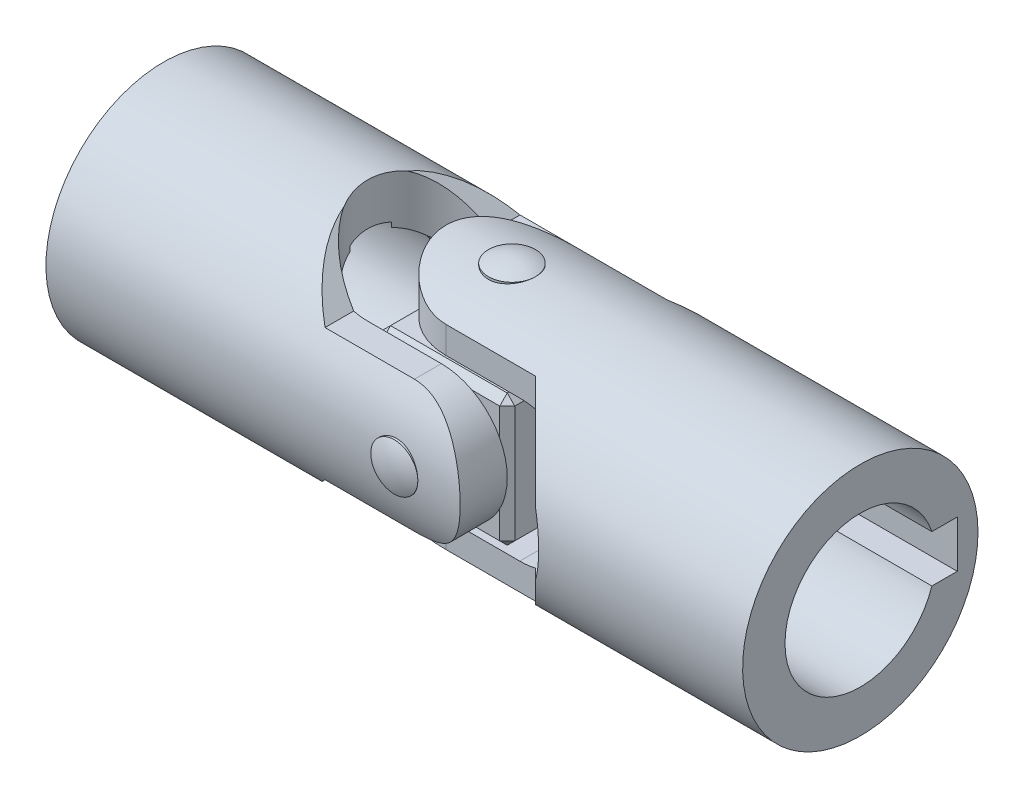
ISO-10303-21;
HEADER;
FILE_DESCRIPTION(('STEP AP214'),'2;1');
FILE_NAME('part.step','',(''),(''),'','','');
FILE_SCHEMA(('AUTOMOTIVE_DESIGN { 1 0 10303 214 1 1 1 1 }'));
ENDSEC;
DATA;
#1=APPLICATION_CONTEXT('core data for automotive mechanical design processes');
#2=APPLICATION_PROTOCOL_DEFINITION('international standard','automotive_design',2000,#1);
#3=PRODUCT_CONTEXT('',#1,'mechanical');
#4=PRODUCT('Part','Part','',(#3));
#5=PRODUCT_RELATED_PRODUCT_CATEGORY('part','',(#4));
#6=PRODUCT_DEFINITION_FORMATION('','',#4);
#7=PRODUCT_DEFINITION_CONTEXT('part definition',#1,'design');
#8=PRODUCT_DEFINITION('design','',#6,#7);
#9=PRODUCT_DEFINITION_SHAPE('','',#8);
#10=(LENGTH_UNIT() NAMED_UNIT(*) SI_UNIT(.MILLI.,.METRE.));
#11=(NAMED_UNIT(*) PLANE_ANGLE_UNIT() SI_UNIT($,.RADIAN.));
#12=(NAMED_UNIT(*) SI_UNIT($,.STERADIAN.) SOLID_ANGLE_UNIT());
#13=UNCERTAINTY_MEASURE_WITH_UNIT(LENGTH_MEASURE(1.E-05),#10,'distance_accuracy_value','');
#14=(GEOMETRIC_REPRESENTATION_CONTEXT(3) GLOBAL_UNCERTAINTY_ASSIGNED_CONTEXT((#13)) GLOBAL_UNIT_ASSIGNED_CONTEXT((#10,
#11,#12)) REPRESENTATION_CONTEXT('',''));
#15=CARTESIAN_POINT('',(0.,0.,0.));
#16=DIRECTION('',(0.,0.,1.));
#17=DIRECTION('',(1.,0.,0.));
#18=AXIS2_PLACEMENT_3D('',#15,#16,#17);
#19=CARTESIAN_POINT('',(0.,12.5,0.));
#20=DIRECTION('',(0.,-1.,0.));
#21=DIRECTION('',(-1.,0.,0.));
#22=AXIS2_PLACEMENT_3D('',#19,#20,#21);
#23=CYLINDRICAL_SURFACE('',#22,2.5);
#24=CARTESIAN_POINT('',(0.,12.5,0.));
#25=DIRECTION('',(0.,1.,0.));
#26=DIRECTION('',(1.,0.,0.));
#27=AXIS2_PLACEMENT_3D('',#24,#25,#26);
#28=CIRCLE('',#27,2.5);
#29=CARTESIAN_POINT('',(2.5,12.5,0.));
#30=VERTEX_POINT('',#29);
#31=EDGE_CURVE('P0_E10',#30,#30,#28,.T.);
#32=ORIENTED_EDGE('',*,*,#31,.F.);
#33=EDGE_LOOP('',(#32));
#34=FACE_BOUND('',#33,.T.);
#35=CARTESIAN_POINT('',(0.,-12.5,0.));
#36=DIRECTION('',(0.,1.,0.));
#37=DIRECTION('',(0.,0.,1.));
#38=AXIS2_PLACEMENT_3D('',#35,#36,#37);
#39=CIRCLE('',#38,2.5);
#40=CARTESIAN_POINT('',(0.,-12.5,2.5));
#41=VERTEX_POINT('',#40);
#42=EDGE_CURVE('P0_E20',#41,#41,#39,.T.);
#43=ORIENTED_EDGE('',*,*,#42,.T.);
#44=EDGE_LOOP('',(#43));
#45=FACE_BOUND('',#44,.T.);
#46=ADVANCED_FACE('P0_F14',(#34,#45),#23,.T.);
#47=CARTESIAN_POINT('',(0.,7.32192120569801,0.));
#48=DIRECTION('',(0.,1.,0.));
#49=DIRECTION('',(0.,0.,-1.));
#50=AXIS2_PLACEMENT_3D('',#47,#48,#49);
#51=SPHERICAL_SURFACE('',#50,5.75);
#52=ORIENTED_EDGE('',*,*,#31,.T.);
#53=EDGE_LOOP('',(#52));
#54=FACE_BOUND('',#53,.T.);
#55=ADVANCED_FACE('P0_F29',(#54),#51,.T.);
#56=CARTESIAN_POINT('',(0.,-7.32192120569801,0.));
#57=DIRECTION('',(0.,-1.,0.));
#58=DIRECTION('',(0.,0.,-1.));
#59=AXIS2_PLACEMENT_3D('',#56,#57,#58);
#60=SPHERICAL_SURFACE('',#59,5.75);
#61=ORIENTED_EDGE('',*,*,#42,.F.);
#62=EDGE_LOOP('',(#61));
#63=FACE_BOUND('',#62,.T.);
#64=ADVANCED_FACE('P0_F27',(#63),#60,.T.);
#65=CLOSED_SHELL('',(#46,#55,#64));
#66=MANIFOLD_SOLID_BREP('P0_B1',#65);
#67=CARTESIAN_POINT('',(0.,0.,12.5));
#68=DIRECTION('',(0.,0.,-1.));
#69=DIRECTION('',(-1.,0.,0.));
#70=AXIS2_PLACEMENT_3D('',#67,#68,#69);
#71=CYLINDRICAL_SURFACE('',#70,2.5);
#72=CARTESIAN_POINT('',(0.,0.,12.5));
#73=DIRECTION('',(0.,0.,1.));
#74=DIRECTION('',(1.,0.,0.));
#75=AXIS2_PLACEMENT_3D('',#72,#73,#74);
#76=CIRCLE('',#75,2.5);
#77=CARTESIAN_POINT('',(2.5,0.,12.5));
#78=VERTEX_POINT('',#77);
#79=EDGE_CURVE('P1_E10',#78,#78,#76,.T.);
#80=ORIENTED_EDGE('',*,*,#79,.F.);
#81=EDGE_LOOP('',(#80));
#82=FACE_BOUND('',#81,.T.);
#83=CARTESIAN_POINT('',(0.,0.,-12.5));
#84=DIRECTION('',(0.,0.,1.));
#85=DIRECTION('',(0.,-1.,0.));
#86=AXIS2_PLACEMENT_3D('',#83,#84,#85);
#87=CIRCLE('',#86,2.5);
#88=CARTESIAN_POINT('',(0.,-2.5,-12.5));
#89=VERTEX_POINT('',#88);
#90=EDGE_CURVE('P1_E20',#89,#89,#87,.T.);
#91=ORIENTED_EDGE('',*,*,#90,.T.);
#92=EDGE_LOOP('',(#91));
#93=FACE_BOUND('',#92,.T.);
#94=ADVANCED_FACE('P1_F14',(#82,#93),#71,.T.);
#95=CARTESIAN_POINT('',(0.,0.,7.32192120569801));
#96=DIRECTION('',(0.,0.,1.));
#97=DIRECTION('',(0.,1.,0.));
#98=AXIS2_PLACEMENT_3D('',#95,#96,#97);
#99=SPHERICAL_SURFACE('',#98,5.75);
#100=ORIENTED_EDGE('',*,*,#79,.T.);
#101=EDGE_LOOP('',(#100));
#102=FACE_BOUND('',#101,.T.);
#103=ADVANCED_FACE('P1_F29',(#102),#99,.T.);
#104=CARTESIAN_POINT('',(0.,0.,-7.32192120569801));
#105=DIRECTION('',(0.,0.,-1.));
#106=DIRECTION('',(0.,1.,0.));
#107=AXIS2_PLACEMENT_3D('',#104,#105,#106);
#108=SPHERICAL_SURFACE('',#107,5.75);
#109=ORIENTED_EDGE('',*,*,#90,.F.);
#110=EDGE_LOOP('',(#109));
#111=FACE_BOUND('',#110,.T.);
#112=ADVANCED_FACE('P1_F27',(#111),#108,.T.);
#113=CLOSED_SHELL('',(#94,#103,#112));
#114=MANIFOLD_SOLID_BREP('P1_B1',#113);
#115=CARTESIAN_POINT('',(0.,0.,7.5));
#116=DIRECTION('',(0.,0.,-1.));
#117=DIRECTION('',(-1.,0.,0.));
#118=AXIS2_PLACEMENT_3D('',#115,#116,#117);
#119=CYLINDRICAL_SURFACE('',#118,2.5);
#120=CARTESIAN_POINT('',(0.,0.,0.));
#121=DIRECTION('',(0.,0.707106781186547,-0.707106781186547));
#122=DIRECTION('',(0.,-0.707106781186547,-0.707106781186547));
#123=AXIS2_PLACEMENT_3D('',#120,#121,#122);
#124=ELLIPSE('',#123,3.53553390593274,2.5);
#125=CARTESIAN_POINT('',(2.5,0.,0.));
#126=VERTEX_POINT('',#125);
#127=CARTESIAN_POINT('',(-2.5,0.,0.));
#128=VERTEX_POINT('',#127);
#129=EDGE_CURVE('P2_E116',#126,#128,#124,.F.);
#130=ORIENTED_EDGE('',*,*,#129,.F.);
#131=CARTESIAN_POINT('',(0.,0.,0.));
#132=DIRECTION('',(0.,-0.707106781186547,-0.707106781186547));
#133=DIRECTION('',(0.,0.707106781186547,-0.707106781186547));
#134=AXIS2_PLACEMENT_3D('',#131,#132,#133);
#135=ELLIPSE('',#134,3.53553390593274,2.5);
#136=EDGE_CURVE('P2_E120',#128,#126,#135,.F.);
#137=ORIENTED_EDGE('',*,*,#136,.F.);
#138=EDGE_LOOP('',(#130,#137));
#139=FACE_BOUND('',#138,.T.);
#140=CARTESIAN_POINT('',(0.,0.,7.5));
#141=DIRECTION('',(0.,0.,1.));
#142=DIRECTION('',(1.,0.,0.));
#143=AXIS2_PLACEMENT_3D('',#140,#141,#142);
#144=CIRCLE('',#143,2.5);
#145=CARTESIAN_POINT('',(2.5,0.,7.5));
#146=VERTEX_POINT('',#145);
#147=EDGE_CURVE('P2_E127',#146,#146,#144,.T.);
#148=ORIENTED_EDGE('',*,*,#147,.T.);
#149=EDGE_LOOP('',(#148));
#150=FACE_BOUND('',#149,.T.);
#151=ADVANCED_FACE('P2_F16',(#139,#150),#119,.F.);
#152=CARTESIAN_POINT('',(7.,7.,7.5));
#153=DIRECTION('',(0.,0.,1.));
#154=DIRECTION('',(1.,0.,0.));
#155=AXIS2_PLACEMENT_3D('',#152,#153,#154);
#156=PLANE('',#155);
#157=DIRECTION('',(0.,-1.,0.));
#158=VECTOR('',#157,1.);
#159=CARTESIAN_POINT('',(-6.2,-7.,7.5));
#160=LINE('',#159,#158);
#161=CARTESIAN_POINT('',(-6.2,6.2,7.5));
#162=VERTEX_POINT('',#161);
#163=CARTESIAN_POINT('',(-6.2,-6.2,7.5));
#164=VERTEX_POINT('',#163);
#165=EDGE_CURVE('P2_E164',#162,#164,#160,.T.);
#166=ORIENTED_EDGE('',*,*,#165,.T.);
#167=DIRECTION('',(1.,0.,0.));
#168=VECTOR('',#167,1.);
#169=CARTESIAN_POINT('',(7.,-6.2,7.5));
#170=LINE('',#169,#168);
#171=CARTESIAN_POINT('',(6.2,-6.2,7.5));
#172=VERTEX_POINT('',#171);
#173=EDGE_CURVE('P2_E168',#164,#172,#170,.T.);
#174=ORIENTED_EDGE('',*,*,#173,.T.);
#175=DIRECTION('',(0.,1.,0.));
#176=VECTOR('',#175,1.);
#177=CARTESIAN_POINT('',(6.2,7.,7.5));
#178=LINE('',#177,#176);
#179=CARTESIAN_POINT('',(6.2,6.2,7.5));
#180=VERTEX_POINT('',#179);
#181=EDGE_CURVE('P2_E166',#172,#180,#178,.T.);
#182=ORIENTED_EDGE('',*,*,#181,.T.);
#183=DIRECTION('',(-1.,0.,0.));
#184=VECTOR('',#183,1.);
#185=CARTESIAN_POINT('',(-7.,6.2,7.5));
#186=LINE('',#185,#184);
#187=EDGE_CURVE('P2_E162',#180,#162,#186,.T.);
#188=ORIENTED_EDGE('',*,*,#187,.T.);
#189=EDGE_LOOP('',(#166,#174,#182,#188));
#190=FACE_BOUND('',#189,.T.);
#191=ORIENTED_EDGE('',*,*,#147,.F.);
#192=EDGE_LOOP('',(#191));
#193=FACE_BOUND('',#192,.T.);
#194=ADVANCED_FACE('P2_F282',(#190,#193),#156,.T.);
#195=CARTESIAN_POINT('',(7.,7.,-7.5));
#196=DIRECTION('',(0.,0.,1.));
#197=DIRECTION('',(1.,0.,0.));
#198=AXIS2_PLACEMENT_3D('',#195,#196,#197);
#199=PLANE('',#198);
#200=DIRECTION('',(-1.,0.,0.));
#201=VECTOR('',#200,1.);
#202=CARTESIAN_POINT('',(7.,-6.2,-7.5));
#203=LINE('',#202,#201);
#204=CARTESIAN_POINT('',(6.2,-6.2,-7.5));
#205=VERTEX_POINT('',#204);
#206=CARTESIAN_POINT('',(-6.2,-6.2,-7.5));
#207=VERTEX_POINT('',#206);
#208=EDGE_CURVE('P2_E157',#205,#207,#203,.T.);
#209=ORIENTED_EDGE('',*,*,#208,.T.);
#210=DIRECTION('',(0.,1.,0.));
#211=VECTOR('',#210,1.);
#212=CARTESIAN_POINT('',(-6.2,7.,-7.5));
#213=LINE('',#212,#211);
#214=CARTESIAN_POINT('',(-6.2,6.2,-7.5));
#215=VERTEX_POINT('',#214);
#216=EDGE_CURVE('P2_E159',#207,#215,#213,.T.);
#217=ORIENTED_EDGE('',*,*,#216,.T.);
#218=DIRECTION('',(1.,0.,0.));
#219=VECTOR('',#218,1.);
#220=CARTESIAN_POINT('',(7.,6.2,-7.5));
#221=LINE('',#220,#219);
#222=CARTESIAN_POINT('',(6.2,6.2,-7.5));
#223=VERTEX_POINT('',#222);
#224=EDGE_CURVE('P2_E153',#215,#223,#221,.T.);
#225=ORIENTED_EDGE('',*,*,#224,.T.);
#226=DIRECTION('',(0.,-1.,0.));
#227=VECTOR('',#226,1.);
#228=CARTESIAN_POINT('',(6.2,7.,-7.5));
#229=LINE('',#228,#227);
#230=EDGE_CURVE('P2_E155',#223,#205,#229,.T.);
#231=ORIENTED_EDGE('',*,*,#230,.T.);
#232=EDGE_LOOP('',(#209,#217,#225,#231));
#233=FACE_BOUND('',#232,.T.);
#234=CARTESIAN_POINT('',(0.,0.,-7.5));
#235=DIRECTION('',(0.,0.,1.));
#236=DIRECTION('',(1.,0.,0.));
#237=AXIS2_PLACEMENT_3D('',#234,#235,#236);
#238=CIRCLE('',#237,2.5);
#239=CARTESIAN_POINT('',(2.5,0.,-7.5));
#240=VERTEX_POINT('',#239);
#241=EDGE_CURVE('P2_E259',#240,#240,#238,.T.);
#242=ORIENTED_EDGE('',*,*,#241,.T.);
#243=EDGE_LOOP('',(#242));
#244=FACE_BOUND('',#243,.T.);
#245=ADVANCED_FACE('P2_F267',(#233,#244),#199,.F.);
#246=CARTESIAN_POINT('',(-7.,7.,7.5));
#247=DIRECTION('',(0.,-1.,0.));
#248=DIRECTION('',(0.,0.,-1.));
#249=AXIS2_PLACEMENT_3D('',#246,#247,#248);
#250=PLANE('',#249);
#251=DIRECTION('',(-1.,0.,0.));
#252=VECTOR('',#251,1.);
#253=CARTESIAN_POINT('',(-7.,7.,-6.7));
#254=LINE('',#253,#252);
#255=CARTESIAN_POINT('',(6.2,7.,-6.7));
#256=VERTEX_POINT('',#255);
#257=CARTESIAN_POINT('',(-6.2,7.,-6.7));
#258=VERTEX_POINT('',#257);
#259=EDGE_CURVE('P2_E25',#256,#258,#254,.T.);
#260=ORIENTED_EDGE('',*,*,#259,.T.);
#261=DIRECTION('',(0.,0.,1.));
#262=VECTOR('',#261,1.);
#263=CARTESIAN_POINT('',(-6.2,7.,7.5));
#264=LINE('',#263,#262);
#265=CARTESIAN_POINT('',(-6.2,7.,6.7));
#266=VERTEX_POINT('',#265);
#267=EDGE_CURVE('P2_E11',#258,#266,#264,.T.);
#268=ORIENTED_EDGE('',*,*,#267,.T.);
#269=DIRECTION('',(1.,0.,0.));
#270=VECTOR('',#269,1.);
#271=CARTESIAN_POINT('',(7.,7.,6.7));
#272=LINE('',#271,#270);
#273=CARTESIAN_POINT('',(6.2,7.,6.7));
#274=VERTEX_POINT('',#273);
#275=EDGE_CURVE('P2_E180',#266,#274,#272,.T.);
#276=ORIENTED_EDGE('',*,*,#275,.T.);
#277=DIRECTION('',(0.,0.,-1.));
#278=VECTOR('',#277,1.);
#279=CARTESIAN_POINT('',(6.2,7.,7.5));
#280=LINE('',#279,#278);
#281=EDGE_CURVE('P2_E36',#274,#256,#280,.T.);
#282=ORIENTED_EDGE('',*,*,#281,.T.);
#283=EDGE_LOOP('',(#260,#268,#276,#282));
#284=FACE_BOUND('',#283,.T.);
#285=CARTESIAN_POINT('',(0.,7.,0.));
#286=DIRECTION('',(0.,1.,0.));
#287=DIRECTION('',(0.,0.,1.));
#288=AXIS2_PLACEMENT_3D('',#285,#286,#287);
#289=CIRCLE('',#288,2.5);
#290=CARTESIAN_POINT('',(0.,7.,2.5));
#291=VERTEX_POINT('',#290);
#292=EDGE_CURVE('P2_E249',#291,#291,#289,.T.);
#293=ORIENTED_EDGE('',*,*,#292,.F.);
#294=EDGE_LOOP('',(#293));
#295=FACE_BOUND('',#294,.T.);
#296=ADVANCED_FACE('P2_F290',(#284,#295),#250,.F.);
#297=CARTESIAN_POINT('',(-7.,-7.,7.5));
#298=DIRECTION('',(1.,0.,0.));
#299=DIRECTION('',(0.,0.,-1.));
#300=AXIS2_PLACEMENT_3D('',#297,#298,#299);
#301=PLANE('',#300);
#302=DIRECTION('',(0.,-1.,0.));
#303=VECTOR('',#302,1.);
#304=CARTESIAN_POINT('',(-7.,-7.,-6.7));
#305=LINE('',#304,#303);
#306=CARTESIAN_POINT('',(-7.,6.2,-6.7));
#307=VERTEX_POINT('',#306);
#308=CARTESIAN_POINT('',(-7.,-6.2,-6.7));
#309=VERTEX_POINT('',#308);
#310=EDGE_CURVE('P2_E148',#307,#309,#305,.T.);
#311=ORIENTED_EDGE('',*,*,#310,.T.);
#312=DIRECTION('',(0.,0.,1.));
#313=VECTOR('',#312,1.);
#314=CARTESIAN_POINT('',(-7.,-6.2,7.5));
#315=LINE('',#314,#313);
#316=CARTESIAN_POINT('',(-7.,-6.2,6.7));
#317=VERTEX_POINT('',#316);
#318=EDGE_CURVE('P2_E150',#309,#317,#315,.T.);
#319=ORIENTED_EDGE('',*,*,#318,.T.);
#320=DIRECTION('',(0.,1.,0.));
#321=VECTOR('',#320,1.);
#322=CARTESIAN_POINT('',(-7.,7.,6.7));
#323=LINE('',#322,#321);
#324=CARTESIAN_POINT('',(-7.,6.2,6.7));
#325=VERTEX_POINT('',#324);
#326=EDGE_CURVE('P2_E146',#317,#325,#323,.T.);
#327=ORIENTED_EDGE('',*,*,#326,.T.);
#328=DIRECTION('',(0.,0.,-1.));
#329=VECTOR('',#328,1.);
#330=CARTESIAN_POINT('',(-7.,6.2,7.5));
#331=LINE('',#330,#329);
#332=EDGE_CURVE('P2_E144',#325,#307,#331,.T.);
#333=ORIENTED_EDGE('',*,*,#332,.T.);
#334=EDGE_LOOP('',(#311,#319,#327,#333));
#335=FACE_BOUND('',#334,.T.);
#336=ADVANCED_FACE('P2_F297',(#335),#301,.F.);
#337=CARTESIAN_POINT('',(-7.,-7.,7.5));
#338=DIRECTION('',(0.,1.,0.));
#339=DIRECTION('',(0.,0.,1.));
#340=AXIS2_PLACEMENT_3D('',#337,#338,#339);
#341=PLANE('',#340);
#342=DIRECTION('',(-1.,0.,0.));
#343=VECTOR('',#342,1.);
#344=CARTESIAN_POINT('',(-7.,-7.,6.7));
#345=LINE('',#344,#343);
#346=CARTESIAN_POINT('',(6.2,-7.,6.7));
#347=VERTEX_POINT('',#346);
#348=CARTESIAN_POINT('',(-6.2,-7.,6.7));
#349=VERTEX_POINT('',#348);
#350=EDGE_CURVE('P2_E137',#347,#349,#345,.T.);
#351=ORIENTED_EDGE('',*,*,#350,.T.);
#352=DIRECTION('',(0.,0.,-1.));
#353=VECTOR('',#352,1.);
#354=CARTESIAN_POINT('',(-6.2,-7.,7.5));
#355=LINE('',#354,#353);
#356=CARTESIAN_POINT('',(-6.2,-7.,-6.7));
#357=VERTEX_POINT('',#356);
#358=EDGE_CURVE('P2_E141',#349,#357,#355,.T.);
#359=ORIENTED_EDGE('',*,*,#358,.T.);
#360=DIRECTION('',(1.,0.,0.));
#361=VECTOR('',#360,1.);
#362=CARTESIAN_POINT('',(-7.,-7.,-6.7));
#363=LINE('',#362,#361);
#364=CARTESIAN_POINT('',(6.2,-7.,-6.7));
#365=VERTEX_POINT('',#364);
#366=EDGE_CURVE('P2_E139',#357,#365,#363,.T.);
#367=ORIENTED_EDGE('',*,*,#366,.T.);
#368=DIRECTION('',(0.,0.,1.));
#369=VECTOR('',#368,1.);
#370=CARTESIAN_POINT('',(6.2,-7.,7.5));
#371=LINE('',#370,#369);
#372=EDGE_CURVE('P2_E130',#365,#347,#371,.T.);
#373=ORIENTED_EDGE('',*,*,#372,.T.);
#374=EDGE_LOOP('',(#351,#359,#367,#373));
#375=FACE_BOUND('',#374,.T.);
#376=CARTESIAN_POINT('',(0.,-7.,0.));
#377=DIRECTION('',(0.,1.,0.));
#378=DIRECTION('',(0.,0.,1.));
#379=AXIS2_PLACEMENT_3D('',#376,#377,#378);
#380=CIRCLE('',#379,2.5);
#381=CARTESIAN_POINT('',(0.,-7.,2.5));
#382=VERTEX_POINT('',#381);
#383=EDGE_CURVE('P2_E255',#382,#382,#380,.T.);
#384=ORIENTED_EDGE('',*,*,#383,.T.);
#385=EDGE_LOOP('',(#384));
#386=FACE_BOUND('',#385,.T.);
#387=ADVANCED_FACE('P2_F277',(#375,#386),#341,.F.);
#388=CARTESIAN_POINT('',(7.,-7.,7.5));
#389=DIRECTION('',(-1.,0.,0.));
#390=DIRECTION('',(0.,0.,1.));
#391=AXIS2_PLACEMENT_3D('',#388,#389,#390);
#392=PLANE('',#391);
#393=DIRECTION('',(0.,-1.,0.));
#394=VECTOR('',#393,1.);
#395=CARTESIAN_POINT('',(7.,-7.,6.7));
#396=LINE('',#395,#394);
#397=CARTESIAN_POINT('',(7.,6.2,6.7));
#398=VERTEX_POINT('',#397);
#399=CARTESIAN_POINT('',(7.,-6.2,6.7));
#400=VERTEX_POINT('',#399);
#401=EDGE_CURVE('P2_E173',#398,#400,#396,.T.);
#402=ORIENTED_EDGE('',*,*,#401,.T.);
#403=DIRECTION('',(0.,0.,-1.));
#404=VECTOR('',#403,1.);
#405=CARTESIAN_POINT('',(7.,-6.2,7.5));
#406=LINE('',#405,#404);
#407=CARTESIAN_POINT('',(7.,-6.2,-6.7));
#408=VERTEX_POINT('',#407);
#409=EDGE_CURVE('P2_E177',#400,#408,#406,.T.);
#410=ORIENTED_EDGE('',*,*,#409,.T.);
#411=DIRECTION('',(0.,1.,0.));
#412=VECTOR('',#411,1.);
#413=CARTESIAN_POINT('',(7.,-7.,-6.7));
#414=LINE('',#413,#412);
#415=CARTESIAN_POINT('',(7.,6.2,-6.7));
#416=VERTEX_POINT('',#415);
#417=EDGE_CURVE('P2_E175',#408,#416,#414,.T.);
#418=ORIENTED_EDGE('',*,*,#417,.T.);
#419=DIRECTION('',(0.,0.,1.));
#420=VECTOR('',#419,1.);
#421=CARTESIAN_POINT('',(7.,6.2,7.5));
#422=LINE('',#421,#420);
#423=EDGE_CURVE('P2_E171',#416,#398,#422,.T.);
#424=ORIENTED_EDGE('',*,*,#423,.T.);
#425=EDGE_LOOP('',(#402,#410,#418,#424));
#426=FACE_BOUND('',#425,.T.);
#427=ADVANCED_FACE('P2_F269',(#426),#392,.F.);
#428=CARTESIAN_POINT('',(0.,0.,0.));
#429=DIRECTION('',(0.,0.707106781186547,-0.707106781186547));
#430=DIRECTION('',(0.,-0.707106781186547,-0.707106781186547));
#431=AXIS2_PLACEMENT_3D('',#428,#429,#430);
#432=ELLIPSE('',#431,3.53553390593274,2.5);
#433=EDGE_CURVE('P2_E119',#126,#128,#432,.T.);
#434=ORIENTED_EDGE('',*,*,#433,.F.);
#435=CARTESIAN_POINT('',(0.,0.,0.));
#436=DIRECTION('',(0.,-0.707106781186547,-0.707106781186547));
#437=DIRECTION('',(0.,0.707106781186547,-0.707106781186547));
#438=AXIS2_PLACEMENT_3D('',#435,#436,#437);
#439=ELLIPSE('',#438,3.53553390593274,2.5);
#440=EDGE_CURVE('P2_E111',#128,#126,#439,.T.);
#441=ORIENTED_EDGE('',*,*,#440,.F.);
#442=EDGE_LOOP('',(#434,#441));
#443=FACE_BOUND('',#442,.T.);
#444=ORIENTED_EDGE('',*,*,#241,.F.);
#445=EDGE_LOOP('',(#444));
#446=FACE_BOUND('',#445,.T.);
#447=ADVANCED_FACE('P2_F132',(#443,#446),#119,.F.);
#448=CARTESIAN_POINT('',(0.,-7.,0.));
#449=DIRECTION('',(0.,1.,0.));
#450=DIRECTION('',(0.,0.,1.));
#451=AXIS2_PLACEMENT_3D('',#448,#449,#450);
#452=CYLINDRICAL_SURFACE('',#451,2.5);
#453=ORIENTED_EDGE('',*,*,#433,.T.);
#454=ORIENTED_EDGE('',*,*,#136,.T.);
#455=EDGE_LOOP('',(#453,#454));
#456=FACE_BOUND('',#455,.T.);
#457=ORIENTED_EDGE('',*,*,#383,.F.);
#458=EDGE_LOOP('',(#457));
#459=FACE_BOUND('',#458,.T.);
#460=ADVANCED_FACE('P2_F124',(#456,#459),#452,.F.);
#461=ORIENTED_EDGE('',*,*,#129,.T.);
#462=ORIENTED_EDGE('',*,*,#440,.T.);
#463=EDGE_LOOP('',(#461,#462));
#464=FACE_BOUND('',#463,.T.);
#465=ORIENTED_EDGE('',*,*,#292,.T.);
#466=EDGE_LOOP('',(#465));
#467=FACE_BOUND('',#466,.T.);
#468=ADVANCED_FACE('P2_F113',(#464,#467),#452,.F.);
#469=CARTESIAN_POINT('',(6.2,7.,7.5));
#470=DIRECTION('',(-0.707106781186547,-0.707106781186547,0.));
#471=DIRECTION('',(0.707106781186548,-0.707106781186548,0.));
#472=AXIS2_PLACEMENT_3D('',#469,#470,#471);
#473=PLANE('',#472);
#474=DIRECTION('',(0.707106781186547,-0.707106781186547,0.));
#475=VECTOR('',#474,1.);
#476=CARTESIAN_POINT('',(6.6,6.6,6.7));
#477=LINE('',#476,#475);
#478=EDGE_CURVE('P2_E20',#398,#274,#477,.F.);
#479=ORIENTED_EDGE('',*,*,#478,.F.);
#480=ORIENTED_EDGE('',*,*,#423,.F.);
#481=DIRECTION('',(-0.707106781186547,0.707106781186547,0.));
#482=VECTOR('',#481,1.);
#483=CARTESIAN_POINT('',(7.,6.2,-6.7));
#484=LINE('',#483,#482);
#485=EDGE_CURVE('P2_E243',#256,#416,#484,.F.);
#486=ORIENTED_EDGE('',*,*,#485,.F.);
#487=ORIENTED_EDGE('',*,*,#281,.F.);
#488=EDGE_LOOP('',(#479,#480,#486,#487));
#489=FACE_BOUND('',#488,.T.);
#490=ADVANCED_FACE('P2_F18',(#489),#473,.F.);
#491=CARTESIAN_POINT('',(6.2,6.2,7.5));
#492=DIRECTION('',(0.577350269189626,0.577350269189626,0.577350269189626));
#493=DIRECTION('',(0.707106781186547,0.,-0.707106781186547));
#494=AXIS2_PLACEMENT_3D('',#491,#492,#493);
#495=PLANE('',#494);
#496=DIRECTION('',(0.707106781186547,0.,-0.707106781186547));
#497=VECTOR('',#496,1.);
#498=CARTESIAN_POINT('',(6.2,6.2,7.5));
#499=LINE('',#498,#497);
#500=EDGE_CURVE('P2_E238',#398,#180,#499,.F.);
#501=ORIENTED_EDGE('',*,*,#500,.F.);
#502=ORIENTED_EDGE('',*,*,#478,.T.);
#503=DIRECTION('',(0.,-0.707106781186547,0.707106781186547));
#504=VECTOR('',#503,1.);
#505=CARTESIAN_POINT('',(6.2,6.2,7.5));
#506=LINE('',#505,#504);
#507=EDGE_CURVE('P2_E241',#180,#274,#506,.F.);
#508=ORIENTED_EDGE('',*,*,#507,.F.);
#509=EDGE_LOOP('',(#501,#502,#508));
#510=FACE_BOUND('',#509,.T.);
#511=ADVANCED_FACE('P2_F374',(#510),#495,.T.);
#512=CARTESIAN_POINT('',(7.,6.2,-6.7));
#513=DIRECTION('',(0.577350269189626,0.577350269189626,-0.577350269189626));
#514=DIRECTION('',(-0.707106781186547,0.,-0.707106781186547));
#515=AXIS2_PLACEMENT_3D('',#512,#513,#514);
#516=PLANE('',#515);
#517=DIRECTION('',(0.,-0.707106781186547,-0.707106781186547));
#518=VECTOR('',#517,1.);
#519=CARTESIAN_POINT('',(6.2,6.6,-7.1));
#520=LINE('',#519,#518);
#521=EDGE_CURVE('P2_E232',#256,#223,#520,.T.);
#522=ORIENTED_EDGE('',*,*,#521,.F.);
#523=ORIENTED_EDGE('',*,*,#485,.T.);
#524=DIRECTION('',(0.707106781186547,0.,0.707106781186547));
#525=VECTOR('',#524,1.);
#526=CARTESIAN_POINT('',(7.,6.2,-6.7));
#527=LINE('',#526,#525);
#528=EDGE_CURVE('P2_E235',#223,#416,#527,.T.);
#529=ORIENTED_EDGE('',*,*,#528,.F.);
#530=EDGE_LOOP('',(#522,#523,#529));
#531=FACE_BOUND('',#530,.T.);
#532=ADVANCED_FACE('P2_F371',(#531),#516,.T.);
#533=CARTESIAN_POINT('',(7.,6.2,7.5));
#534=DIRECTION('',(0.,0.707106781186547,0.707106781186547));
#535=DIRECTION('',(0.,-0.707106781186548,0.707106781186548));
#536=AXIS2_PLACEMENT_3D('',#533,#534,#535);
#537=PLANE('',#536);
#538=ORIENTED_EDGE('',*,*,#507,.T.);
#539=ORIENTED_EDGE('',*,*,#275,.F.);
#540=DIRECTION('',(0.,0.707106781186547,-0.707106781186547));
#541=VECTOR('',#540,1.);
#542=CARTESIAN_POINT('',(-6.2,6.6,7.1));
#543=LINE('',#542,#541);
#544=EDGE_CURVE('P2_E227',#162,#266,#543,.T.);
#545=ORIENTED_EDGE('',*,*,#544,.F.);
#546=ORIENTED_EDGE('',*,*,#187,.F.);
#547=EDGE_LOOP('',(#538,#539,#545,#546));
#548=FACE_BOUND('',#547,.T.);
#549=ADVANCED_FACE('P2_F367',(#548),#537,.T.);
#550=CARTESIAN_POINT('',(6.2,7.,7.5));
#551=DIRECTION('',(0.707106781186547,0.,0.707106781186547));
#552=DIRECTION('',(0.707106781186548,0.,-0.707106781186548));
#553=AXIS2_PLACEMENT_3D('',#550,#551,#552);
#554=PLANE('',#553);
#555=ORIENTED_EDGE('',*,*,#500,.T.);
#556=ORIENTED_EDGE('',*,*,#181,.F.);
#557=DIRECTION('',(-0.707106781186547,0.,0.707106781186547));
#558=VECTOR('',#557,1.);
#559=CARTESIAN_POINT('',(6.2,-6.2,7.5));
#560=LINE('',#559,#558);
#561=EDGE_CURVE('P2_E224',#400,#172,#560,.T.);
#562=ORIENTED_EDGE('',*,*,#561,.F.);
#563=ORIENTED_EDGE('',*,*,#401,.F.);
#564=EDGE_LOOP('',(#555,#556,#562,#563));
#565=FACE_BOUND('',#564,.T.);
#566=ADVANCED_FACE('P2_F363',(#565),#554,.T.);
#567=CARTESIAN_POINT('',(7.,-6.2,7.5));
#568=DIRECTION('',(-0.707106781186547,0.707106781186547,0.));
#569=DIRECTION('',(-0.707106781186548,-0.707106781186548,0.));
#570=AXIS2_PLACEMENT_3D('',#567,#568,#569);
#571=PLANE('',#570);
#572=DIRECTION('',(0.707106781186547,0.707106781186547,0.));
#573=VECTOR('',#572,1.);
#574=CARTESIAN_POINT('',(6.2,-7.,-6.7));
#575=LINE('',#574,#573);
#576=EDGE_CURVE('P2_E218',#408,#365,#575,.F.);
#577=ORIENTED_EDGE('',*,*,#576,.F.);
#578=ORIENTED_EDGE('',*,*,#409,.F.);
#579=DIRECTION('',(-0.707106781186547,-0.707106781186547,0.));
#580=VECTOR('',#579,1.);
#581=CARTESIAN_POINT('',(6.6,-6.6,6.7));
#582=LINE('',#581,#580);
#583=EDGE_CURVE('P2_E221',#347,#400,#582,.F.);
#584=ORIENTED_EDGE('',*,*,#583,.F.);
#585=ORIENTED_EDGE('',*,*,#372,.F.);
#586=EDGE_LOOP('',(#577,#578,#584,#585));
#587=FACE_BOUND('',#586,.T.);
#588=ADVANCED_FACE('P2_F359',(#587),#571,.F.);
#589=CARTESIAN_POINT('',(7.,-7.,-6.7));
#590=DIRECTION('',(-0.707106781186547,0.,0.707106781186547));
#591=DIRECTION('',(0.707106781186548,0.,0.707106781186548));
#592=AXIS2_PLACEMENT_3D('',#589,#590,#591);
#593=PLANE('',#592);
#594=ORIENTED_EDGE('',*,*,#528,.T.);
#595=ORIENTED_EDGE('',*,*,#417,.F.);
#596=DIRECTION('',(-0.707106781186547,0.,-0.707106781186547));
#597=VECTOR('',#596,1.);
#598=CARTESIAN_POINT('',(6.6,-6.2,-7.1));
#599=LINE('',#598,#597);
#600=EDGE_CURVE('P2_E216',#205,#408,#599,.F.);
#601=ORIENTED_EDGE('',*,*,#600,.F.);
#602=ORIENTED_EDGE('',*,*,#230,.F.);
#603=EDGE_LOOP('',(#594,#595,#601,#602));
#604=FACE_BOUND('',#603,.T.);
#605=ADVANCED_FACE('P2_F355',(#604),#593,.F.);
#606=CARTESIAN_POINT('',(-7.,7.,-6.7));
#607=DIRECTION('',(0.,-0.707106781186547,0.707106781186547));
#608=DIRECTION('',(0.,-0.707106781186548,-0.707106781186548));
#609=AXIS2_PLACEMENT_3D('',#606,#607,#608);
#610=PLANE('',#609);
#611=ORIENTED_EDGE('',*,*,#521,.T.);
#612=ORIENTED_EDGE('',*,*,#224,.F.);
#613=DIRECTION('',(0.,0.707106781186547,0.707106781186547));
#614=VECTOR('',#613,1.);
#615=CARTESIAN_POINT('',(-6.2,6.2,-7.5));
#616=LINE('',#615,#614);
#617=EDGE_CURVE('P2_E213',#258,#215,#616,.F.);
#618=ORIENTED_EDGE('',*,*,#617,.F.);
#619=ORIENTED_EDGE('',*,*,#259,.F.);
#620=EDGE_LOOP('',(#611,#612,#618,#619));
#621=FACE_BOUND('',#620,.T.);
#622=ADVANCED_FACE('P2_F351',(#621),#610,.F.);
#623=CARTESIAN_POINT('',(-7.,6.2,7.5));
#624=DIRECTION('',(0.707106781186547,-0.707106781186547,0.));
#625=DIRECTION('',(0.707106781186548,0.707106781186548,0.));
#626=AXIS2_PLACEMENT_3D('',#623,#624,#625);
#627=PLANE('',#626);
#628=DIRECTION('',(0.707106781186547,0.707106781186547,0.));
#629=VECTOR('',#628,1.);
#630=CARTESIAN_POINT('',(-7.,6.2,6.7));
#631=LINE('',#630,#629);
#632=EDGE_CURVE('P2_E229',#266,#325,#631,.F.);
#633=ORIENTED_EDGE('',*,*,#632,.F.);
#634=ORIENTED_EDGE('',*,*,#267,.F.);
#635=DIRECTION('',(-0.707106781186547,-0.707106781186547,0.));
#636=VECTOR('',#635,1.);
#637=CARTESIAN_POINT('',(-6.6,6.6,-6.7));
#638=LINE('',#637,#636);
#639=EDGE_CURVE('P2_E210',#307,#258,#638,.F.);
#640=ORIENTED_EDGE('',*,*,#639,.F.);
#641=ORIENTED_EDGE('',*,*,#332,.F.);
#642=EDGE_LOOP('',(#633,#634,#640,#641));
#643=FACE_BOUND('',#642,.T.);
#644=ADVANCED_FACE('P2_F347',(#643),#627,.F.);
#645=CARTESIAN_POINT('',(-7.,6.2,6.7));
#646=DIRECTION('',(-0.577350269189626,0.577350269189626,0.577350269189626));
#647=DIRECTION('',(0.707106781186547,0.,0.707106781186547));
#648=AXIS2_PLACEMENT_3D('',#645,#646,#647);
#649=PLANE('',#648);
#650=ORIENTED_EDGE('',*,*,#544,.T.);
#651=ORIENTED_EDGE('',*,*,#632,.T.);
#652=DIRECTION('',(0.707106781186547,0.,0.707106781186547));
#653=VECTOR('',#652,1.);
#654=CARTESIAN_POINT('',(-7.,6.2,6.7));
#655=LINE('',#654,#653);
#656=EDGE_CURVE('P2_E207',#162,#325,#655,.F.);
#657=ORIENTED_EDGE('',*,*,#656,.F.);
#658=EDGE_LOOP('',(#650,#651,#657));
#659=FACE_BOUND('',#658,.T.);
#660=ADVANCED_FACE('P2_F343',(#659),#649,.T.);
#661=CARTESIAN_POINT('',(6.2,-6.2,7.5));
#662=DIRECTION('',(0.577350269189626,-0.577350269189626,0.577350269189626));
#663=DIRECTION('',(0.707106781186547,0.,-0.707106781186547));
#664=AXIS2_PLACEMENT_3D('',#661,#662,#663);
#665=PLANE('',#664);
#666=ORIENTED_EDGE('',*,*,#583,.T.);
#667=ORIENTED_EDGE('',*,*,#561,.T.);
#668=DIRECTION('',(0.,-0.707106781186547,-0.707106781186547));
#669=VECTOR('',#668,1.);
#670=CARTESIAN_POINT('',(6.2,-6.2,7.5));
#671=LINE('',#670,#669);
#672=EDGE_CURVE('P2_E205',#347,#172,#671,.F.);
#673=ORIENTED_EDGE('',*,*,#672,.F.);
#674=EDGE_LOOP('',(#666,#667,#673));
#675=FACE_BOUND('',#674,.T.);
#676=ADVANCED_FACE('P2_F339',(#675),#665,.T.);
#677=CARTESIAN_POINT('',(6.2,-7.,-6.7));
#678=DIRECTION('',(0.577350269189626,-0.577350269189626,-0.577350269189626));
#679=DIRECTION('',(-0.707106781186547,0.,-0.707106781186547));
#680=AXIS2_PLACEMENT_3D('',#677,#678,#679);
#681=PLANE('',#680);
#682=ORIENTED_EDGE('',*,*,#600,.T.);
#683=ORIENTED_EDGE('',*,*,#576,.T.);
#684=DIRECTION('',(0.,-0.707106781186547,0.707106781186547));
#685=VECTOR('',#684,1.);
#686=CARTESIAN_POINT('',(6.2,-7.,-6.7));
#687=LINE('',#686,#685);
#688=EDGE_CURVE('P2_E202',#205,#365,#687,.T.);
#689=ORIENTED_EDGE('',*,*,#688,.F.);
#690=EDGE_LOOP('',(#682,#683,#689));
#691=FACE_BOUND('',#690,.T.);
#692=ADVANCED_FACE('P2_F335',(#691),#681,.T.);
#693=CARTESIAN_POINT('',(-6.2,6.2,-7.5));
#694=DIRECTION('',(-0.577350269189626,0.577350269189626,-0.577350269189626));
#695=DIRECTION('',(-0.707106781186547,0.,0.707106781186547));
#696=AXIS2_PLACEMENT_3D('',#693,#694,#695);
#697=PLANE('',#696);
#698=ORIENTED_EDGE('',*,*,#639,.T.);
#699=ORIENTED_EDGE('',*,*,#617,.T.);
#700=DIRECTION('',(0.707106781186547,0.,-0.707106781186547));
#701=VECTOR('',#700,1.);
#702=CARTESIAN_POINT('',(-6.2,6.2,-7.5));
#703=LINE('',#702,#701);
#704=EDGE_CURVE('P2_E200',#307,#215,#703,.T.);
#705=ORIENTED_EDGE('',*,*,#704,.F.);
#706=EDGE_LOOP('',(#698,#699,#705));
#707=FACE_BOUND('',#706,.T.);
#708=ADVANCED_FACE('P2_F331',(#707),#697,.T.);
#709=CARTESIAN_POINT('',(-6.2,7.,7.5));
#710=DIRECTION('',(-0.707106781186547,0.,0.707106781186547));
#711=DIRECTION('',(0.707106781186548,0.,0.707106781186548));
#712=AXIS2_PLACEMENT_3D('',#709,#710,#711);
#713=PLANE('',#712);
#714=ORIENTED_EDGE('',*,*,#656,.T.);
#715=ORIENTED_EDGE('',*,*,#326,.F.);
#716=DIRECTION('',(-0.707106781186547,0.,-0.707106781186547));
#717=VECTOR('',#716,1.);
#718=CARTESIAN_POINT('',(-7.,-6.2,6.7));
#719=LINE('',#718,#717);
#720=EDGE_CURVE('P2_E197',#164,#317,#719,.T.);
#721=ORIENTED_EDGE('',*,*,#720,.F.);
#722=ORIENTED_EDGE('',*,*,#165,.F.);
#723=EDGE_LOOP('',(#714,#715,#721,#722));
#724=FACE_BOUND('',#723,.T.);
#725=ADVANCED_FACE('P2_F327',(#724),#713,.T.);
#726=CARTESIAN_POINT('',(7.,-6.2,7.5));
#727=DIRECTION('',(0.,-0.707106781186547,0.707106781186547));
#728=DIRECTION('',(0.,-0.707106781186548,-0.707106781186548));
#729=AXIS2_PLACEMENT_3D('',#726,#727,#728);
#730=PLANE('',#729);
#731=ORIENTED_EDGE('',*,*,#672,.T.);
#732=ORIENTED_EDGE('',*,*,#173,.F.);
#733=DIRECTION('',(0.,0.707106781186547,0.707106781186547));
#734=VECTOR('',#733,1.);
#735=CARTESIAN_POINT('',(-6.2,-6.6,7.1));
#736=LINE('',#735,#734);
#737=EDGE_CURVE('P2_E194',#349,#164,#736,.T.);
#738=ORIENTED_EDGE('',*,*,#737,.F.);
#739=ORIENTED_EDGE('',*,*,#350,.F.);
#740=EDGE_LOOP('',(#731,#732,#738,#739));
#741=FACE_BOUND('',#740,.T.);
#742=ADVANCED_FACE('P2_F323',(#741),#730,.T.);
#743=CARTESIAN_POINT('',(-7.,-7.,-6.7));
#744=DIRECTION('',(0.,0.707106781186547,0.707106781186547));
#745=DIRECTION('',(0.,-0.707106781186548,0.707106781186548));
#746=AXIS2_PLACEMENT_3D('',#743,#744,#745);
#747=PLANE('',#746);
#748=ORIENTED_EDGE('',*,*,#688,.T.);
#749=ORIENTED_EDGE('',*,*,#366,.F.);
#750=DIRECTION('',(0.,0.707106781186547,-0.707106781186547));
#751=VECTOR('',#750,1.);
#752=CARTESIAN_POINT('',(-6.2,-7.,-6.7));
#753=LINE('',#752,#751);
#754=EDGE_CURVE('P2_E191',#207,#357,#753,.F.);
#755=ORIENTED_EDGE('',*,*,#754,.F.);
#756=ORIENTED_EDGE('',*,*,#208,.F.);
#757=EDGE_LOOP('',(#748,#749,#755,#756));
#758=FACE_BOUND('',#757,.T.);
#759=ADVANCED_FACE('P2_F319',(#758),#747,.F.);
#760=CARTESIAN_POINT('',(-7.,-7.,-6.7));
#761=DIRECTION('',(0.707106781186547,0.,0.707106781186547));
#762=DIRECTION('',(0.707106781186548,0.,-0.707106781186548));
#763=AXIS2_PLACEMENT_3D('',#760,#761,#762);
#764=PLANE('',#763);
#765=ORIENTED_EDGE('',*,*,#704,.T.);
#766=ORIENTED_EDGE('',*,*,#216,.F.);
#767=DIRECTION('',(-0.707106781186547,0.,0.707106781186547));
#768=VECTOR('',#767,1.);
#769=CARTESIAN_POINT('',(-6.6,-6.2,-7.1));
#770=LINE('',#769,#768);
#771=EDGE_CURVE('P2_E188',#309,#207,#770,.F.);
#772=ORIENTED_EDGE('',*,*,#771,.F.);
#773=ORIENTED_EDGE('',*,*,#310,.F.);
#774=EDGE_LOOP('',(#765,#766,#772,#773));
#775=FACE_BOUND('',#774,.T.);
#776=ADVANCED_FACE('P2_F315',(#775),#764,.F.);
#777=CARTESIAN_POINT('',(-7.,-6.2,6.7));
#778=DIRECTION('',(-0.577350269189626,-0.577350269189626,0.577350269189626));
#779=DIRECTION('',(0.707106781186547,0.,0.707106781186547));
#780=AXIS2_PLACEMENT_3D('',#777,#778,#779);
#781=PLANE('',#780);
#782=ORIENTED_EDGE('',*,*,#737,.T.);
#783=ORIENTED_EDGE('',*,*,#720,.T.);
#784=DIRECTION('',(-0.707106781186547,0.707106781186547,0.));
#785=VECTOR('',#784,1.);
#786=CARTESIAN_POINT('',(-7.,-6.2,6.7));
#787=LINE('',#786,#785);
#788=EDGE_CURVE('P2_E186',#349,#317,#787,.T.);
#789=ORIENTED_EDGE('',*,*,#788,.F.);
#790=EDGE_LOOP('',(#782,#783,#789));
#791=FACE_BOUND('',#790,.T.);
#792=ADVANCED_FACE('P2_F311',(#791),#781,.T.);
#793=CARTESIAN_POINT('',(-6.2,-7.,-6.7));
#794=DIRECTION('',(-0.577350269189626,-0.577350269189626,-0.577350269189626));
#795=DIRECTION('',(-0.707106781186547,0.,0.707106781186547));
#796=AXIS2_PLACEMENT_3D('',#793,#794,#795);
#797=PLANE('',#796);
#798=ORIENTED_EDGE('',*,*,#771,.T.);
#799=ORIENTED_EDGE('',*,*,#754,.T.);
#800=DIRECTION('',(0.707106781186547,-0.707106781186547,0.));
#801=VECTOR('',#800,1.);
#802=CARTESIAN_POINT('',(-6.2,-7.,-6.7));
#803=LINE('',#802,#801);
#804=EDGE_CURVE('P2_E184',#309,#357,#803,.T.);
#805=ORIENTED_EDGE('',*,*,#804,.F.);
#806=EDGE_LOOP('',(#798,#799,#805));
#807=FACE_BOUND('',#806,.T.);
#808=ADVANCED_FACE('P2_F307',(#807),#797,.T.);
#809=CARTESIAN_POINT('',(-6.2,-7.,7.5));
#810=DIRECTION('',(0.707106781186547,0.707106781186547,0.));
#811=DIRECTION('',(-0.707106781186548,0.707106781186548,0.));
#812=AXIS2_PLACEMENT_3D('',#809,#810,#811);
#813=PLANE('',#812);
#814=ORIENTED_EDGE('',*,*,#788,.T.);
#815=ORIENTED_EDGE('',*,*,#318,.F.);
#816=ORIENTED_EDGE('',*,*,#804,.T.);
#817=ORIENTED_EDGE('',*,*,#358,.F.);
#818=EDGE_LOOP('',(#814,#815,#816,#817));
#819=FACE_BOUND('',#818,.T.);
#820=ADVANCED_FACE('P2_F304',(#819),#813,.F.);
#821=CLOSED_SHELL('',(#151,#194,#245,#296,#336,#387,#427,#447,#460,#468,#490,#511,#532,#549,
#566,#588,#605,#622,#644,#660,#676,#692,#708,#725,#742,#759,#776,#792,#808,#820));
#822=MANIFOLD_SOLID_BREP('P2_B1',#821);
#823=CARTESIAN_POINT('',(-14.9999999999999,12.5000000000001,-12.5));
#824=DIRECTION('',(-0.707106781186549,-0.707106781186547,0.));
#825=DIRECTION('',(0.707106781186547,-0.707106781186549,0.));
#826=AXIS2_PLACEMENT_3D('',#823,#824,#825);
#827=PLANE('',#826);
#828=CARTESIAN_POINT('',(-2.49999999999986,0.,0.));
#829=DIRECTION('',(-0.707106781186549,-0.707106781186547,0.));
#830=DIRECTION('',(0.707106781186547,-0.707106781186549,0.));
#831=AXIS2_PLACEMENT_3D('',#828,#829,#830);
#832=ELLIPSE('',#831,17.6776695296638,12.5);
#833=CARTESIAN_POINT('',(-14.5458630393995,12.0458630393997,-3.33873982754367));
#834=VERTEX_POINT('',#833);
#835=CARTESIAN_POINT('',(-9.49999999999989,7.00000000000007,-10.356157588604));
#836=VERTEX_POINT('',#835);
#837=EDGE_CURVE('P3_E356',#834,#836,#832,.T.);
#838=ORIENTED_EDGE('',*,*,#837,.F.);
#839=CARTESIAN_POINT('',(-7.82999999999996,5.33000000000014,0.));
#840=DIRECTION('',(-0.707106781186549,-0.707106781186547,0.));
#841=DIRECTION('',(-0.707106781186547,0.707106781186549,0.));
#842=AXIS2_PLACEMENT_3D('',#839,#840,#841);
#843=ELLIPSE('',#842,10.6066017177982,7.5);
#844=CARTESIAN_POINT('',(-9.49999999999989,7.00000000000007,-7.31170978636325));
#845=VERTEX_POINT('',#844);
#846=EDGE_CURVE('P3_E263',#834,#845,#843,.T.);
#847=ORIENTED_EDGE('',*,*,#846,.T.);
#848=DIRECTION('',(0.,0.,1.));
#849=VECTOR('',#848,1.);
#850=CARTESIAN_POINT('',(-9.49999999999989,7.00000000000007,-12.5));
#851=LINE('',#850,#849);
#852=EDGE_CURVE('P3_E298',#836,#845,#851,.T.);
#853=ORIENTED_EDGE('',*,*,#852,.F.);
#854=EDGE_LOOP('',(#838,#847,#853));
#855=FACE_BOUND('',#854,.T.);
#856=ADVANCED_FACE('P3_F16',(#855),#827,.F.);
#857=CARTESIAN_POINT('',(-9.49999999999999,-6.99999999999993,-12.5));
#858=DIRECTION('',(-0.707106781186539,0.707106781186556,0.));
#859=DIRECTION('',(-0.707106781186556,-0.707106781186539,0.));
#860=AXIS2_PLACEMENT_3D('',#857,#858,#859);
#861=PLANE('',#860);
#862=DIRECTION('',(0.,0.,1.));
#863=VECTOR('',#862,1.);
#864=CARTESIAN_POINT('',(-9.49999999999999,-6.99999999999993,-12.5));
#865=LINE('',#864,#863);
#866=CARTESIAN_POINT('',(-9.49999999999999,-6.99999999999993,-10.356157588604));
#867=VERTEX_POINT('',#866);
#868=CARTESIAN_POINT('',(-9.49999999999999,-6.99999999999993,-7.31170978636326));
#869=VERTEX_POINT('',#868);
#870=EDGE_CURVE('P3_E302',#867,#869,#865,.T.);
#871=ORIENTED_EDGE('',*,*,#870,.T.);
#872=CARTESIAN_POINT('',(-7.83000000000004,-5.33000000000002,0.));
#873=DIRECTION('',(-0.707106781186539,0.707106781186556,0.));
#874=DIRECTION('',(0.707106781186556,0.707106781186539,0.));
#875=AXIS2_PLACEMENT_3D('',#872,#873,#874);
#876=ELLIPSE('',#875,10.6066017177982,7.5);
#877=CARTESIAN_POINT('',(-14.5458630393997,-12.0458630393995,-3.33873982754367));
#878=VERTEX_POINT('',#877);
#879=EDGE_CURVE('P3_E255',#869,#878,#876,.T.);
#880=ORIENTED_EDGE('',*,*,#879,.T.);
#881=CARTESIAN_POINT('',(-2.49999999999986,0.,0.));
#882=DIRECTION('',(-0.707106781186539,0.707106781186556,0.));
#883=DIRECTION('',(0.707106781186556,0.707106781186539,0.));
#884=AXIS2_PLACEMENT_3D('',#881,#882,#883);
#885=ELLIPSE('',#884,17.6776695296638,12.5);
#886=EDGE_CURVE('P3_E350',#867,#878,#885,.T.);
#887=ORIENTED_EDGE('',*,*,#886,.F.);
#888=EDGE_LOOP('',(#871,#880,#887));
#889=FACE_BOUND('',#888,.T.);
#890=ADVANCED_FACE('P3_F426',(#889),#861,.F.);
#891=CARTESIAN_POINT('',(-15.,1.04744500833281E-13,0.));
#892=DIRECTION('',(-1.,0.,0.));
#893=DIRECTION('',(0.,-1.,0.));
#894=AXIS2_PLACEMENT_3D('',#891,#892,#893);
#895=PLANE('',#894);
#896=DIRECTION('',(0.,1.,0.));
#897=VECTOR('',#896,1.);
#898=CARTESIAN_POINT('',(-15.,1.04438339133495E-13,2.5));
#899=LINE('',#898,#897);
#900=CARTESIAN_POINT('',(-15.0000000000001,-7.59934207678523,2.5));
#901=VERTEX_POINT('',#900);
#902=CARTESIAN_POINT('',(-15.,-7.07106781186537,2.5));
#903=VERTEX_POINT('',#902);
#904=EDGE_CURVE('P3_E194',#901,#903,#899,.T.);
#905=ORIENTED_EDGE('',*,*,#904,.F.);
#906=CARTESIAN_POINT('',(-15.,1.04744500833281E-13,0.));
#907=DIRECTION('',(-1.,0.,0.));
#908=DIRECTION('',(0.,-1.,0.));
#909=AXIS2_PLACEMENT_3D('',#906,#907,#908);
#910=CIRCLE('',#909,8.);
#911=CARTESIAN_POINT('',(-14.9999999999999,7.69148230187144,2.20024998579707));
#912=VERTEX_POINT('',#911);
#913=EDGE_CURVE('P3_E289',#901,#912,#910,.T.);
#914=ORIENTED_EDGE('',*,*,#913,.T.);
#915=DIRECTION('',(0.,1.,0.));
#916=VECTOR('',#915,1.);
#917=CARTESIAN_POINT('',(-15.0000000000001,-12.4999999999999,2.20024998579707));
#918=LINE('',#917,#916);
#919=CARTESIAN_POINT('',(-14.9999999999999,7.1700000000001,2.20024998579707));
#920=VERTEX_POINT('',#919);
#921=EDGE_CURVE('P3_E217',#920,#912,#918,.T.);
#922=ORIENTED_EDGE('',*,*,#921,.F.);
#923=CARTESIAN_POINT('',(-15.,1.04744500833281E-13,0.));
#924=DIRECTION('',(-1.,0.,0.));
#925=DIRECTION('',(0.,-1.,0.));
#926=AXIS2_PLACEMENT_3D('',#923,#924,#925);
#927=CIRCLE('',#926,7.5);
#928=EDGE_CURVE('P3_E286',#903,#920,#927,.T.);
#929=ORIENTED_EDGE('',*,*,#928,.F.);
#930=EDGE_LOOP('',(#905,#914,#922,#929));
#931=FACE_BOUND('',#930,.T.);
#932=ADVANCED_FACE('P3_F397',(#931),#895,.T.);
#933=CARTESIAN_POINT('',(7.,0.,0.));
#934=DIRECTION('',(-1.,0.,0.));
#935=DIRECTION('',(0.,-1.,0.));
#936=AXIS2_PLACEMENT_3D('',#933,#934,#935);
#937=CYLINDRICAL_SURFACE('',#936,7.5);
#938=CARTESIAN_POINT('',(-14.9999999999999,7.1700000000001,-2.20024998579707));
#939=VERTEX_POINT('',#938);
#940=CARTESIAN_POINT('',(-15.,-7.07106781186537,-2.5));
#941=VERTEX_POINT('',#940);
#942=EDGE_CURVE('P3_E280',#939,#941,#927,.T.);
#943=ORIENTED_EDGE('',*,*,#942,.T.);
#944=DIRECTION('',(-1.,0.,0.));
#945=VECTOR('',#944,1.);
#946=CARTESIAN_POINT('',(6.99999999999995,-7.07106781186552,-2.5));
#947=LINE('',#946,#945);
#948=CARTESIAN_POINT('',(-14.9010678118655,-7.07106781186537,-2.5));
#949=VERTEX_POINT('',#948);
#950=EDGE_CURVE('P3_E184',#941,#949,#947,.F.);
#951=ORIENTED_EDGE('',*,*,#950,.T.);
#952=CARTESIAN_POINT('',(-7.83,0.,0.));
#953=DIRECTION('',(-0.707106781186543,0.707106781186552,0.));
#954=DIRECTION('',(-0.707106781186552,-0.707106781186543,0.));
#955=AXIS2_PLACEMENT_3D('',#952,#953,#954);
#956=ELLIPSE('',#955,10.6066017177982,7.5);
#957=CARTESIAN_POINT('',(-7.83,0.,-7.5));
#958=VERTEX_POINT('',#957);
#959=EDGE_CURVE('P3_E373',#949,#958,#956,.F.);
#960=ORIENTED_EDGE('',*,*,#959,.T.);
#961=CARTESIAN_POINT('',(-7.83,0.,0.));
#962=DIRECTION('',(-0.707106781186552,-0.707106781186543,0.));
#963=DIRECTION('',(-0.707106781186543,0.707106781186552,0.));
#964=AXIS2_PLACEMENT_3D('',#961,#962,#963);
#965=ELLIPSE('',#964,10.6066017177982,7.5);
#966=EDGE_CURVE('P3_E366',#958,#939,#965,.F.);
#967=ORIENTED_EDGE('',*,*,#966,.T.);
#968=EDGE_LOOP('',(#943,#951,#960,#967));
#969=FACE_BOUND('',#968,.T.);
#970=ADVANCED_FACE('P3_F382',(#969),#937,.F.);
#971=CARTESIAN_POINT('',(0.,0.,-12.5));
#972=DIRECTION('',(0.,0.,1.));
#973=DIRECTION('',(0.,1.,0.));
#974=AXIS2_PLACEMENT_3D('',#971,#972,#973);
#975=CYLINDRICAL_SURFACE('',#974,2.5);
#976=CARTESIAN_POINT('',(0.,0.,-7.5));
#977=DIRECTION('',(0.,0.,-1.));
#978=DIRECTION('',(0.,-1.,0.));
#979=AXIS2_PLACEMENT_3D('',#976,#977,#978);
#980=CIRCLE('',#979,2.5);
#981=CARTESIAN_POINT('',(0.,-2.5,-7.5));
#982=VERTEX_POINT('',#981);
#983=EDGE_CURVE('P3_E209',#982,#982,#980,.F.);
#984=ORIENTED_EDGE('',*,*,#983,.T.);
#985=EDGE_LOOP('',(#984));
#986=FACE_BOUND('',#985,.T.);
#987=CARTESIAN_POINT('',(2.5,0.,-12.5));
#988=CARTESIAN_POINT('',(2.49999488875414,0.138942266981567,-12.4999974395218));
#989=CARTESIAN_POINT('',(2.48837789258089,0.27794915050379,-12.4976596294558));
#990=CARTESIAN_POINT('',(2.44225374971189,0.552033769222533,-12.4885591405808));
#991=CARTESIAN_POINT('',(2.40772841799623,0.687108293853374,-12.4817929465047));
#992=CARTESIAN_POINT('',(2.31689681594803,0.949325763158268,-12.4645912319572));
#993=CARTESIAN_POINT('',(2.26061140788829,1.07647616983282,-12.454159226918));
#994=CARTESIAN_POINT('',(2.12791938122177,1.31951997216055,-12.4307599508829));
#995=CARTESIAN_POINT('',(2.051513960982,1.43541403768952,-12.4177928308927));
#996=CARTESIAN_POINT('',(1.87965376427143,1.65423369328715,-12.3905541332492));
#997=CARTESIAN_POINT('',(1.78397911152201,1.7569848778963,-12.3762686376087));
#998=CARTESIAN_POINT('',(1.57676895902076,1.94509189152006,-12.3481045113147));
#999=CARTESIAN_POINT('',(1.46523222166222,2.03044636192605,-12.3342259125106));
#1000=CARTESIAN_POINT('',(1.22820951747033,2.18207938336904,-12.3083110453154));
#1001=CARTESIAN_POINT('',(1.10260589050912,2.24817734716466,-12.2962926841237));
#1002=CARTESIAN_POINT('',(0.841795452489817,2.35826416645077,-12.2756567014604));
#1003=CARTESIAN_POINT('',(0.706589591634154,2.40225520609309,-12.267038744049));
#1004=CARTESIAN_POINT('',(0.432289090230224,2.46631324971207,-12.2543201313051));
#1005=CARTESIAN_POINT('',(0.293268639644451,2.48668624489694,-12.2501617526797));
#1006=CARTESIAN_POINT('',(0.0137254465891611,2.5038803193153,-12.2466593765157));
#1007=CARTESIAN_POINT('',(-0.126797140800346,2.50070380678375,-12.247314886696));
#1008=CARTESIAN_POINT('',(-0.403116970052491,2.47113643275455,-12.2533137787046));
#1009=CARTESIAN_POINT('',(-0.538953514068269,2.44509635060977,-12.2585863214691));
#1010=CARTESIAN_POINT('',(-0.804290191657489,2.37109471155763,-12.273113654));
#1011=CARTESIAN_POINT('',(-0.933790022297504,2.32313210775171,-12.2823686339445));
#1012=CARTESIAN_POINT('',(-1.18378815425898,2.20631195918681,-12.3038904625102));
#1013=CARTESIAN_POINT('',(-1.30421969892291,2.1373153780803,-12.3161772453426));
#1014=CARTESIAN_POINT('',(-1.53192712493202,1.98048393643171,-12.3423654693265));
#1015=CARTESIAN_POINT('',(-1.63920149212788,1.89264691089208,-12.3562670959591));
#1016=CARTESIAN_POINT('',(-1.83957350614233,1.69874983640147,-12.3844255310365));
#1017=CARTESIAN_POINT('',(-1.93238141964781,1.59239040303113,-12.3986842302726));
#1018=CARTESIAN_POINT('',(-2.09888461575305,1.36546256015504,-12.4257212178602));
#1019=CARTESIAN_POINT('',(-2.17257965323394,1.24489396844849,-12.4384994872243));
#1020=CARTESIAN_POINT('',(-2.29881877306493,0.992648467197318,-12.4611672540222));
#1021=CARTESIAN_POINT('',(-2.35132973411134,0.860954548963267,-12.4710522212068));
#1022=CARTESIAN_POINT('',(-2.43340118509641,0.59037244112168,-12.4867852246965));
#1023=CARTESIAN_POINT('',(-2.46296445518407,0.451485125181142,-12.4926337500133));
#1024=CARTESIAN_POINT('',(-2.49789113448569,0.172948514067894,-12.4995667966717));
#1025=CARTESIAN_POINT('',(-2.50365104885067,0.0333508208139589,-12.5007293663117));
#1026=CARTESIAN_POINT('',(-2.49187535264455,-0.244812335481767,-12.4983762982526));
#1027=CARTESIAN_POINT('',(-2.47434105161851,-0.383377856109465,-12.4948609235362));
#1028=CARTESIAN_POINT('',(-2.41680406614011,-0.654264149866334,-12.4835958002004));
#1029=CARTESIAN_POINT('',(-2.37700482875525,-0.78662987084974,-12.4758844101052));
#1030=CARTESIAN_POINT('',(-2.27629004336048,-1.04280906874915,-12.4570888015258));
#1031=CARTESIAN_POINT('',(-2.21537291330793,-1.16662190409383,-12.4460043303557));
#1032=CARTESIAN_POINT('',(-2.07329377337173,-1.40385293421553,-12.4214977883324));
#1033=CARTESIAN_POINT('',(-1.99189304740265,-1.51712531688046,-12.4080487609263));
#1034=CARTESIAN_POINT('',(-1.81147702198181,-1.728545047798,-12.3803683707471));
#1035=CARTESIAN_POINT('',(-1.71245983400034,-1.82669077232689,-12.3661369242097));
#1036=CARTESIAN_POINT('',(-1.4978166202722,-2.00660147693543,-12.3382325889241));
#1037=CARTESIAN_POINT('',(-1.38196063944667,-2.08809425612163,-12.3245715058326));
#1038=CARTESIAN_POINT('',(-1.13797159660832,-2.23046355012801,-12.2996047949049));
#1039=CARTESIAN_POINT('',(-1.00983902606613,-2.29134088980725,-12.2882990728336));
#1040=CARTESIAN_POINT('',(-0.745579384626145,-2.39037960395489,-12.2694185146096));
#1041=CARTESIAN_POINT('',(-0.609497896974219,-2.42865874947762,-12.2618243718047));
#1042=CARTESIAN_POINT('',(-0.332666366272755,-2.48177162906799,-12.2511859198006));
#1043=CARTESIAN_POINT('',(-0.191916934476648,-2.49660842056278,-12.2481410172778));
#1044=CARTESIAN_POINT('',(0.0875221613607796,-2.50230227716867,-12.2469787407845));
#1045=CARTESIAN_POINT('',(0.226202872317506,-2.49358947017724,-12.2487729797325));
#1046=CARTESIAN_POINT('',(0.500079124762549,-2.45338076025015,-12.2568893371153));
#1047=CARTESIAN_POINT('',(0.635274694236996,-2.42188504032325,-12.2632114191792));
#1048=CARTESIAN_POINT('',(0.898069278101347,-2.33719642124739,-12.279631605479));
#1049=CARTESIAN_POINT('',(1.02568590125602,-2.28405626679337,-12.2897205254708));
#1050=CARTESIAN_POINT('',(1.27025930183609,-2.15763661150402,-12.3125428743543));
#1051=CARTESIAN_POINT('',(1.38721518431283,-2.08435542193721,-12.3252765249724));
#1052=CARTESIAN_POINT('',(1.60928893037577,-1.91826478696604,-12.3522240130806));
#1053=CARTESIAN_POINT('',(1.71417191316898,-1.82514471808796,-12.3664593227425));
#1054=CARTESIAN_POINT('',(1.90696551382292,-1.62266092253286,-12.3946520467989));
#1055=CARTESIAN_POINT('',(1.99487222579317,-1.51329346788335,-12.4086093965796));
#1056=CARTESIAN_POINT('',(2.15208660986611,-1.28004407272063,-12.4348458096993));
#1057=CARTESIAN_POINT('',(2.22119000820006,-1.1560222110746,-12.4471057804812));
#1058=CARTESIAN_POINT('',(2.33746530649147,-0.897915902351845,-12.468378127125));
#1059=CARTESIAN_POINT('',(2.38465697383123,-0.763840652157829,-12.4773934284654));
#1060=CARTESIAN_POINT('',(2.44662987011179,-0.524553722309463,-12.4894093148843));
#1061=CARTESIAN_POINT('',(2.46660798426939,-0.420704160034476,-12.4933575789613));
#1062=CARTESIAN_POINT('',(2.49329478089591,-0.211248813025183,-12.4986538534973));
#1063=CARTESIAN_POINT('',(2.50000388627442,-0.105643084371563,-12.5000019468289));
#1064=CARTESIAN_POINT('',(2.5,0.,-12.5));
#1065=B_SPLINE_CURVE_WITH_KNOTS('',3,(#987,#988,#989,#990,#991,#992,#993,#994,#995,#996,#997,
#998,#999,#1000,#1001,#1002,#1003,#1004,#1005,#1006,#1007,#1008,#1009,#1010,#1011,#1012,#1013,
#1014,#1015,#1016,#1017,#1018,#1019,#1020,#1021,#1022,#1023,#1024,#1025,#1026,#1027,#1028,#1029,
#1030,#1031,#1032,#1033,#1034,#1035,#1036,#1037,#1038,#1039,#1040,#1041,#1042,#1043,#1044,#1045,
#1046,#1047,#1048,#1049,#1050,#1051,#1052,#1053,#1054,#1055,#1056,#1057,#1058,#1059,#1060,#1061,
#1062,#1063,#1064),.UNSPECIFIED.,.T.,.F.,(4,2,2,2,2,2,2,2,2,2,2,2,2,2,2,2,2,2,2,2,2,2,2,2,2,2,2,
2,2,2,2,2,2,2,2,2,2,2,4),(0.,0.416440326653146,0.833211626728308,1.24958433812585,
1.66593225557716,2.08733167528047,2.50876399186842,2.93402987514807,3.35925373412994,
3.77890462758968,4.19851260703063,4.61179317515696,5.02509348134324,5.44118725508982,
5.85732886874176,6.28095631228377,6.70458918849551,7.1288818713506,7.5531231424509,
7.97026839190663,8.38739019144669,8.80076134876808,9.21416348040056,9.63262665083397,
10.0511347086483,10.4760157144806,10.9008797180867,11.3235095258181,11.7460842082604,
12.1609930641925,12.5758985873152,12.9897990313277,13.4037341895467,13.8247019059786,
14.2457663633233,14.6712374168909,15.096323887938,15.4129693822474,15.7296047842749),.UNSPECIFIED.);
#1066=CARTESIAN_POINT('',(2.5,0.,-12.5));
#1067=VERTEX_POINT('',#1066);
#1068=EDGE_CURVE('P3_E341',#1067,#1067,#1065,.T.);
#1069=ORIENTED_EDGE('',*,*,#1068,.F.);
#1070=EDGE_LOOP('',(#1069));
#1071=FACE_BOUND('',#1070,.T.);
#1072=ADVANCED_FACE('P3_F334',(#986,#1071),#975,.F.);
#1073=CARTESIAN_POINT('',(-9.49999999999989,7.00000000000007,-12.5));
#1074=DIRECTION('',(0.,-1.,0.));
#1075=DIRECTION('',(1.,0.,0.));
#1076=AXIS2_PLACEMENT_3D('',#1073,#1074,#1075);
#1077=PLANE('',#1076);
#1078=DIRECTION('',(0.,0.,1.));
#1079=VECTOR('',#1078,1.);
#1080=CARTESIAN_POINT('',(0.,7.,-12.5));
#1081=LINE('',#1080,#1079);
#1082=CARTESIAN_POINT('',(0.,7.,7.5));
#1083=VERTEX_POINT('',#1082);
#1084=CARTESIAN_POINT('',(0.,7.,10.356157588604));
#1085=VERTEX_POINT('',#1084);
#1086=EDGE_CURVE('P3_E297',#1083,#1085,#1081,.T.);
#1087=ORIENTED_EDGE('',*,*,#1086,.F.);
#1088=DIRECTION('',(-1.,0.,0.));
#1089=VECTOR('',#1088,1.);
#1090=CARTESIAN_POINT('',(-9.49999999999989,7.00000000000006,7.5));
#1091=LINE('',#1090,#1089);
#1092=CARTESIAN_POINT('',(-7.82999999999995,7.00000000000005,7.5));
#1093=VERTEX_POINT('',#1092);
#1094=EDGE_CURVE('P3_E277',#1083,#1093,#1091,.T.);
#1095=ORIENTED_EDGE('',*,*,#1094,.T.);
#1096=CARTESIAN_POINT('',(-7.82999999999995,7.00000000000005,0.));
#1097=DIRECTION('',(0.,-1.,0.));
#1098=DIRECTION('',(1.,0.,0.));
#1099=AXIS2_PLACEMENT_3D('',#1096,#1097,#1098);
#1100=CIRCLE('',#1099,7.5);
#1101=CARTESIAN_POINT('',(-9.49999999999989,7.00000000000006,7.31170978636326));
#1102=VERTEX_POINT('',#1101);
#1103=EDGE_CURVE('P3_E268',#1093,#1102,#1100,.T.);
#1104=ORIENTED_EDGE('',*,*,#1103,.T.);
#1105=CARTESIAN_POINT('',(-9.49999999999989,7.00000000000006,10.356157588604));
#1106=VERTEX_POINT('',#1105);
#1107=EDGE_CURVE('P3_E301',#1102,#1106,#851,.T.);
#1108=ORIENTED_EDGE('',*,*,#1107,.T.);
#1109=DIRECTION('',(1.,0.,0.));
#1110=VECTOR('',#1109,1.);
#1111=CARTESIAN_POINT('',(-37.,7.00000000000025,10.356157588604));
#1112=LINE('',#1111,#1110);
#1113=EDGE_CURVE('P3_E360',#1085,#1106,#1112,.F.);
#1114=ORIENTED_EDGE('',*,*,#1113,.F.);
#1115=EDGE_LOOP('',(#1087,#1095,#1104,#1108,#1114));
#1116=FACE_BOUND('',#1115,.T.);
#1117=ADVANCED_FACE('P3_F445',(#1116),#1077,.F.);
#1118=CARTESIAN_POINT('',(0.,-7.,-12.5));
#1119=DIRECTION('',(0.,1.,0.));
#1120=DIRECTION('',(-1.,0.,0.));
#1121=AXIS2_PLACEMENT_3D('',#1118,#1119,#1120);
#1122=PLANE('',#1121);
#1123=DIRECTION('',(-1.,0.,0.));
#1124=VECTOR('',#1123,1.);
#1125=CARTESIAN_POINT('',(0.,-7.,-7.5));
#1126=LINE('',#1125,#1124);
#1127=CARTESIAN_POINT('',(0.,-7.,-7.5));
#1128=VERTEX_POINT('',#1127);
#1129=CARTESIAN_POINT('',(-7.83000000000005,-6.99999999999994,-7.5));
#1130=VERTEX_POINT('',#1129);
#1131=EDGE_CURVE('P3_E210',#1128,#1130,#1126,.T.);
#1132=ORIENTED_EDGE('',*,*,#1131,.T.);
#1133=CARTESIAN_POINT('',(-7.83000000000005,-6.99999999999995,0.));
#1134=DIRECTION('',(0.,1.,0.));
#1135=DIRECTION('',(-1.,0.,0.));
#1136=AXIS2_PLACEMENT_3D('',#1133,#1134,#1135);
#1137=CIRCLE('',#1136,7.5);
#1138=EDGE_CURVE('P3_E257',#1130,#869,#1137,.T.);
#1139=ORIENTED_EDGE('',*,*,#1138,.T.);
#1140=ORIENTED_EDGE('',*,*,#870,.F.);
#1141=DIRECTION('',(1.,0.,0.));
#1142=VECTOR('',#1141,1.);
#1143=CARTESIAN_POINT('',(-37.,-6.99999999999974,-10.356157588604));
#1144=LINE('',#1143,#1142);
#1145=CARTESIAN_POINT('',(0.,-7.,-10.356157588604));
#1146=VERTEX_POINT('',#1145);
#1147=EDGE_CURVE('P3_E346',#1146,#867,#1144,.F.);
#1148=ORIENTED_EDGE('',*,*,#1147,.F.);
#1149=DIRECTION('',(0.,0.,1.));
#1150=VECTOR('',#1149,1.);
#1151=CARTESIAN_POINT('',(0.,-7.,-12.5));
#1152=LINE('',#1151,#1150);
#1153=EDGE_CURVE('P3_E306',#1146,#1128,#1152,.T.);
#1154=ORIENTED_EDGE('',*,*,#1153,.T.);
#1155=EDGE_LOOP('',(#1132,#1139,#1140,#1148,#1154));
#1156=FACE_BOUND('',#1155,.T.);
#1157=ADVANCED_FACE('P3_F422',(#1156),#1122,.F.);
#1158=CARTESIAN_POINT('',(0.,0.,-12.5));
#1159=DIRECTION('',(0.,0.,1.));
#1160=DIRECTION('',(0.,1.,0.));
#1161=AXIS2_PLACEMENT_3D('',#1158,#1159,#1160);
#1162=CYLINDRICAL_SURFACE('',#1161,7.);
#1163=CARTESIAN_POINT('',(0.,-7.,7.5));
#1164=VERTEX_POINT('',#1163);
#1165=CARTESIAN_POINT('',(0.,-7.,10.356157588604));
#1166=VERTEX_POINT('',#1165);
#1167=EDGE_CURVE('P3_E291',#1164,#1166,#1152,.T.);
#1168=ORIENTED_EDGE('',*,*,#1167,.F.);
#1169=CARTESIAN_POINT('',(0.,0.,7.5));
#1170=DIRECTION('',(0.,0.,1.));
#1171=DIRECTION('',(0.,1.,0.));
#1172=AXIS2_PLACEMENT_3D('',#1169,#1170,#1171);
#1173=CIRCLE('',#1172,7.);
#1174=EDGE_CURVE('P3_E278',#1164,#1083,#1173,.T.);
#1175=ORIENTED_EDGE('',*,*,#1174,.T.);
#1176=ORIENTED_EDGE('',*,*,#1086,.T.);
#1177=CARTESIAN_POINT('',(0.,-7.,10.356157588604));
#1178=CARTESIAN_POINT('',(0.179708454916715,-7.00003806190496,10.3560909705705));
#1179=CARTESIAN_POINT('',(0.359383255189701,-6.99308150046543,10.360833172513));
#1180=CARTESIAN_POINT('',(0.717061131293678,-6.96547385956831,10.3794351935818));
#1181=CARTESIAN_POINT('',(0.895065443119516,-6.94483387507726,10.3932876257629));
#1182=CARTESIAN_POINT('',(1.2468529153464,-6.89034544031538,10.4294839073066));
#1183=CARTESIAN_POINT('',(1.420656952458,-6.85659085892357,10.4517673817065));
#1184=CARTESIAN_POINT('',(1.76414053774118,-6.77634957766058,10.5039701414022));
#1185=CARTESIAN_POINT('',(1.93381941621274,-6.72986082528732,10.5338906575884));
#1186=CARTESIAN_POINT('',(2.26747817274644,-6.62487986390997,10.6002263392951));
#1187=CARTESIAN_POINT('',(2.43147478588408,-6.56642717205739,10.6366200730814));
#1188=CARTESIAN_POINT('',(2.75358457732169,-6.43800128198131,10.7148398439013));
#1189=CARTESIAN_POINT('',(2.9116954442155,-6.36802361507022,10.7566679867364));
#1190=CARTESIAN_POINT('',(3.37662201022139,-6.14144631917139,10.8886737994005));
#1191=CARTESIAN_POINT('',(3.6736955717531,-5.96830948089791,10.9853019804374));
#1192=CARTESIAN_POINT('',(4.26702959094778,-5.56191876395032,11.1969954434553));
#1193=CARTESIAN_POINT('',(4.55997402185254,-5.32427833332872,11.3129325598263));
#1194=CARTESIAN_POINT('',(4.96811558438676,-4.93490031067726,11.48551409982));
#1195=CARTESIAN_POINT('',(5.09900786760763,-4.79954548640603,11.5428489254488));
#1196=CARTESIAN_POINT('',(5.34983336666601,-4.51827168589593,11.6558209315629));
#1197=CARTESIAN_POINT('',(5.46976480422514,-4.3723510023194,11.7114578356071));
#1198=CARTESIAN_POINT('',(5.70824848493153,-4.05690238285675,11.8246399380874));
#1199=CARTESIAN_POINT('',(5.82569284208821,-3.88643321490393,11.8819018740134));
#1200=CARTESIAN_POINT('',(6.04561326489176,-3.53462407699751,11.9912610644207));
#1201=CARTESIAN_POINT('',(6.14809586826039,-3.35328890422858,12.0433605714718));
#1202=CARTESIAN_POINT('',(6.33706055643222,-2.98081474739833,12.140913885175));
#1203=CARTESIAN_POINT('',(6.42354776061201,-2.78967892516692,12.1863698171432));
#1204=CARTESIAN_POINT('',(6.57947509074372,-2.39890438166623,12.2692758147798));
#1205=CARTESIAN_POINT('',(6.64891758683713,-2.19926684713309,12.3067269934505));
#1206=CARTESIAN_POINT('',(6.7645802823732,-1.81052153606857,12.3696160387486));
#1207=CARTESIAN_POINT('',(6.8122795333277,-1.62197533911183,12.3958078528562));
#1208=CARTESIAN_POINT('',(6.89193800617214,-1.24061468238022,12.4397629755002));
#1209=CARTESIAN_POINT('',(6.92389804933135,-1.04780044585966,12.4575267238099));
#1210=CARTESIAN_POINT('',(6.9715862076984,-0.659688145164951,12.4840947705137));
#1211=CARTESIAN_POINT('',(6.98732489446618,-0.464391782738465,12.4929049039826));
#1212=CARTESIAN_POINT('',(7.00235832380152,-0.0729753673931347,12.501319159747));
#1213=CARTESIAN_POINT('',(7.00165443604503,0.123144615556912,12.5009240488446));
#1214=CARTESIAN_POINT('',(6.9847927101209,0.493091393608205,12.4914888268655));
#1215=CARTESIAN_POINT('',(6.97032429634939,0.667022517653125,12.4833938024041));
#1216=CARTESIAN_POINT('',(6.92851836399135,1.01290983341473,12.4600988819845));
#1217=CARTESIAN_POINT('',(6.90117658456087,1.18486535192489,12.4448966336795));
#1218=CARTESIAN_POINT('',(6.83395929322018,1.52549300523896,12.4077482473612));
#1219=CARTESIAN_POINT('',(6.79408835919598,1.69416631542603,12.3858045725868));
#1220=CARTESIAN_POINT('',(6.70223542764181,2.02729095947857,12.3356588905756));
#1221=CARTESIAN_POINT('',(6.65024870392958,2.19174061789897,12.3074544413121));
#1222=CARTESIAN_POINT('',(6.53414266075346,2.5169563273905,12.2451050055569));
#1223=CARTESIAN_POINT('',(6.46991281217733,2.67767256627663,12.2109061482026));
#1224=CARTESIAN_POINT('',(6.33022993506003,2.99298398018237,12.1374747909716));
#1225=CARTESIAN_POINT('',(6.25477314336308,3.14757708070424,12.0982406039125));
#1226=CARTESIAN_POINT('',(6.0124894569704,3.60101641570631,11.9741672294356));
#1227=CARTESIAN_POINT('',(5.82967549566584,3.8897270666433,11.882916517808));
#1228=CARTESIAN_POINT('',(5.40382269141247,4.46550695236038,11.6795768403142));
#1229=CARTESIAN_POINT('',(5.15636685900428,4.74888818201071,11.5662996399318));
#1230=CARTESIAN_POINT('',(4.75422668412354,5.14125695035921,11.394648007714));
#1231=CARTESIAN_POINT('',(4.61486922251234,5.26670254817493,11.3370844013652));
#1232=CARTESIAN_POINT('',(4.32629480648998,5.50620726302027,11.2227120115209));
#1233=CARTESIAN_POINT('',(4.17707605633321,5.62026429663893,11.1659033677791));
#1234=CARTESIAN_POINT('',(3.85486466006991,5.84656808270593,11.0492241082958));
#1235=CARTESIAN_POINT('',(3.68095754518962,5.9576273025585,10.9895707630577));
#1236=CARTESIAN_POINT('',(3.32293348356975,6.16448103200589,10.8748864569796));
#1237=CARTESIAN_POINT('',(3.13882122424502,6.26028247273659,10.8198534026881));
#1238=CARTESIAN_POINT('',(2.76170671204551,6.43553456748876,10.7165397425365));
#1239=CARTESIAN_POINT('',(2.56872684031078,6.51502388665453,10.6682432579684));
#1240=CARTESIAN_POINT('',(2.17470788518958,6.65690942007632,10.5802901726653));
#1241=CARTESIAN_POINT('',(1.97367210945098,6.71931256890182,10.5406300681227));
#1242=CARTESIAN_POINT('',(1.62671026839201,6.80996229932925,10.4821931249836));
#1243=CARTESIAN_POINT('',(1.48242829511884,6.8428352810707,10.4607244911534));
#1244=CARTESIAN_POINT('',(1.19138867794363,6.89946084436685,10.4234632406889));
#1245=CARTESIAN_POINT('',(1.04463176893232,6.92321608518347,10.4076689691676));
#1246=CARTESIAN_POINT('',(0.74873153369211,6.96144625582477,10.382139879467));
#1247=CARTESIAN_POINT('',(0.59958058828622,6.97588023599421,10.3724318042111));
#1248=CARTESIAN_POINT('',(0.300291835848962,6.99516946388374,10.3594221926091));
#1249=CARTESIAN_POINT('',(0.150153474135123,7.0000187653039,10.3561246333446));
#1250=CARTESIAN_POINT('',(0.,7.,10.356157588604));
#1251=B_SPLINE_CURVE_WITH_KNOTS('',3,(#1177,#1178,#1179,#1180,#1181,#1182,#1183,#1184,#1185,
#1186,#1187,#1188,#1189,#1190,#1191,#1192,#1193,#1194,#1195,#1196,#1197,#1198,#1199,#1200,#1201,
#1202,#1203,#1204,#1205,#1206,#1207,#1208,#1209,#1210,#1211,#1212,#1213,#1214,#1215,#1216,#1217,
#1218,#1219,#1220,#1221,#1222,#1223,#1224,#1225,#1226,#1227,#1228,#1229,#1230,#1231,#1232,#1233,
#1234,#1235,#1236,#1237,#1238,#1239,#1240,#1241,#1242,#1243,#1244,#1245,#1246,#1247,#1248,#1249,
#1250),.UNSPECIFIED.,.F.,.F.,(4,2,2,2,2,2,2,2,2,2,2,2,2,2,2,2,2,2,2,2,2,2,2,2,2,2,2,2,2,2,2,2,2,
2,2,2,4),(0.,0.538874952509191,1.07731350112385,1.61196709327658,2.14670691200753,
2.67970817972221,3.21291660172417,4.28040124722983,5.45921617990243,6.04921391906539,
6.63930720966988,7.2828243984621,7.92605954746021,8.56908846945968,9.21202792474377,
9.79992875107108,10.3877988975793,10.9752856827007,11.5627235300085,12.086259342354,
12.6099685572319,13.1334866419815,13.6572092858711,14.1859054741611,14.7147792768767,
15.7718707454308,16.9454700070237,17.5334196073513,18.1214765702,18.7650521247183,
19.4083344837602,20.050073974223,20.6915526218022,21.1397704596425,21.5878574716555,
22.037899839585,22.4882213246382),.UNSPECIFIED.);
#1252=EDGE_CURVE('P3_E296',#1166,#1085,#1251,.T.);
#1253=ORIENTED_EDGE('',*,*,#1252,.F.);
#1254=EDGE_LOOP('',(#1168,#1175,#1176,#1253));
#1255=FACE_BOUND('',#1254,.T.);
#1256=ADVANCED_FACE('P3_F326',(#1255),#1162,.T.);
#1257=CARTESIAN_POINT('',(-37.,2.58369768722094E-13,0.));
#1258=DIRECTION('',(1.,0.,0.));
#1259=DIRECTION('',(0.,1.,0.));
#1260=AXIS2_PLACEMENT_3D('',#1257,#1258,#1259);
#1261=CYLINDRICAL_SURFACE('',#1260,12.5);
#1262=CARTESIAN_POINT('',(-14.5458630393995,12.0458630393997,3.33873982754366));
#1263=VERTEX_POINT('',#1262);
#1264=EDGE_CURVE('P3_E357',#1106,#1263,#832,.T.);
#1265=ORIENTED_EDGE('',*,*,#1264,.T.);
#1266=CARTESIAN_POINT('',(-7.82999999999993,10.0000000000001,7.5));
#1267=CARTESIAN_POINT('',(-8.01967732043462,9.99991861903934,7.50004363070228));
#1268=CARTESIAN_POINT('',(-8.20931138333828,10.0053941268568,7.49280669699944));
#1269=CARTESIAN_POINT('',(-8.58672325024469,10.0268442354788,7.46411229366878));
#1270=CARTESIAN_POINT('',(-8.77450268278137,10.0428086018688,7.44266868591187));
#1271=CARTESIAN_POINT('',(-9.14532157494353,10.084456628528,7.3861274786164));
#1272=CARTESIAN_POINT('',(-9.32838694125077,10.1100614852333,7.35114052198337));
#1273=CARTESIAN_POINT('',(-9.69008024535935,10.1699607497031,7.26804885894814));
#1274=CARTESIAN_POINT('',(-9.8687072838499,10.2042569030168,7.21994151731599));
#1275=CARTESIAN_POINT('',(-10.2198088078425,10.2801702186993,7.11143125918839));
#1276=CARTESIAN_POINT('',(-10.3923038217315,10.3217594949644,7.05107504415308));
#1277=CARTESIAN_POINT('',(-10.7310361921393,10.4110185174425,6.91860340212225));
#1278=CARTESIAN_POINT('',(-10.8972737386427,10.4586880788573,6.8464883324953));
#1279=CARTESIAN_POINT('',(-11.3863870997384,10.6090288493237,6.6130763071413));
#1280=CARTESIAN_POINT('',(-11.6991224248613,10.7189078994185,6.43488215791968));
#1281=CARTESIAN_POINT('',(-12.3298993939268,10.9614833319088,6.01346600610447));
#1282=CARTESIAN_POINT('',(-12.6439777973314,11.0953304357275,5.7649763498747));
#1283=CARTESIAN_POINT('',(-13.0826470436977,11.2948412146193,5.35720097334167));
#1284=CARTESIAN_POINT('',(-13.2235237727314,11.3611673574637,5.21535677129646));
#1285=CARTESIAN_POINT('',(-13.493942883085,11.4920067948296,4.92034405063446));
#1286=CARTESIAN_POINT('',(-13.623482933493,11.5565197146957,4.76717321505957));
#1287=CARTESIAN_POINT('',(-13.8838739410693,11.689119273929,4.43286003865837));
#1288=CARTESIAN_POINT('',(-14.0133386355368,11.7568328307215,4.25048664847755));
#1289=CARTESIAN_POINT('',(-14.2562255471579,11.8863714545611,3.87348351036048));
#1290=CARTESIAN_POINT('',(-14.369655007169,11.9481991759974,3.67885935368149));
#1291=CARTESIAN_POINT('',(-14.5792843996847,12.0642124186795,3.27844540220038));
#1292=CARTESIAN_POINT('',(-14.6754907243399,12.1184007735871,3.0726597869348));
#1293=CARTESIAN_POINT('',(-14.8494453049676,12.2175079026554,2.65128543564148));
#1294=CARTESIAN_POINT('',(-14.9271965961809,12.2624282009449,2.43569831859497));
#1295=CARTESIAN_POINT('',(-15.0565507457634,12.3377691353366,2.01747380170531));
#1296=CARTESIAN_POINT('',(-15.1099410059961,12.3691644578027,1.81556425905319));
#1297=CARTESIAN_POINT('',(-15.1998567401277,12.4222972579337,1.40676812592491));
#1298=CARTESIAN_POINT('',(-15.2363831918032,12.4440352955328,1.19988182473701));
#1299=CARTESIAN_POINT('',(-15.2919627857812,12.4771948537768,0.783117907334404));
#1300=CARTESIAN_POINT('',(-15.3110295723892,12.4886244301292,0.573242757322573));
#1301=CARTESIAN_POINT('',(-15.3314115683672,12.5008442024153,0.152331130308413));
#1302=CARTESIAN_POINT('',(-15.3327285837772,12.5016354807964,-0.0587052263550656));
#1303=CARTESIAN_POINT('',(-15.3185390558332,12.4931260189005,-0.453715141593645));
#1304=CARTESIAN_POINT('',(-15.3051018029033,12.4850665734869,-0.637794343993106));
#1305=CARTESIAN_POINT('',(-15.2647835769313,12.4609688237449,-1.00394801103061));
#1306=CARTESIAN_POINT('',(-15.2379026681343,12.4449305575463,-1.1860224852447));
#1307=CARTESIAN_POINT('',(-15.1710354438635,12.4052439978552,-1.54689254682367));
#1308=CARTESIAN_POINT('',(-15.1310493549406,12.3815958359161,-1.72568819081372));
#1309=CARTESIAN_POINT('',(-15.0384418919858,12.3272150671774,-2.07887009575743));
#1310=CARTESIAN_POINT('',(-14.9858199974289,12.296482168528,-2.25325617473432));
#1311=CARTESIAN_POINT('',(-14.8681723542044,12.228391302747,-2.5975769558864));
#1312=CARTESIAN_POINT('',(-14.8030794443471,12.1909975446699,-2.76748161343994));
#1313=CARTESIAN_POINT('',(-14.6613034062,12.110463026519,-3.10099469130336));
#1314=CARTESIAN_POINT('',(-14.5846164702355,12.0673203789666,-3.26460102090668));
#1315=CARTESIAN_POINT('',(-14.3381398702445,11.9305115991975,-3.74478384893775));
#1316=CARTESIAN_POINT('',(-14.151852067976,11.8294157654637,-4.05096235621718));
#1317=CARTESIAN_POINT('',(-13.7158229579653,11.601906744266,-4.66537480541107));
#1318=CARTESIAN_POINT('',(-13.4611626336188,11.4739120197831,-4.96949496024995));
#1319=CARTESIAN_POINT('',(-12.9080163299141,11.2127914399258,-5.53352774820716));
#1320=CARTESIAN_POINT('',(-12.6094600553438,11.07965761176,-5.79336800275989));
#1321=CARTESIAN_POINT('',(-12.1139610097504,10.8777798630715,-6.16007544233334));
#1322=CARTESIAN_POINT('',(-11.9303036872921,10.8065429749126,-6.28385397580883));
#1323=CARTESIAN_POINT('',(-11.5514066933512,10.668539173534,-6.51539782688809));
#1324=CARTESIAN_POINT('',(-11.3561638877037,10.6017734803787,-6.62315878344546));
#1325=CARTESIAN_POINT('',(-10.9556261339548,10.4753778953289,-6.82130810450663));
#1326=CARTESIAN_POINT('',(-10.750363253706,10.4157271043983,-6.91174784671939));
#1327=CARTESIAN_POINT('',(-10.3304576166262,10.3058871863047,-7.0744847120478));
#1328=CARTESIAN_POINT('',(-10.1158227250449,10.2556903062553,-7.14679671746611));
#1329=CARTESIAN_POINT('',(-9.73202355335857,10.1779910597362,-7.25684924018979));
#1330=CARTESIAN_POINT('',(-9.5645493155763,10.1479399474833,-7.29871995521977));
#1331=CARTESIAN_POINT('',(-9.22598230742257,10.0955831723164,-7.37096892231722));
#1332=CARTESIAN_POINT('',(-9.05489074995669,10.0732749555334,-7.40135096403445));
#1333=CARTESIAN_POINT('',(-8.70894074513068,10.0370732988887,-7.45037937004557));
#1334=CARTESIAN_POINT('',(-8.53406458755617,10.0232381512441,-7.46894447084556));
#1335=CARTESIAN_POINT('',(-8.18280361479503,10.0046666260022,-7.49377686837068));
#1336=CARTESIAN_POINT('',(-8.00641755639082,9.99993865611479,-7.50003280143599));
#1337=CARTESIAN_POINT('',(-7.82999999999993,10.0000000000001,-7.5));
#1338=B_SPLINE_CURVE_WITH_KNOTS('',3,(#1266,#1267,#1268,#1269,#1270,#1271,#1272,#1273,#1274,
#1275,#1276,#1277,#1278,#1279,#1280,#1281,#1282,#1283,#1284,#1285,#1286,#1287,#1288,#1289,#1290,
#1291,#1292,#1293,#1294,#1295,#1296,#1297,#1298,#1299,#1300,#1301,#1302,#1303,#1304,#1305,#1306,
#1307,#1308,#1309,#1310,#1311,#1312,#1313,#1314,#1315,#1316,#1317,#1318,#1319,#1320,#1321,#1322,
#1323,#1324,#1325,#1326,#1327,#1328,#1329,#1330,#1331,#1332,#1333,#1334,#1335,#1336,#1337),
.UNSPECIFIED.,.F.,.F.,(4,2,2,2,2,2,2,2,2,2,2,2,2,2,2,2,2,2,2,2,2,2,2,2,2,2,2,2,2,2,2,2,2,2,2,4),
(0.,0.568746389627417,1.13693865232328,1.70058381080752,2.26434226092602,2.82599033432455,
3.38762134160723,4.51260700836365,5.77413960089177,6.40553148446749,7.03705288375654,
7.73717720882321,8.43698428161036,9.13653108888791,9.83596276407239,10.4686396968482,
11.1012799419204,11.7334253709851,12.365506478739,12.9190785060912,13.4726478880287,
14.0262077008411,14.5797903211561,15.1364425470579,15.6932779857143,16.8061867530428,
18.0518861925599,19.2996026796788,19.9968179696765,20.6942227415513,21.3895257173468,
22.0842559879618,22.6093974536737,23.1343655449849,23.6629058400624,24.1919338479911),.UNSPECIFIED.);
#1339=EDGE_CURVE('P3_E262',#1263,#834,#1338,.T.);
#1340=ORIENTED_EDGE('',*,*,#1339,.T.);
#1341=ORIENTED_EDGE('',*,*,#837,.T.);
#1342=DIRECTION('',(1.,0.,0.));
#1343=VECTOR('',#1342,1.);
#1344=CARTESIAN_POINT('',(-37.,7.00000000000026,-10.356157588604));
#1345=LINE('',#1344,#1343);
#1346=CARTESIAN_POINT('',(0.,7.,-10.356157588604));
#1347=VERTEX_POINT('',#1346);
#1348=EDGE_CURVE('P3_E353',#836,#1347,#1345,.T.);
#1349=ORIENTED_EDGE('',*,*,#1348,.T.);
#1350=CARTESIAN_POINT('',(0.,7.,-10.356157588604));
#1351=CARTESIAN_POINT('',(0.179708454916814,7.00003806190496,-10.3560909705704));
#1352=CARTESIAN_POINT('',(0.3593832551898,6.99308150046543,-10.360833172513));
#1353=CARTESIAN_POINT('',(0.717061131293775,6.9654738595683,-10.3794351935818));
#1354=CARTESIAN_POINT('',(0.895065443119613,6.94483387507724,-10.3932876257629));
#1355=CARTESIAN_POINT('',(1.2468529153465,6.89034544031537,-10.4294839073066));
#1356=CARTESIAN_POINT('',(1.42065695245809,6.85659085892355,-10.4517673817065));
#1357=CARTESIAN_POINT('',(1.76414053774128,6.77634957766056,-10.5039701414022));
#1358=CARTESIAN_POINT('',(1.93381941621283,6.72986082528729,-10.5338906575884));
#1359=CARTESIAN_POINT('',(2.26747817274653,6.62487986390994,-10.6002263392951));
#1360=CARTESIAN_POINT('',(2.43147478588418,6.56642717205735,-10.6366200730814));
#1361=CARTESIAN_POINT('',(2.75358457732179,6.43800128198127,-10.7148398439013));
#1362=CARTESIAN_POINT('',(2.91169544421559,6.36802361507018,-10.7566679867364));
#1363=CARTESIAN_POINT('',(3.37662201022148,6.14144631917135,-10.8886737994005));
#1364=CARTESIAN_POINT('',(3.67369557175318,5.96830948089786,-10.9853019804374));
#1365=CARTESIAN_POINT('',(4.26702959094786,5.56191876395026,-11.1969954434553));
#1366=CARTESIAN_POINT('',(4.55997402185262,5.32427833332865,-11.3129325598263));
#1367=CARTESIAN_POINT('',(4.96811558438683,4.93490031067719,-11.48551409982));
#1368=CARTESIAN_POINT('',(5.0990078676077,4.79954548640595,-11.5428489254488));
#1369=CARTESIAN_POINT('',(5.34983336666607,4.51827168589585,-11.6558209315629));
#1370=CARTESIAN_POINT('',(5.4697648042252,4.37235100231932,-11.7114578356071));
#1371=CARTESIAN_POINT('',(5.70824848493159,4.05690238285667,-11.8246399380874));
#1372=CARTESIAN_POINT('',(5.82569284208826,3.88643321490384,-11.8819018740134));
#1373=CARTESIAN_POINT('',(6.04561326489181,3.53462407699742,-11.9912610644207));
#1374=CARTESIAN_POINT('',(6.14809586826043,3.35328890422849,-12.0433605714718));
#1375=CARTESIAN_POINT('',(6.33706055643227,2.98081474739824,-12.140913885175));
#1376=CARTESIAN_POINT('',(6.42354776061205,2.78967892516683,-12.1863698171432));
#1377=CARTESIAN_POINT('',(6.57947509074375,2.39890438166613,-12.2692758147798));
#1378=CARTESIAN_POINT('',(6.64891758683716,2.19926684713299,-12.3067269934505));
#1379=CARTESIAN_POINT('',(6.76458028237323,1.81052153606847,-12.3696160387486));
#1380=CARTESIAN_POINT('',(6.81227953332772,1.62197533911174,-12.3958078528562));
#1381=CARTESIAN_POINT('',(6.89193800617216,1.24061468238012,-12.4397629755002));
#1382=CARTESIAN_POINT('',(6.92389804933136,1.04780044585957,-12.4575267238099));
#1383=CARTESIAN_POINT('',(6.97158620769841,0.659688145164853,-12.4840947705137));
#1384=CARTESIAN_POINT('',(6.98732489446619,0.464391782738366,-12.4929049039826));
#1385=CARTESIAN_POINT('',(7.00235832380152,0.0729753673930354,-12.501319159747));
#1386=CARTESIAN_POINT('',(7.00165443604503,-0.123144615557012,-12.5009240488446));
#1387=CARTESIAN_POINT('',(6.98479271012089,-0.493091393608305,-12.4914888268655));
#1388=CARTESIAN_POINT('',(6.97032429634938,-0.667022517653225,-12.4833938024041));
#1389=CARTESIAN_POINT('',(6.92851836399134,-1.01290983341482,-12.4600988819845));
#1390=CARTESIAN_POINT('',(6.90117658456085,-1.18486535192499,-12.4448966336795));
#1391=CARTESIAN_POINT('',(6.83395929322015,-1.52549300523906,-12.4077482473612));
#1392=CARTESIAN_POINT('',(6.79408835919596,-1.69416631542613,-12.3858045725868));
#1393=CARTESIAN_POINT('',(6.70223542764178,-2.02729095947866,-12.3356588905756));
#1394=CARTESIAN_POINT('',(6.65024870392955,-2.19174061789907,-12.3074544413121));
#1395=CARTESIAN_POINT('',(6.53414266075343,-2.5169563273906,-12.2451050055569));
#1396=CARTESIAN_POINT('',(6.46991281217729,-2.67767256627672,-12.2109061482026));
#1397=CARTESIAN_POINT('',(6.33022993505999,-2.99298398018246,-12.1374747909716));
#1398=CARTESIAN_POINT('',(6.25477314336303,-3.14757708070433,-12.0982406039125));
#1399=CARTESIAN_POINT('',(6.01248945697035,-3.6010164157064,-11.9741672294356));
#1400=CARTESIAN_POINT('',(5.82967549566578,-3.88972706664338,-11.882916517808));
#1401=CARTESIAN_POINT('',(5.40382269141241,-4.46550695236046,-11.6795768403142));
#1402=CARTESIAN_POINT('',(5.15636685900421,-4.74888818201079,-11.5662996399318));
#1403=CARTESIAN_POINT('',(4.75422668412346,-5.14125695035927,-11.394648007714));
#1404=CARTESIAN_POINT('',(4.61486922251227,-5.266702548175,-11.3370844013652));
#1405=CARTESIAN_POINT('',(4.3262948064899,-5.50620726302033,-11.2227120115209));
#1406=CARTESIAN_POINT('',(4.17707605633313,-5.62026429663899,-11.1659033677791));
#1407=CARTESIAN_POINT('',(3.85486466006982,-5.84656808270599,-11.0492241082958));
#1408=CARTESIAN_POINT('',(3.68095754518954,-5.95762730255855,-10.9895707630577));
#1409=CARTESIAN_POINT('',(3.32293348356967,-6.16448103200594,-10.8748864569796));
#1410=CARTESIAN_POINT('',(3.13882122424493,-6.26028247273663,-10.8198534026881));
#1411=CARTESIAN_POINT('',(2.76170671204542,-6.4355345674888,-10.7165397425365));
#1412=CARTESIAN_POINT('',(2.56872684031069,-6.51502388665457,-10.6682432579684));
#1413=CARTESIAN_POINT('',(2.17470788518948,-6.65690942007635,-10.5802901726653));
#1414=CARTESIAN_POINT('',(1.97367210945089,-6.71931256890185,-10.5406300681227));
#1415=CARTESIAN_POINT('',(1.62671026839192,-6.80996229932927,-10.4821931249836));
#1416=CARTESIAN_POINT('',(1.48242829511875,-6.84283528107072,-10.4607244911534));
#1417=CARTESIAN_POINT('',(1.19138867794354,-6.89946084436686,-10.4234632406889));
#1418=CARTESIAN_POINT('',(1.04463176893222,-6.92321608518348,-10.4076689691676));
#1419=CARTESIAN_POINT('',(0.748731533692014,-6.96144625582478,-10.382139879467));
#1420=CARTESIAN_POINT('',(0.599580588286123,-6.97588023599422,-10.3724318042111));
#1421=CARTESIAN_POINT('',(0.300291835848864,-6.99516946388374,-10.3594221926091));
#1422=CARTESIAN_POINT('',(0.150153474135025,-7.0000187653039,-10.3561246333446));
#1423=CARTESIAN_POINT('',(0.,-7.,-10.356157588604));
#1424=B_SPLINE_CURVE_WITH_KNOTS('',3,(#1350,#1351,#1352,#1353,#1354,#1355,#1356,#1357,#1358,
#1359,#1360,#1361,#1362,#1363,#1364,#1365,#1366,#1367,#1368,#1369,#1370,#1371,#1372,#1373,#1374,
#1375,#1376,#1377,#1378,#1379,#1380,#1381,#1382,#1383,#1384,#1385,#1386,#1387,#1388,#1389,#1390,
#1391,#1392,#1393,#1394,#1395,#1396,#1397,#1398,#1399,#1400,#1401,#1402,#1403,#1404,#1405,#1406,
#1407,#1408,#1409,#1410,#1411,#1412,#1413,#1414,#1415,#1416,#1417,#1418,#1419,#1420,#1421,#1422,
#1423),.UNSPECIFIED.,.F.,.F.,(4,2,2,2,2,2,2,2,2,2,2,2,2,2,2,2,2,2,2,2,2,2,2,2,2,2,2,2,2,2,2,2,2,
2,2,2,4),(0.,0.538874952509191,1.07731350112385,1.61196709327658,2.14670691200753,
2.67970817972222,3.21291660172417,4.28040124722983,5.45921617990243,6.0492139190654,
6.63930720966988,7.28282439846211,7.92605954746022,8.56908846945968,9.21202792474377,
9.79992875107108,10.3877988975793,10.9752856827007,11.5627235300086,12.086259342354,
12.6099685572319,13.1334866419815,13.6572092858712,14.1859054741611,14.7147792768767,
15.7718707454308,16.9454700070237,17.5334196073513,18.1214765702,18.7650521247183,
19.4083344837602,20.050073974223,20.6915526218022,21.1397704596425,21.5878574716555,
22.037899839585,22.4882213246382),.UNSPECIFIED.);
#1425=EDGE_CURVE('P3_E315',#1347,#1146,#1424,.T.);
#1426=ORIENTED_EDGE('',*,*,#1425,.T.);
#1427=ORIENTED_EDGE('',*,*,#1147,.T.);
#1428=ORIENTED_EDGE('',*,*,#886,.T.);
#1429=CARTESIAN_POINT('',(-7.83000000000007,-9.99999999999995,-7.5));
#1430=CARTESIAN_POINT('',(-8.01967732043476,-9.99991861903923,-7.50004363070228));
#1431=CARTESIAN_POINT('',(-8.20931138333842,-10.0053941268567,-7.49280669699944));
#1432=CARTESIAN_POINT('',(-8.58672325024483,-10.0268442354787,-7.46411229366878));
#1433=CARTESIAN_POINT('',(-8.77450268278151,-10.0428086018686,-7.44266868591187));
#1434=CARTESIAN_POINT('',(-9.14532157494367,-10.0844566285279,-7.3861274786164));
#1435=CARTESIAN_POINT('',(-9.3283869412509,-10.1100614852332,-7.35114052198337));
#1436=CARTESIAN_POINT('',(-9.69008024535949,-10.1699607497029,-7.26804885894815));
#1437=CARTESIAN_POINT('',(-9.86870728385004,-10.2042569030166,-7.21994151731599));
#1438=CARTESIAN_POINT('',(-10.2198088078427,-10.2801702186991,-7.11143125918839));
#1439=CARTESIAN_POINT('',(-10.3923038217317,-10.3217594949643,-7.05107504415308));
#1440=CARTESIAN_POINT('',(-10.7310361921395,-10.4110185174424,-6.91860340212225));
#1441=CARTESIAN_POINT('',(-10.8972737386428,-10.4586880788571,-6.8464883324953));
#1442=CARTESIAN_POINT('',(-11.3863870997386,-10.6090288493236,-6.6130763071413));
#1443=CARTESIAN_POINT('',(-11.6991224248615,-10.7189078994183,-6.43488215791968));
#1444=CARTESIAN_POINT('',(-12.3298993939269,-10.9614833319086,-6.01346600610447));
#1445=CARTESIAN_POINT('',(-12.6439777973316,-11.0953304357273,-5.7649763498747));
#1446=CARTESIAN_POINT('',(-13.0826470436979,-11.2948412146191,-5.35720097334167));
#1447=CARTESIAN_POINT('',(-13.2235237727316,-11.3611673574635,-5.21535677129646));
#1448=CARTESIAN_POINT('',(-13.4939428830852,-11.4920067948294,-4.92034405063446));
#1449=CARTESIAN_POINT('',(-13.6234829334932,-11.5565197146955,-4.76717321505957));
#1450=CARTESIAN_POINT('',(-13.8838739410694,-11.6891192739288,-4.43286003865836));
#1451=CARTESIAN_POINT('',(-14.013338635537,-11.7568328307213,-4.25048664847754));
#1452=CARTESIAN_POINT('',(-14.2562255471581,-11.8863714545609,-3.87348351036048));
#1453=CARTESIAN_POINT('',(-14.3696550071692,-11.9481991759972,-3.67885935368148));
#1454=CARTESIAN_POINT('',(-14.5792843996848,-12.0642124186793,-3.27844540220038));
#1455=CARTESIAN_POINT('',(-14.6754907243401,-12.1184007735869,-3.0726597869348));
#1456=CARTESIAN_POINT('',(-14.8494453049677,-12.2175079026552,-2.65128543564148));
#1457=CARTESIAN_POINT('',(-14.9271965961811,-12.2624282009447,-2.43569831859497));
#1458=CARTESIAN_POINT('',(-15.0565507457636,-12.3377691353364,-2.01747380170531));
#1459=CARTESIAN_POINT('',(-15.1099410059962,-12.3691644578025,-1.81556425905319));
#1460=CARTESIAN_POINT('',(-15.1998567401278,-12.4222972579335,-1.40676812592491));
#1461=CARTESIAN_POINT('',(-15.2363831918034,-12.4440352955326,-1.19988182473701));
#1462=CARTESIAN_POINT('',(-15.2919627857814,-12.4771948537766,-0.783117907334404));
#1463=CARTESIAN_POINT('',(-15.3110295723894,-12.4886244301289,-0.573242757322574));
#1464=CARTESIAN_POINT('',(-15.3314115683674,-12.5008442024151,-0.152331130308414));
#1465=CARTESIAN_POINT('',(-15.3327285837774,-12.5016354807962,0.0587052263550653));
#1466=CARTESIAN_POINT('',(-15.3185390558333,-12.4931260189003,0.453715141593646));
#1467=CARTESIAN_POINT('',(-15.3051018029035,-12.4850665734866,0.637794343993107));
#1468=CARTESIAN_POINT('',(-15.2647835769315,-12.4609688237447,1.00394801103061));
#1469=CARTESIAN_POINT('',(-15.2379026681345,-12.4449305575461,1.1860224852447));
#1470=CARTESIAN_POINT('',(-15.1710354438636,-12.4052439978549,1.54689254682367));
#1471=CARTESIAN_POINT('',(-15.1310493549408,-12.3815958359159,1.72568819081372));
#1472=CARTESIAN_POINT('',(-15.038441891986,-12.3272150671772,2.07887009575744));
#1473=CARTESIAN_POINT('',(-14.985819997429,-12.2964821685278,2.25325617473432));
#1474=CARTESIAN_POINT('',(-14.8681723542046,-12.2283913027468,2.5975769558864));
#1475=CARTESIAN_POINT('',(-14.8030794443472,-12.1909975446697,2.76748161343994));
#1476=CARTESIAN_POINT('',(-14.6613034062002,-12.1104630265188,3.10099469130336));
#1477=CARTESIAN_POINT('',(-14.5846164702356,-12.0673203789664,3.26460102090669));
#1478=CARTESIAN_POINT('',(-14.3381398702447,-11.9305115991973,3.74478384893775));
#1479=CARTESIAN_POINT('',(-14.1518520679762,-11.8294157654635,4.05096235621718));
#1480=CARTESIAN_POINT('',(-13.7158229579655,-11.6019067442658,4.66537480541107));
#1481=CARTESIAN_POINT('',(-13.461162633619,-11.4739120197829,4.96949496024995));
#1482=CARTESIAN_POINT('',(-12.9080163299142,-11.2127914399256,5.53352774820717));
#1483=CARTESIAN_POINT('',(-12.609460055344,-11.0796576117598,5.7933680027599));
#1484=CARTESIAN_POINT('',(-12.1139610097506,-10.8777798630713,6.16007544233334));
#1485=CARTESIAN_POINT('',(-11.9303036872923,-10.8065429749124,6.28385397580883));
#1486=CARTESIAN_POINT('',(-11.5514066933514,-10.6685391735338,6.51539782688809));
#1487=CARTESIAN_POINT('',(-11.3561638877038,-10.6017734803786,6.62315878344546));
#1488=CARTESIAN_POINT('',(-10.955626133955,-10.4753778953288,6.82130810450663));
#1489=CARTESIAN_POINT('',(-10.7503632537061,-10.4157271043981,6.91174784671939));
#1490=CARTESIAN_POINT('',(-10.3304576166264,-10.3058871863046,7.0744847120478));
#1491=CARTESIAN_POINT('',(-10.115822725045,-10.2556903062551,7.14679671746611));
#1492=CARTESIAN_POINT('',(-9.73202355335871,-10.177991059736,7.25684924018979));
#1493=CARTESIAN_POINT('',(-9.56454931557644,-10.1479399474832,7.29871995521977));
#1494=CARTESIAN_POINT('',(-9.22598230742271,-10.0955831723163,7.37096892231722));
#1495=CARTESIAN_POINT('',(-9.05489074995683,-10.0732749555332,7.40135096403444));
#1496=CARTESIAN_POINT('',(-8.70894074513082,-10.0370732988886,7.45037937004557));
#1497=CARTESIAN_POINT('',(-8.53406458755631,-10.023238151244,7.46894447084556));
#1498=CARTESIAN_POINT('',(-8.18280361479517,-10.0046666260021,7.49377686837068));
#1499=CARTESIAN_POINT('',(-8.00641755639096,-9.99993865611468,7.50003280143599));
#1500=CARTESIAN_POINT('',(-7.83000000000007,-9.99999999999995,7.5));
#1501=B_SPLINE_CURVE_WITH_KNOTS('',3,(#1429,#1430,#1431,#1432,#1433,#1434,#1435,#1436,#1437,
#1438,#1439,#1440,#1441,#1442,#1443,#1444,#1445,#1446,#1447,#1448,#1449,#1450,#1451,#1452,#1453,
#1454,#1455,#1456,#1457,#1458,#1459,#1460,#1461,#1462,#1463,#1464,#1465,#1466,#1467,#1468,#1469,
#1470,#1471,#1472,#1473,#1474,#1475,#1476,#1477,#1478,#1479,#1480,#1481,#1482,#1483,#1484,#1485,
#1486,#1487,#1488,#1489,#1490,#1491,#1492,#1493,#1494,#1495,#1496,#1497,#1498,#1499,#1500),
.UNSPECIFIED.,.F.,.F.,(4,2,2,2,2,2,2,2,2,2,2,2,2,2,2,2,2,2,2,2,2,2,2,2,2,2,2,2,2,2,2,2,2,2,2,4),
(0.,0.568746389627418,1.13693865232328,1.70058381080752,2.26434226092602,2.82599033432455,
3.38762134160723,4.51260700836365,5.77413960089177,6.40553148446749,7.03705288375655,
7.73717720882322,8.43698428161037,9.13653108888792,9.8359627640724,10.4686396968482,
11.1012799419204,11.7334253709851,12.365506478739,12.9190785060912,13.4726478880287,
14.0262077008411,14.5797903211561,15.1364425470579,15.6932779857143,16.8061867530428,
18.0518861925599,19.2996026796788,19.9968179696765,20.6942227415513,21.3895257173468,
22.0842559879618,22.6093974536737,23.1343655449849,23.6629058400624,24.1919338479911),.UNSPECIFIED.);
#1502=CARTESIAN_POINT('',(-14.5458630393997,-12.0458630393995,3.33873982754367));
#1503=VERTEX_POINT('',#1502);
#1504=EDGE_CURVE('P3_E249',#878,#1503,#1501,.T.);
#1505=ORIENTED_EDGE('',*,*,#1504,.T.);
#1506=CARTESIAN_POINT('',(-9.49999999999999,-6.99999999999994,10.356157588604));
#1507=VERTEX_POINT('',#1506);
#1508=EDGE_CURVE('P3_E349',#1503,#1507,#885,.T.);
#1509=ORIENTED_EDGE('',*,*,#1508,.T.);
#1510=DIRECTION('',(1.,0.,0.));
#1511=VECTOR('',#1510,1.);
#1512=CARTESIAN_POINT('',(-37.,-6.99999999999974,10.356157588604));
#1513=LINE('',#1512,#1511);
#1514=EDGE_CURVE('P3_E363',#1507,#1166,#1513,.T.);
#1515=ORIENTED_EDGE('',*,*,#1514,.T.);
#1516=ORIENTED_EDGE('',*,*,#1252,.T.);
#1517=ORIENTED_EDGE('',*,*,#1113,.T.);
#1518=EDGE_LOOP('',(#1265,#1340,#1341,#1349,#1426,#1427,#1428,#1505,#1509,#1515,#1516,#1517));
#1519=FACE_BOUND('',#1518,.T.);
#1520=ORIENTED_EDGE('',*,*,#1068,.T.);
#1521=EDGE_LOOP('',(#1520));
#1522=FACE_BOUND('',#1521,.T.);
#1523=CARTESIAN_POINT('',(0.,2.5,12.2474487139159));
#1524=CARTESIAN_POINT('',(0.138910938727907,2.49999486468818,12.2474514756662));
#1525=CARTESIAN_POINT('',(0.277886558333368,2.48838292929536,12.2498377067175));
#1526=CARTESIAN_POINT('',(0.551906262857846,2.4422807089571,12.2591107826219));
#1527=CARTESIAN_POINT('',(0.686947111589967,2.40777211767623,12.2660012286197));
#1528=CARTESIAN_POINT('',(0.949093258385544,2.31698945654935,12.2834718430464));
#1529=CARTESIAN_POINT('',(1.07620630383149,2.26073703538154,12.2940483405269));
#1530=CARTESIAN_POINT('',(1.3191871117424,2.12812276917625,12.3176949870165));
#1531=CARTESIAN_POINT('',(1.43505550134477,2.05176204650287,12.3307649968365));
#1532=CARTESIAN_POINT('',(1.65390250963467,1.87994768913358,12.3581324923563));
#1533=CARTESIAN_POINT('',(1.75669896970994,1.78426413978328,12.3724434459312));
#1534=CARTESIAN_POINT('',(1.94489383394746,1.57701697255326,12.400561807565));
#1535=CARTESIAN_POINT('',(2.03029101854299,1.46545224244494,12.4143691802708));
#1536=CARTESIAN_POINT('',(2.18197004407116,1.22840338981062,12.440069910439));
#1537=CARTESIAN_POINT('',(2.24807878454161,1.10280641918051,12.4519455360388));
#1538=CARTESIAN_POINT('',(2.35818734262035,0.842010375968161,12.4722934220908));
#1539=CARTESIAN_POINT('',(2.40218922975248,0.706812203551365,12.480766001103));
#1540=CARTESIAN_POINT('',(2.46626798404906,0.432541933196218,12.4932580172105));
#1541=CARTESIAN_POINT('',(2.48665244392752,0.293544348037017,12.4973346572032));
#1542=CARTESIAN_POINT('',(2.50387737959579,0.0140464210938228,12.5007730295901));
#1543=CARTESIAN_POINT('',(2.50072012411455,-0.126453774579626,12.500135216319));
#1544=CARTESIAN_POINT('',(2.47118454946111,-0.402855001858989,12.4942608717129));
#1545=CARTESIAN_POINT('',(2.44513755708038,-0.538793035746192,12.489089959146));
#1546=CARTESIAN_POINT('',(2.37108741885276,-0.804329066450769,12.4748044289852));
#1547=CARTESIAN_POINT('',(2.32308339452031,-0.933926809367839,12.465689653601));
#1548=CARTESIAN_POINT('',(2.20617489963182,-1.18404865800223,12.444432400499));
#1549=CARTESIAN_POINT('',(2.13714062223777,-1.30451043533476,12.4322712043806));
#1550=CARTESIAN_POINT('',(1.98022730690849,-1.5322626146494,12.4062617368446));
#1551=CARTESIAN_POINT('',(1.8923461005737,-1.63955149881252,12.3924132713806));
#1552=CARTESIAN_POINT('',(1.69841594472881,-1.83987857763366,12.3642741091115));
#1553=CARTESIAN_POINT('',(1.59207703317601,-1.93263579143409,12.3499799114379));
#1554=CARTESIAN_POINT('',(1.36520889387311,-2.09904623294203,12.322789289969));
#1555=CARTESIAN_POINT('',(1.244679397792,-2.17269909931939,12.3098928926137));
#1556=CARTESIAN_POINT('',(0.992447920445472,-2.29890703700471,12.2869511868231));
#1557=CARTESIAN_POINT('',(0.86072258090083,-2.35141661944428,12.2769120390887));
#1558=CARTESIAN_POINT('',(0.590071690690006,-2.43347585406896,12.2609119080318));
#1559=CARTESIAN_POINT('',(0.451147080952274,-2.46302849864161,12.2549503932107));
#1560=CARTESIAN_POINT('',(0.172587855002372,-2.49791501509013,12.2478869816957));
#1561=CARTESIAN_POINT('',(0.0330060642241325,-2.50365464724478,12.2467036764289));
#1562=CARTESIAN_POINT('',(-0.245120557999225,-2.49184407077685,12.2491121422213));
#1563=CARTESIAN_POINT('',(-0.383665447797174,-2.4742951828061,12.2527036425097));
#1564=CARTESIAN_POINT('',(-0.654421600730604,-2.41675552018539,12.2641808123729));
#1565=CARTESIAN_POINT('',(-0.786680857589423,-2.37698155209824,12.2720249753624));
#1566=CARTESIAN_POINT('',(-1.04265819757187,-2.27635258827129,12.2910872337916));
#1567=CARTESIAN_POINT('',(-1.16637557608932,-2.21549585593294,12.3023056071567));
#1568=CARTESIAN_POINT('',(-1.40353277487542,-2.07351035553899,12.327035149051));
#1569=CARTESIAN_POINT('',(-1.51681761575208,-1.99212769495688,12.3405742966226));
#1570=CARTESIAN_POINT('',(-1.7282707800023,-1.81173893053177,12.3683430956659));
#1571=CARTESIAN_POINT('',(-1.82643754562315,-1.71273101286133,12.3825728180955));
#1572=CARTESIAN_POINT('',(-2.00640639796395,-1.49808068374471,12.4103836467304));
#1573=CARTESIAN_POINT('',(-2.087934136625,-1.38220624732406,12.4239514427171));
#1574=CARTESIAN_POINT('',(-2.23036470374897,-1.13816974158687,12.4486781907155));
#1575=CARTESIAN_POINT('',(-2.29126839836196,-1.01000818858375,12.4598372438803));
#1576=CARTESIAN_POINT('',(-2.39032217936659,-0.745756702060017,12.4784323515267));
#1577=CARTESIAN_POINT('',(-2.42860129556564,-0.60971668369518,12.4858894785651));
#1578=CARTESIAN_POINT('',(-2.48172811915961,-0.332973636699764,12.4963308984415));
#1579=CARTESIAN_POINT('',(-2.4965786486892,-0.192271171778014,12.4993157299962));
#1580=CARTESIAN_POINT('',(-2.50231745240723,0.0871822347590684,12.5004635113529));
#1581=CARTESIAN_POINT('',(-2.49361820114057,0.225924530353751,12.4987094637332));
#1582=CARTESIAN_POINT('',(-2.45341512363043,0.49992757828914,12.4907510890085));
#1583=CARTESIAN_POINT('',(-2.42191158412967,0.635188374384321,12.4845468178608));
#1584=CARTESIAN_POINT('',(-2.33717751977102,0.898131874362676,12.468387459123));
#1585=CARTESIAN_POINT('',(-2.28399655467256,1.02583110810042,12.4584409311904));
#1586=CARTESIAN_POINT('',(-2.15746939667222,1.27055305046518,12.435868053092));
#1587=CARTESIAN_POINT('',(-2.08412161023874,1.38757491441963,12.4232414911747));
#1588=CARTESIAN_POINT('',(-1.91795153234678,1.6096597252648,12.3964399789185));
#1589=CARTESIAN_POINT('',(-1.82483415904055,1.71449929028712,12.3822433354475));
#1590=CARTESIAN_POINT('',(-1.62237439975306,1.90720654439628,12.3540305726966));
#1591=CARTESIAN_POINT('',(-1.51302817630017,1.99507020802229,12.340014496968));
#1592=CARTESIAN_POINT('',(-1.27980170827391,2.15223054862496,12.3135835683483));
#1593=CARTESIAN_POINT('',(-1.15577759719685,2.22131703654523,12.3011875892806));
#1594=CARTESIAN_POINT('',(-0.897668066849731,2.33756012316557,12.2796309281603));
#1595=CARTESIAN_POINT('',(-0.763591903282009,2.38473661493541,12.2704673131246));
#1596=CARTESIAN_POINT('',(-0.524343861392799,2.44667284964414,12.2582420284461));
#1597=CARTESIAN_POINT('',(-0.420536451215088,2.46663474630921,12.2542196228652));
#1598=CARTESIAN_POINT('',(-0.211165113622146,2.49330004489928,12.2488219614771));
#1599=CARTESIAN_POINT('',(-0.105601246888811,2.50000390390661,12.2474466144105));
#1600=CARTESIAN_POINT('',(0.,2.5,12.2474487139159));
#1601=B_SPLINE_CURVE_WITH_KNOTS('',3,(#1523,#1524,#1525,#1526,#1527,#1528,#1529,#1530,#1531,
#1532,#1533,#1534,#1535,#1536,#1537,#1538,#1539,#1540,#1541,#1542,#1543,#1544,#1545,#1546,#1547,
#1548,#1549,#1550,#1551,#1552,#1553,#1554,#1555,#1556,#1557,#1558,#1559,#1560,#1561,#1562,#1563,
#1564,#1565,#1566,#1567,#1568,#1569,#1570,#1571,#1572,#1573,#1574,#1575,#1576,#1577,#1578,#1579,
#1580,#1581,#1582,#1583,#1584,#1585,#1586,#1587,#1588,#1589,#1590,#1591,#1592,#1593,#1594,#1595,
#1596,#1597,#1598,#1599,#1600),.UNSPECIFIED.,.T.,.F.,(4,2,2,2,2,2,2,2,2,2,2,2,2,2,2,2,2,2,2,2,2,
2,2,2,2,2,2,2,2,2,2,2,2,2,2,2,2,2,4),(0.,0.41634615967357,0.833025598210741,1.24929124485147,
1.66553366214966,2.08705631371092,2.50860850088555,2.93383501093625,3.35902170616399,
3.77860622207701,4.19815030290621,4.61171974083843,5.02530572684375,5.44149810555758,
5.85773839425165,6.28123366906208,6.70473695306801,7.12914657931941,7.55350087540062,
7.97059394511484,8.38766336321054,8.80073354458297,9.21383775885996,9.63232649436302,
10.0508583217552,10.4758150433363,10.9007539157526,11.3232453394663,11.7456858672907,
12.1607754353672,12.5758597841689,12.9900004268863,13.4041738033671,13.8250288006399,
14.2459834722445,14.6714724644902,15.096574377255,15.413095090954,15.729604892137),.UNSPECIFIED.);
#1602=CARTESIAN_POINT('',(0.,2.5,12.2474487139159));
#1603=VERTEX_POINT('',#1602);
#1604=EDGE_CURVE('P3_E337',#1603,#1603,#1601,.T.);
#1605=ORIENTED_EDGE('',*,*,#1604,.T.);
#1606=EDGE_LOOP('',(#1605));
#1607=FACE_BOUND('',#1606,.T.);
#1608=CARTESIAN_POINT('',(-37.,2.58369768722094E-13,0.));
#1609=DIRECTION('',(-1.,0.,0.));
#1610=DIRECTION('',(0.,-1.,0.));
#1611=AXIS2_PLACEMENT_3D('',#1608,#1609,#1610);
#1612=CIRCLE('',#1611,12.5);
#1613=CARTESIAN_POINT('',(-37.0000000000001,-12.4999999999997,0.));
#1614=VERTEX_POINT('',#1613);
#1615=EDGE_CURVE('P3_E430',#1614,#1614,#1612,.T.);
#1616=ORIENTED_EDGE('',*,*,#1615,.F.);
#1617=EDGE_LOOP('',(#1616));
#1618=FACE_BOUND('',#1617,.T.);
#1619=ADVANCED_FACE('P3_F18',(#1519,#1522,#1607,#1618),#1261,.T.);
#1620=CARTESIAN_POINT('',(-37.,2.58369768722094E-13,0.));
#1621=DIRECTION('',(-1.,0.,0.));
#1622=DIRECTION('',(0.,-1.,0.));
#1623=AXIS2_PLACEMENT_3D('',#1620,#1621,#1622);
#1624=PLANE('',#1623);
#1625=DIRECTION('',(0.,1.,0.));
#1626=VECTOR('',#1625,1.);
#1627=CARTESIAN_POINT('',(-37.,2.57267586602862E-13,2.5));
#1628=LINE('',#1627,#1626);
#1629=CARTESIAN_POINT('',(-37.0000000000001,-10.2999999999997,2.5));
#1630=VERTEX_POINT('',#1629);
#1631=CARTESIAN_POINT('',(-37.0000000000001,-7.59934207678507,2.5));
#1632=VERTEX_POINT('',#1631);
#1633=EDGE_CURVE('P3_E168',#1630,#1632,#1628,.T.);
#1634=ORIENTED_EDGE('',*,*,#1633,.F.);
#1635=DIRECTION('',(0.,0.,1.));
#1636=VECTOR('',#1635,1.);
#1637=CARTESIAN_POINT('',(-37.0000000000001,-10.2999999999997,2.5));
#1638=LINE('',#1637,#1636);
#1639=CARTESIAN_POINT('',(-37.0000000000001,-10.2999999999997,-2.5));
#1640=VERTEX_POINT('',#1639);
#1641=EDGE_CURVE('P3_E163',#1640,#1630,#1638,.T.);
#1642=ORIENTED_EDGE('',*,*,#1641,.F.);
#1643=DIRECTION('',(0.,-1.,0.));
#1644=VECTOR('',#1643,1.);
#1645=CARTESIAN_POINT('',(-37.,2.57879910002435E-13,-2.5));
#1646=LINE('',#1645,#1644);
#1647=CARTESIAN_POINT('',(-37.0000000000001,-7.59934207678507,-2.5));
#1648=VERTEX_POINT('',#1647);
#1649=EDGE_CURVE('P3_E171',#1648,#1640,#1646,.T.);
#1650=ORIENTED_EDGE('',*,*,#1649,.F.);
#1651=CARTESIAN_POINT('',(-37.,2.58369768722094E-13,0.));
#1652=DIRECTION('',(-1.,0.,0.));
#1653=DIRECTION('',(0.,-1.,0.));
#1654=AXIS2_PLACEMENT_3D('',#1651,#1652,#1653);
#1655=CIRCLE('',#1654,8.);
#1656=EDGE_CURVE('P3_E288',#1632,#1648,#1655,.T.);
#1657=ORIENTED_EDGE('',*,*,#1656,.F.);
#1658=EDGE_LOOP('',(#1634,#1642,#1650,#1657));
#1659=FACE_BOUND('',#1658,.T.);
#1660=ORIENTED_EDGE('',*,*,#1615,.T.);
#1661=EDGE_LOOP('',(#1660));
#1662=FACE_BOUND('',#1661,.T.);
#1663=ADVANCED_FACE('P3_F179',(#1659,#1662),#1624,.T.);
#1664=CARTESIAN_POINT('',(0.,0.,7.5));
#1665=DIRECTION('',(0.,0.,1.));
#1666=DIRECTION('',(0.,1.,0.));
#1667=AXIS2_PLACEMENT_3D('',#1664,#1665,#1666);
#1668=CIRCLE('',#1667,2.5);
#1669=CARTESIAN_POINT('',(0.,2.5,7.5));
#1670=VERTEX_POINT('',#1669);
#1671=EDGE_CURVE('P3_E274',#1670,#1670,#1668,.F.);
#1672=ORIENTED_EDGE('',*,*,#1671,.T.);
#1673=EDGE_LOOP('',(#1672));
#1674=FACE_BOUND('',#1673,.T.);
#1675=ORIENTED_EDGE('',*,*,#1604,.F.);
#1676=EDGE_LOOP('',(#1675));
#1677=FACE_BOUND('',#1676,.T.);
#1678=ADVANCED_FACE('P3_F328',(#1674,#1677),#975,.F.);
#1679=ORIENTED_EDGE('',*,*,#852,.T.);
#1680=CARTESIAN_POINT('',(-7.82999999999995,7.00000000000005,0.));
#1681=DIRECTION('',(0.,-1.,0.));
#1682=DIRECTION('',(1.,0.,0.));
#1683=AXIS2_PLACEMENT_3D('',#1680,#1681,#1682);
#1684=CIRCLE('',#1683,7.5);
#1685=CARTESIAN_POINT('',(-7.82999999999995,7.00000000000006,-7.5));
#1686=VERTEX_POINT('',#1685);
#1687=EDGE_CURVE('P3_E271',#845,#1686,#1684,.T.);
#1688=ORIENTED_EDGE('',*,*,#1687,.T.);
#1689=DIRECTION('',(1.,0.,0.));
#1690=VECTOR('',#1689,1.);
#1691=CARTESIAN_POINT('',(-9.49999999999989,7.00000000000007,-7.5));
#1692=LINE('',#1691,#1690);
#1693=CARTESIAN_POINT('',(0.,7.,-7.5));
#1694=VERTEX_POINT('',#1693);
#1695=EDGE_CURVE('P3_E208',#1686,#1694,#1692,.T.);
#1696=ORIENTED_EDGE('',*,*,#1695,.T.);
#1697=EDGE_CURVE('P3_E294',#1347,#1694,#1081,.T.);
#1698=ORIENTED_EDGE('',*,*,#1697,.F.);
#1699=ORIENTED_EDGE('',*,*,#1348,.F.);
#1700=EDGE_LOOP('',(#1679,#1688,#1696,#1698,#1699));
#1701=FACE_BOUND('',#1700,.T.);
#1702=ADVANCED_FACE('P3_F332',(#1701),#1077,.F.);
#1703=ORIENTED_EDGE('',*,*,#1107,.F.);
#1704=EDGE_CURVE('P3_E260',#1102,#1263,#843,.T.);
#1705=ORIENTED_EDGE('',*,*,#1704,.T.);
#1706=ORIENTED_EDGE('',*,*,#1264,.F.);
#1707=EDGE_LOOP('',(#1703,#1705,#1706));
#1708=FACE_BOUND('',#1707,.T.);
#1709=ADVANCED_FACE('P3_F440',(#1708),#827,.F.);
#1710=ORIENTED_EDGE('',*,*,#1508,.F.);
#1711=CARTESIAN_POINT('',(-9.49999999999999,-6.99999999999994,7.31170978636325));
#1712=VERTEX_POINT('',#1711);
#1713=EDGE_CURVE('P3_E256',#1503,#1712,#876,.T.);
#1714=ORIENTED_EDGE('',*,*,#1713,.T.);
#1715=EDGE_CURVE('P3_E305',#1712,#1507,#865,.T.);
#1716=ORIENTED_EDGE('',*,*,#1715,.T.);
#1717=EDGE_LOOP('',(#1710,#1714,#1716));
#1718=FACE_BOUND('',#1717,.T.);
#1719=ADVANCED_FACE('P3_F449',(#1718),#861,.F.);
#1720=CARTESIAN_POINT('',(-7.83000000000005,-6.99999999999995,0.));
#1721=DIRECTION('',(0.,1.,0.));
#1722=DIRECTION('',(-1.,0.,0.));
#1723=AXIS2_PLACEMENT_3D('',#1720,#1721,#1722);
#1724=CIRCLE('',#1723,7.5);
#1725=CARTESIAN_POINT('',(-7.83000000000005,-6.99999999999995,7.5));
#1726=VERTEX_POINT('',#1725);
#1727=EDGE_CURVE('P3_E410',#1712,#1726,#1724,.T.);
#1728=ORIENTED_EDGE('',*,*,#1727,.T.);
#1729=DIRECTION('',(1.,0.,0.));
#1730=VECTOR('',#1729,1.);
#1731=CARTESIAN_POINT('',(0.,-7.,7.5));
#1732=LINE('',#1731,#1730);
#1733=EDGE_CURVE('P3_E281',#1726,#1164,#1732,.T.);
#1734=ORIENTED_EDGE('',*,*,#1733,.T.);
#1735=ORIENTED_EDGE('',*,*,#1167,.T.);
#1736=ORIENTED_EDGE('',*,*,#1514,.F.);
#1737=ORIENTED_EDGE('',*,*,#1715,.F.);
#1738=EDGE_LOOP('',(#1728,#1734,#1735,#1736,#1737));
#1739=FACE_BOUND('',#1738,.T.);
#1740=ADVANCED_FACE('P3_F325',(#1739),#1122,.F.);
#1741=ORIENTED_EDGE('',*,*,#1697,.T.);
#1742=CARTESIAN_POINT('',(0.,0.,-7.5));
#1743=DIRECTION('',(0.,0.,-1.));
#1744=DIRECTION('',(0.,-1.,0.));
#1745=AXIS2_PLACEMENT_3D('',#1742,#1743,#1744);
#1746=CIRCLE('',#1745,7.);
#1747=EDGE_CURVE('P3_E40',#1694,#1128,#1746,.T.);
#1748=ORIENTED_EDGE('',*,*,#1747,.T.);
#1749=ORIENTED_EDGE('',*,*,#1153,.F.);
#1750=ORIENTED_EDGE('',*,*,#1425,.F.);
#1751=EDGE_LOOP('',(#1741,#1748,#1749,#1750));
#1752=FACE_BOUND('',#1751,.T.);
#1753=ADVANCED_FACE('P3_F320',(#1752),#1162,.T.);
#1754=CARTESIAN_POINT('',(-15.,1.04744500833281E-13,0.));
#1755=DIRECTION('',(-1.,0.,0.));
#1756=DIRECTION('',(0.,-1.,0.));
#1757=AXIS2_PLACEMENT_3D('',#1754,#1755,#1756);
#1758=CYLINDRICAL_SURFACE('',#1757,8.);
#1759=ORIENTED_EDGE('',*,*,#913,.F.);
#1760=DIRECTION('',(-1.,0.,0.));
#1761=VECTOR('',#1760,1.);
#1762=CARTESIAN_POINT('',(-15.0000000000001,-7.59934207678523,2.5));
#1763=LINE('',#1762,#1761);
#1764=EDGE_CURVE('P3_E196',#901,#1632,#1763,.T.);
#1765=ORIENTED_EDGE('',*,*,#1764,.T.);
#1766=ORIENTED_EDGE('',*,*,#1656,.T.);
#1767=DIRECTION('',(-1.,0.,0.));
#1768=VECTOR('',#1767,1.);
#1769=CARTESIAN_POINT('',(-15.0000000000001,-7.59934207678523,-2.5));
#1770=LINE('',#1769,#1768);
#1771=CARTESIAN_POINT('',(-15.0000000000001,-7.59934207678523,-2.5));
#1772=VERTEX_POINT('',#1771);
#1773=EDGE_CURVE('P3_E174',#1648,#1772,#1770,.F.);
#1774=ORIENTED_EDGE('',*,*,#1773,.T.);
#1775=CARTESIAN_POINT('',(-14.9999999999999,7.69148230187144,-2.20024998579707));
#1776=VERTEX_POINT('',#1775);
#1777=EDGE_CURVE('P3_E292',#1776,#1772,#910,.T.);
#1778=ORIENTED_EDGE('',*,*,#1777,.F.);
#1779=CARTESIAN_POINT('',(-14.9999999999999,7.69148230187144,-2.20024998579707));
#1780=CARTESIAN_POINT('',(-15.045225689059,7.73364386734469,-2.05295072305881));
#1781=CARTESIAN_POINT('',(-15.0861950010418,7.77188561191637,-1.9031800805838));
#1782=CARTESIAN_POINT('',(-15.1591089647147,7.84000382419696,-1.59952004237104));
#1783=CARTESIAN_POINT('',(-15.1910492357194,7.86987623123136,-1.44562868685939));
#1784=CARTESIAN_POINT('',(-15.2453275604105,7.92066876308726,-1.13481483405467));
#1785=CARTESIAN_POINT('',(-15.2676729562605,7.94159573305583,-0.977894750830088));
#1786=CARTESIAN_POINT('',(-15.3024124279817,7.97414007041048,-0.662030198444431));
#1787=CARTESIAN_POINT('',(-15.3148086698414,7.98575946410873,-0.503086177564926));
#1788=CARTESIAN_POINT('',(-15.3294560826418,7.99948967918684,-0.183798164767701));
#1789=CARTESIAN_POINT('',(-15.3316740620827,8.0015693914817,-0.0234512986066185));
#1790=CARTESIAN_POINT('',(-15.3258334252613,7.99609390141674,0.296890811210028));
#1791=CARTESIAN_POINT('',(-15.317774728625,7.98853862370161,0.456886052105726));
#1792=CARTESIAN_POINT('',(-15.2915478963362,7.9639610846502,0.775085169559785));
#1793=CARTESIAN_POINT('',(-15.2733934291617,7.94695162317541,0.933291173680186));
#1794=CARTESIAN_POINT('',(-15.2273129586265,7.90380754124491,1.24694595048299));
#1795=CARTESIAN_POINT('',(-15.1993910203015,7.87767671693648,1.40239584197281));
#1796=CARTESIAN_POINT('',(-15.1435863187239,7.82550170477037,1.66553441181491));
#1797=CARTESIAN_POINT('',(-15.1179862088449,7.80157942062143,1.77414187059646));
#1798=CARTESIAN_POINT('',(-15.0623043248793,7.74958893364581,1.98899018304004));
#1799=CARTESIAN_POINT('',(-15.0322301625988,7.72152777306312,2.09523471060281));
#1800=CARTESIAN_POINT('',(-14.9999999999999,7.69148230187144,2.20024998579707));
#1801=B_SPLINE_CURVE_WITH_KNOTS('',3,(#1779,#1780,#1781,#1782,#1783,#1784,#1785,#1786,#1787,
#1788,#1789,#1790,#1791,#1792,#1793,#1794,#1795,#1796,#1797,#1798,#1799,#1800),.UNSPECIFIED.,
.F.,.F.,(4,2,2,2,2,2,2,2,2,2,4),(0.,0.479186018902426,0.958604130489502,1.43765472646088,
1.91660100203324,2.39710802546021,2.87761880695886,3.35748061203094,3.83714294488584,
4.17932248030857,4.52092637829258),.UNSPECIFIED.);
#1802=EDGE_CURVE('P3_E220',#1776,#912,#1801,.T.);
#1803=ORIENTED_EDGE('',*,*,#1802,.T.);
#1804=EDGE_LOOP('',(#1759,#1765,#1766,#1774,#1778,#1803));
#1805=FACE_BOUND('',#1804,.T.);
#1806=ADVANCED_FACE('P3_F230',(#1805),#1758,.F.);
#1807=DIRECTION('',(0.,-1.,0.));
#1808=VECTOR('',#1807,1.);
#1809=CARTESIAN_POINT('',(-15.,1.05050662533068E-13,-2.5));
#1810=LINE('',#1809,#1808);
#1811=EDGE_CURVE('P3_E188',#941,#1772,#1810,.T.);
#1812=ORIENTED_EDGE('',*,*,#1811,.F.);
#1813=ORIENTED_EDGE('',*,*,#942,.F.);
#1814=DIRECTION('',(0.,1.,0.));
#1815=VECTOR('',#1814,1.);
#1816=CARTESIAN_POINT('',(-15.0000000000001,-12.4999999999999,-2.20024998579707));
#1817=LINE('',#1816,#1815);
#1818=EDGE_CURVE('P3_E228',#1776,#939,#1817,.F.);
#1819=ORIENTED_EDGE('',*,*,#1818,.F.);
#1820=ORIENTED_EDGE('',*,*,#1777,.T.);
#1821=EDGE_LOOP('',(#1812,#1813,#1819,#1820));
#1822=FACE_BOUND('',#1821,.T.);
#1823=ADVANCED_FACE('P3_F387',(#1822),#895,.T.);
#1824=CARTESIAN_POINT('',(-7.83,0.,7.5));
#1825=VERTEX_POINT('',#1824);
#1826=CARTESIAN_POINT('',(-14.9010678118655,-7.07106781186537,2.5));
#1827=VERTEX_POINT('',#1826);
#1828=EDGE_CURVE('P3_E370',#1825,#1827,#956,.F.);
#1829=ORIENTED_EDGE('',*,*,#1828,.T.);
#1830=DIRECTION('',(-1.,0.,0.));
#1831=VECTOR('',#1830,1.);
#1832=CARTESIAN_POINT('',(6.99999999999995,-7.07106781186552,2.5));
#1833=LINE('',#1832,#1831);
#1834=EDGE_CURVE('P3_E191',#1827,#903,#1833,.T.);
#1835=ORIENTED_EDGE('',*,*,#1834,.T.);
#1836=ORIENTED_EDGE('',*,*,#928,.T.);
#1837=EDGE_CURVE('P3_E369',#920,#1825,#965,.F.);
#1838=ORIENTED_EDGE('',*,*,#1837,.T.);
#1839=EDGE_LOOP('',(#1829,#1835,#1836,#1838));
#1840=FACE_BOUND('',#1839,.T.);
#1841=ADVANCED_FACE('P3_F402',(#1840),#937,.F.);
#1842=CARTESIAN_POINT('',(6.99999999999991,-12.5000000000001,7.5));
#1843=DIRECTION('',(0.,0.,1.));
#1844=DIRECTION('',(0.,1.,0.));
#1845=AXIS2_PLACEMENT_3D('',#1842,#1843,#1844);
#1846=PLANE('',#1845);
#1847=ORIENTED_EDGE('',*,*,#1671,.F.);
#1848=EDGE_LOOP('',(#1847));
#1849=FACE_BOUND('',#1848,.T.);
#1850=ORIENTED_EDGE('',*,*,#1733,.F.);
#1851=DIRECTION('',(0.,1.,0.));
#1852=VECTOR('',#1851,1.);
#1853=CARTESIAN_POINT('',(-7.83000000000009,-12.4999999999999,7.5));
#1854=LINE('',#1853,#1852);
#1855=EDGE_CURVE('P3_E203',#1726,#1825,#1854,.T.);
#1856=ORIENTED_EDGE('',*,*,#1855,.T.);
#1857=EDGE_CURVE('P3_E200',#1825,#1093,#1854,.T.);
#1858=ORIENTED_EDGE('',*,*,#1857,.T.);
#1859=ORIENTED_EDGE('',*,*,#1094,.F.);
#1860=ORIENTED_EDGE('',*,*,#1174,.F.);
#1861=EDGE_LOOP('',(#1850,#1856,#1858,#1859,#1860));
#1862=FACE_BOUND('',#1861,.T.);
#1863=ADVANCED_FACE('P3_F240',(#1849,#1862),#1846,.F.);
#1864=CARTESIAN_POINT('',(-7.83000000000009,-12.4999999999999,0.));
#1865=DIRECTION('',(0.,1.,0.));
#1866=DIRECTION('',(-1.,0.,0.));
#1867=AXIS2_PLACEMENT_3D('',#1864,#1865,#1866);
#1868=CYLINDRICAL_SURFACE('',#1867,7.5);
#1869=ORIENTED_EDGE('',*,*,#846,.F.);
#1870=ORIENTED_EDGE('',*,*,#1339,.F.);
#1871=ORIENTED_EDGE('',*,*,#1704,.F.);
#1872=ORIENTED_EDGE('',*,*,#1103,.F.);
#1873=ORIENTED_EDGE('',*,*,#1857,.F.);
#1874=ORIENTED_EDGE('',*,*,#1837,.F.);
#1875=ORIENTED_EDGE('',*,*,#921,.T.);
#1876=ORIENTED_EDGE('',*,*,#1802,.F.);
#1877=ORIENTED_EDGE('',*,*,#1818,.T.);
#1878=ORIENTED_EDGE('',*,*,#966,.F.);
#1879=DIRECTION('',(0.,1.,0.));
#1880=VECTOR('',#1879,1.);
#1881=CARTESIAN_POINT('',(-7.83000000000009,-12.4999999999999,-7.5));
#1882=LINE('',#1881,#1880);
#1883=EDGE_CURVE('P3_E199',#958,#1686,#1882,.T.);
#1884=ORIENTED_EDGE('',*,*,#1883,.T.);
#1885=ORIENTED_EDGE('',*,*,#1687,.F.);
#1886=EDGE_LOOP('',(#1869,#1870,#1871,#1872,#1873,#1874,#1875,#1876,#1877,#1878,#1884,#1885));
#1887=FACE_BOUND('',#1886,.T.);
#1888=ADVANCED_FACE('P3_F234',(#1887),#1868,.F.);
#1889=CARTESIAN_POINT('',(-7.83000000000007,-10.2999999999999,0.));
#1890=DIRECTION('',(0.,-1.,0.));
#1891=DIRECTION('',(1.,0.,0.));
#1892=AXIS2_PLACEMENT_3D('',#1889,#1890,#1891);
#1893=CIRCLE('',#1892,7.5);
#1894=CARTESIAN_POINT('',(-14.9010678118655,-10.2999999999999,-2.5));
#1895=VERTEX_POINT('',#1894);
#1896=CARTESIAN_POINT('',(-14.9010678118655,-10.2999999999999,2.5));
#1897=VERTEX_POINT('',#1896);
#1898=EDGE_CURVE('P3_E25',#1895,#1897,#1893,.F.);
#1899=ORIENTED_EDGE('',*,*,#1898,.T.);
#1900=DIRECTION('',(0.,1.,0.));
#1901=VECTOR('',#1900,1.);
#1902=CARTESIAN_POINT('',(-14.9010678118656,-12.4999999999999,2.5));
#1903=LINE('',#1902,#1901);
#1904=EDGE_CURVE('P3_E11',#1897,#1827,#1903,.T.);
#1905=ORIENTED_EDGE('',*,*,#1904,.T.);
#1906=ORIENTED_EDGE('',*,*,#1828,.F.);
#1907=ORIENTED_EDGE('',*,*,#1855,.F.);
#1908=ORIENTED_EDGE('',*,*,#1727,.F.);
#1909=ORIENTED_EDGE('',*,*,#1713,.F.);
#1910=ORIENTED_EDGE('',*,*,#1504,.F.);
#1911=ORIENTED_EDGE('',*,*,#879,.F.);
#1912=ORIENTED_EDGE('',*,*,#1138,.F.);
#1913=EDGE_CURVE('P3_E204',#1130,#958,#1882,.T.);
#1914=ORIENTED_EDGE('',*,*,#1913,.T.);
#1915=ORIENTED_EDGE('',*,*,#959,.F.);
#1916=DIRECTION('',(0.,1.,0.));
#1917=VECTOR('',#1916,1.);
#1918=CARTESIAN_POINT('',(-14.9010678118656,-12.4999999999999,-2.5));
#1919=LINE('',#1918,#1917);
#1920=EDGE_CURVE('P3_E374',#949,#1895,#1919,.F.);
#1921=ORIENTED_EDGE('',*,*,#1920,.T.);
#1922=EDGE_LOOP('',(#1899,#1905,#1906,#1907,#1908,#1909,#1910,#1911,#1912,#1914,#1915,#1921));
#1923=FACE_BOUND('',#1922,.T.);
#1924=ADVANCED_FACE('P3_F239',(#1923),#1868,.F.);
#1925=CARTESIAN_POINT('',(6.99999999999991,-12.5,-7.5));
#1926=DIRECTION('',(0.,0.,-1.));
#1927=DIRECTION('',(0.,-1.,0.));
#1928=AXIS2_PLACEMENT_3D('',#1925,#1926,#1927);
#1929=PLANE('',#1928);
#1930=ORIENTED_EDGE('',*,*,#983,.F.);
#1931=EDGE_LOOP('',(#1930));
#1932=FACE_BOUND('',#1931,.T.);
#1933=ORIENTED_EDGE('',*,*,#1883,.F.);
#1934=ORIENTED_EDGE('',*,*,#1913,.F.);
#1935=ORIENTED_EDGE('',*,*,#1131,.F.);
#1936=ORIENTED_EDGE('',*,*,#1747,.F.);
#1937=ORIENTED_EDGE('',*,*,#1695,.F.);
#1938=EDGE_LOOP('',(#1933,#1934,#1935,#1936,#1937));
#1939=FACE_BOUND('',#1938,.T.);
#1940=ADVANCED_FACE('P3_F243',(#1932,#1939),#1929,.F.);
#1941=CARTESIAN_POINT('',(7.,0.,2.5));
#1942=DIRECTION('',(0.,0.,1.));
#1943=DIRECTION('',(0.,1.,0.));
#1944=AXIS2_PLACEMENT_3D('',#1941,#1942,#1943);
#1945=PLANE('',#1944);
#1946=ORIENTED_EDGE('',*,*,#904,.T.);
#1947=ORIENTED_EDGE('',*,*,#1834,.F.);
#1948=ORIENTED_EDGE('',*,*,#1904,.F.);
#1949=DIRECTION('',(-1.,0.,0.));
#1950=VECTOR('',#1949,1.);
#1951=CARTESIAN_POINT('',(6.99999999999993,-10.3,2.5));
#1952=LINE('',#1951,#1950);
#1953=EDGE_CURVE('P3_E167',#1897,#1630,#1952,.T.);
#1954=ORIENTED_EDGE('',*,*,#1953,.T.);
#1955=ORIENTED_EDGE('',*,*,#1633,.T.);
#1956=ORIENTED_EDGE('',*,*,#1764,.F.);
#1957=EDGE_LOOP('',(#1946,#1947,#1948,#1954,#1955,#1956));
#1958=FACE_BOUND('',#1957,.T.);
#1959=ADVANCED_FACE('P3_F394',(#1958),#1945,.F.);
#1960=CARTESIAN_POINT('',(6.99999999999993,-10.3,2.5));
#1961=DIRECTION('',(0.,-1.,0.));
#1962=DIRECTION('',(1.,0.,0.));
#1963=AXIS2_PLACEMENT_3D('',#1960,#1961,#1962);
#1964=PLANE('',#1963);
#1965=DIRECTION('',(-1.,0.,0.));
#1966=VECTOR('',#1965,1.);
#1967=CARTESIAN_POINT('',(6.99999999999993,-10.3,-2.5));
#1968=LINE('',#1967,#1966);
#1969=EDGE_CURVE('P3_E32',#1895,#1640,#1968,.T.);
#1970=ORIENTED_EDGE('',*,*,#1969,.T.);
#1971=ORIENTED_EDGE('',*,*,#1641,.T.);
#1972=ORIENTED_EDGE('',*,*,#1953,.F.);
#1973=ORIENTED_EDGE('',*,*,#1898,.F.);
#1974=EDGE_LOOP('',(#1970,#1971,#1972,#1973));
#1975=FACE_BOUND('',#1974,.T.);
#1976=ADVANCED_FACE('P3_F160',(#1975),#1964,.F.);
#1977=CARTESIAN_POINT('',(7.,0.,-2.5));
#1978=DIRECTION('',(0.,0.,-1.));
#1979=DIRECTION('',(0.,-1.,0.));
#1980=AXIS2_PLACEMENT_3D('',#1977,#1978,#1979);
#1981=PLANE('',#1980);
#1982=ORIENTED_EDGE('',*,*,#1649,.T.);
#1983=ORIENTED_EDGE('',*,*,#1969,.F.);
#1984=ORIENTED_EDGE('',*,*,#1920,.F.);
#1985=ORIENTED_EDGE('',*,*,#950,.F.);
#1986=ORIENTED_EDGE('',*,*,#1811,.T.);
#1987=ORIENTED_EDGE('',*,*,#1773,.F.);
#1988=EDGE_LOOP('',(#1982,#1983,#1984,#1985,#1986,#1987));
#1989=FACE_BOUND('',#1988,.T.);
#1990=ADVANCED_FACE('P3_F172',(#1989),#1981,.F.);
#1991=CLOSED_SHELL('',(#856,#890,#932,#970,#1072,#1117,#1157,#1256,#1619,#1663,#1678,#1702,
#1709,#1719,#1740,#1753,#1806,#1823,#1841,#1863,#1888,#1924,#1940,#1959,#1976,#1990));
#1992=MANIFOLD_SOLID_BREP('P3_B1',#1991);
#1993=CARTESIAN_POINT('',(15.,-12.5,12.5));
#1994=DIRECTION('',(0.707106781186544,0.,-0.707106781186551));
#1995=DIRECTION('',(-0.707106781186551,0.,-0.707106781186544));
#1996=AXIS2_PLACEMENT_3D('',#1993,#1994,#1995);
#1997=PLANE('',#1996);
#1998=CARTESIAN_POINT('',(2.49999999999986,0.,0.));
#1999=DIRECTION('',(0.707106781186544,0.,-0.707106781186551));
#2000=DIRECTION('',(-0.707106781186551,0.,-0.707106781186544));
#2001=AXIS2_PLACEMENT_3D('',#1998,#1999,#2000);
#2002=ELLIPSE('',#2001,17.6776695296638,12.5);
#2003=CARTESIAN_POINT('',(14.5458630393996,-3.33873982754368,12.0458630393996));
#2004=VERTEX_POINT('',#2003);
#2005=CARTESIAN_POINT('',(9.49999999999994,-10.356157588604,7.));
#2006=VERTEX_POINT('',#2005);
#2007=EDGE_CURVE('P4_E355',#2004,#2006,#2002,.T.);
#2008=ORIENTED_EDGE('',*,*,#2007,.F.);
#2009=CARTESIAN_POINT('',(7.83,0.,5.33000000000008));
#2010=DIRECTION('',(0.707106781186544,0.,-0.707106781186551));
#2011=DIRECTION('',(0.707106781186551,0.,0.707106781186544));
#2012=AXIS2_PLACEMENT_3D('',#2009,#2010,#2011);
#2013=ELLIPSE('',#2012,10.6066017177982,7.5);
#2014=CARTESIAN_POINT('',(9.49999999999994,-7.31170978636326,7.));
#2015=VERTEX_POINT('',#2014);
#2016=EDGE_CURVE('P4_E262',#2004,#2015,#2013,.T.);
#2017=ORIENTED_EDGE('',*,*,#2016,.T.);
#2018=DIRECTION('',(0.,1.,0.));
#2019=VECTOR('',#2018,1.);
#2020=CARTESIAN_POINT('',(9.49999999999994,-12.5,7.));
#2021=LINE('',#2020,#2019);
#2022=EDGE_CURVE('P4_E297',#2006,#2015,#2021,.T.);
#2023=ORIENTED_EDGE('',*,*,#2022,.F.);
#2024=EDGE_LOOP('',(#2008,#2017,#2023));
#2025=FACE_BOUND('',#2024,.T.);
#2026=ADVANCED_FACE('P4_F15',(#2025),#1997,.F.);
#2027=CARTESIAN_POINT('',(9.49999999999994,-12.5,-7.));
#2028=DIRECTION('',(0.707106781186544,0.,0.707106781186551));
#2029=DIRECTION('',(0.707106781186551,0.,-0.707106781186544));
#2030=AXIS2_PLACEMENT_3D('',#2027,#2028,#2029);
#2031=PLANE('',#2030);
#2032=DIRECTION('',(0.,1.,0.));
#2033=VECTOR('',#2032,1.);
#2034=CARTESIAN_POINT('',(9.49999999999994,-12.5,-7.));
#2035=LINE('',#2034,#2033);
#2036=CARTESIAN_POINT('',(9.49999999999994,-10.356157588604,-7.));
#2037=VERTEX_POINT('',#2036);
#2038=CARTESIAN_POINT('',(9.49999999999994,-7.31170978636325,-7.));
#2039=VERTEX_POINT('',#2038);
#2040=EDGE_CURVE('P4_E301',#2037,#2039,#2035,.T.);
#2041=ORIENTED_EDGE('',*,*,#2040,.T.);
#2042=CARTESIAN_POINT('',(7.83,0.,-5.33000000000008));
#2043=DIRECTION('',(0.707106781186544,0.,0.707106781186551));
#2044=DIRECTION('',(-0.707106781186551,0.,0.707106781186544));
#2045=AXIS2_PLACEMENT_3D('',#2042,#2043,#2044);
#2046=ELLIPSE('',#2045,10.6066017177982,7.5);
#2047=CARTESIAN_POINT('',(14.5458630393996,-3.33873982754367,-12.0458630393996));
#2048=VERTEX_POINT('',#2047);
#2049=EDGE_CURVE('P4_E254',#2039,#2048,#2046,.T.);
#2050=ORIENTED_EDGE('',*,*,#2049,.T.);
#2051=CARTESIAN_POINT('',(2.49999999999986,0.,0.));
#2052=DIRECTION('',(0.707106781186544,0.,0.707106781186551));
#2053=DIRECTION('',(-0.707106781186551,0.,0.707106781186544));
#2054=AXIS2_PLACEMENT_3D('',#2051,#2052,#2053);
#2055=ELLIPSE('',#2054,17.6776695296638,12.5);
#2056=EDGE_CURVE('P4_E349',#2037,#2048,#2055,.T.);
#2057=ORIENTED_EDGE('',*,*,#2056,.F.);
#2058=EDGE_LOOP('',(#2041,#2050,#2057));
#2059=FACE_BOUND('',#2058,.T.);
#2060=ADVANCED_FACE('P4_F425',(#2059),#2031,.F.);
#2061=CARTESIAN_POINT('',(15.,0.,0.));
#2062=DIRECTION('',(1.,0.,0.));
#2063=DIRECTION('',(0.,0.,-1.));
#2064=AXIS2_PLACEMENT_3D('',#2061,#2062,#2063);
#2065=PLANE('',#2064);
#2066=DIRECTION('',(0.,0.,1.));
#2067=VECTOR('',#2066,1.);
#2068=CARTESIAN_POINT('',(15.,2.5,0.));
#2069=LINE('',#2068,#2067);
#2070=CARTESIAN_POINT('',(15.,2.5,-7.59934207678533));
#2071=VERTEX_POINT('',#2070);
#2072=CARTESIAN_POINT('',(15.,2.5,-7.07106781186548));
#2073=VERTEX_POINT('',#2072);
#2074=EDGE_CURVE('P4_E193',#2071,#2073,#2069,.T.);
#2075=ORIENTED_EDGE('',*,*,#2074,.F.);
#2076=CARTESIAN_POINT('',(15.,0.,0.));
#2077=DIRECTION('',(1.,0.,0.));
#2078=DIRECTION('',(0.,0.,-1.));
#2079=AXIS2_PLACEMENT_3D('',#2076,#2077,#2078);
#2080=CIRCLE('',#2079,8.);
#2081=CARTESIAN_POINT('',(15.,2.20024998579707,7.69148230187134));
#2082=VERTEX_POINT('',#2081);
#2083=EDGE_CURVE('P4_E288',#2071,#2082,#2080,.T.);
#2084=ORIENTED_EDGE('',*,*,#2083,.T.);
#2085=DIRECTION('',(0.,0.,1.));
#2086=VECTOR('',#2085,1.);
#2087=CARTESIAN_POINT('',(15.,2.20024998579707,-12.5));
#2088=LINE('',#2087,#2086);
#2089=CARTESIAN_POINT('',(15.,2.20024998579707,7.17));
#2090=VERTEX_POINT('',#2089);
#2091=EDGE_CURVE('P4_E216',#2090,#2082,#2088,.T.);
#2092=ORIENTED_EDGE('',*,*,#2091,.F.);
#2093=CARTESIAN_POINT('',(15.,0.,0.));
#2094=DIRECTION('',(1.,0.,0.));
#2095=DIRECTION('',(0.,0.,-1.));
#2096=AXIS2_PLACEMENT_3D('',#2093,#2094,#2095);
#2097=CIRCLE('',#2096,7.5);
#2098=EDGE_CURVE('P4_E285',#2073,#2090,#2097,.T.);
#2099=ORIENTED_EDGE('',*,*,#2098,.F.);
#2100=EDGE_LOOP('',(#2075,#2084,#2092,#2099));
#2101=FACE_BOUND('',#2100,.T.);
#2102=ADVANCED_FACE('P4_F396',(#2101),#2065,.T.);
#2103=CARTESIAN_POINT('',(-7.,0.,0.));
#2104=DIRECTION('',(1.,0.,0.));
#2105=DIRECTION('',(0.,0.,-1.));
#2106=AXIS2_PLACEMENT_3D('',#2103,#2104,#2105);
#2107=CYLINDRICAL_SURFACE('',#2106,7.5);
#2108=CARTESIAN_POINT('',(15.,-2.20024998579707,7.17));
#2109=VERTEX_POINT('',#2108);
#2110=CARTESIAN_POINT('',(15.,-2.5,-7.07106781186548));
#2111=VERTEX_POINT('',#2110);
#2112=EDGE_CURVE('P4_E279',#2109,#2111,#2097,.T.);
#2113=ORIENTED_EDGE('',*,*,#2112,.T.);
#2114=DIRECTION('',(1.,0.,0.));
#2115=VECTOR('',#2114,1.);
#2116=CARTESIAN_POINT('',(-7.,-2.5,-7.07106781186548));
#2117=LINE('',#2116,#2115);
#2118=CARTESIAN_POINT('',(14.9010678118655,-2.5,-7.07106781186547));
#2119=VERTEX_POINT('',#2118);
#2120=EDGE_CURVE('P4_E183',#2111,#2119,#2117,.F.);
#2121=ORIENTED_EDGE('',*,*,#2120,.T.);
#2122=CARTESIAN_POINT('',(7.83,0.,0.));
#2123=DIRECTION('',(0.707106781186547,0.,0.707106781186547));
#2124=DIRECTION('',(0.707106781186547,0.,-0.707106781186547));
#2125=AXIS2_PLACEMENT_3D('',#2122,#2123,#2124);
#2126=ELLIPSE('',#2125,10.6066017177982,7.5);
#2127=CARTESIAN_POINT('',(7.83,-7.5,0.));
#2128=VERTEX_POINT('',#2127);
#2129=EDGE_CURVE('P4_E372',#2119,#2128,#2126,.F.);
#2130=ORIENTED_EDGE('',*,*,#2129,.T.);
#2131=CARTESIAN_POINT('',(7.83,0.,0.));
#2132=DIRECTION('',(0.707106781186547,0.,-0.707106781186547));
#2133=DIRECTION('',(0.707106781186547,0.,0.707106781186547));
#2134=AXIS2_PLACEMENT_3D('',#2131,#2132,#2133);
#2135=ELLIPSE('',#2134,10.6066017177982,7.5);
#2136=EDGE_CURVE('P4_E365',#2128,#2109,#2135,.F.);
#2137=ORIENTED_EDGE('',*,*,#2136,.T.);
#2138=EDGE_LOOP('',(#2113,#2121,#2130,#2137));
#2139=FACE_BOUND('',#2138,.T.);
#2140=ADVANCED_FACE('P4_F381',(#2139),#2107,.F.);
#2141=CARTESIAN_POINT('',(0.,-12.5,0.));
#2142=DIRECTION('',(0.,1.,0.));
#2143=DIRECTION('',(0.,0.,1.));
#2144=AXIS2_PLACEMENT_3D('',#2141,#2142,#2143);
#2145=CYLINDRICAL_SURFACE('',#2144,2.5);
#2146=CARTESIAN_POINT('',(0.,-7.5,0.));
#2147=DIRECTION('',(0.,-1.,0.));
#2148=DIRECTION('',(0.,0.,-1.));
#2149=AXIS2_PLACEMENT_3D('',#2146,#2147,#2148);
#2150=CIRCLE('',#2149,2.5);
#2151=CARTESIAN_POINT('',(0.,-7.5,-2.5));
#2152=VERTEX_POINT('',#2151);
#2153=EDGE_CURVE('P4_E208',#2152,#2152,#2150,.F.);
#2154=ORIENTED_EDGE('',*,*,#2153,.T.);
#2155=EDGE_LOOP('',(#2154));
#2156=FACE_BOUND('',#2155,.T.);
#2157=CARTESIAN_POINT('',(-2.5,-12.5,0.));
#2158=CARTESIAN_POINT('',(-2.49999488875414,-12.4999974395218,0.138942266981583));
#2159=CARTESIAN_POINT('',(-2.48837789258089,-12.4976596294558,0.277949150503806));
#2160=CARTESIAN_POINT('',(-2.44225374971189,-12.4885591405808,0.552033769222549));
#2161=CARTESIAN_POINT('',(-2.40772841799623,-12.4817929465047,0.68710829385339));
#2162=CARTESIAN_POINT('',(-2.31689681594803,-12.4645912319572,0.949325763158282));
#2163=CARTESIAN_POINT('',(-2.26061140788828,-12.454159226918,1.07647616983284));
#2164=CARTESIAN_POINT('',(-2.12791938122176,-12.4307599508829,1.31951997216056));
#2165=CARTESIAN_POINT('',(-2.05151396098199,-12.4177928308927,1.43541403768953));
#2166=CARTESIAN_POINT('',(-1.87965376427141,-12.3905541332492,1.65423369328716));
#2167=CARTESIAN_POINT('',(-1.78397911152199,-12.3762686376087,1.75698487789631));
#2168=CARTESIAN_POINT('',(-1.57676895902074,-12.3481045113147,1.94509189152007));
#2169=CARTESIAN_POINT('',(-1.4652322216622,-12.3342259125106,2.03044636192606));
#2170=CARTESIAN_POINT('',(-1.22820951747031,-12.3083110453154,2.18207938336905));
#2171=CARTESIAN_POINT('',(-1.1026058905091,-12.2962926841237,2.24817734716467));
#2172=CARTESIAN_POINT('',(-0.8417954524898,-12.2756567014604,2.35826416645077));
#2173=CARTESIAN_POINT('',(-0.706589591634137,-12.267038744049,2.40225520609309));
#2174=CARTESIAN_POINT('',(-0.432289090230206,-12.2543201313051,2.46631324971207));
#2175=CARTESIAN_POINT('',(-0.293268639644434,-12.2501617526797,2.48668624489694));
#2176=CARTESIAN_POINT('',(-0.0137254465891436,-12.2466593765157,2.5038803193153));
#2177=CARTESIAN_POINT('',(0.126797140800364,-12.247314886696,2.50070380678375));
#2178=CARTESIAN_POINT('',(0.403116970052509,-12.2533137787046,2.47113643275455));
#2179=CARTESIAN_POINT('',(0.538953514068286,-12.2585863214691,2.44509635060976));
#2180=CARTESIAN_POINT('',(0.804290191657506,-12.273113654,2.37109471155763));
#2181=CARTESIAN_POINT('',(0.93379002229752,-12.2823686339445,2.3231321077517));
#2182=CARTESIAN_POINT('',(1.183788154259,-12.3038904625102,2.2063119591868));
#2183=CARTESIAN_POINT('',(1.30421969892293,-12.3161772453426,2.13731537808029));
#2184=CARTESIAN_POINT('',(1.53192712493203,-12.3423654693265,1.9804839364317));
#2185=CARTESIAN_POINT('',(1.63920149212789,-12.3562670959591,1.89264691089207));
#2186=CARTESIAN_POINT('',(1.83957350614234,-12.3844255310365,1.69874983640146));
#2187=CARTESIAN_POINT('',(1.93238141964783,-12.3986842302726,1.59239040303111));
#2188=CARTESIAN_POINT('',(2.09888461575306,-12.4257212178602,1.36546256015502));
#2189=CARTESIAN_POINT('',(2.17257965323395,-12.4384994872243,1.24489396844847));
#2190=CARTESIAN_POINT('',(2.29881877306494,-12.4611672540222,0.992648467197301));
#2191=CARTESIAN_POINT('',(2.35132973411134,-12.4710522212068,0.860954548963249));
#2192=CARTESIAN_POINT('',(2.43340118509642,-12.4867852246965,0.590372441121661));
#2193=CARTESIAN_POINT('',(2.46296445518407,-12.4926337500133,0.451485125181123));
#2194=CARTESIAN_POINT('',(2.49789113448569,-12.4995667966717,0.172948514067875));
#2195=CARTESIAN_POINT('',(2.50365104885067,-12.5007293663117,0.0333508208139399));
#2196=CARTESIAN_POINT('',(2.49187535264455,-12.4983762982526,-0.244812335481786));
#2197=CARTESIAN_POINT('',(2.47434105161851,-12.4948609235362,-0.383377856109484));
#2198=CARTESIAN_POINT('',(2.41680406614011,-12.4835958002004,-0.654264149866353));
#2199=CARTESIAN_POINT('',(2.37700482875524,-12.4758844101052,-0.786629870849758));
#2200=CARTESIAN_POINT('',(2.27629004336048,-12.4570888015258,-1.04280906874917));
#2201=CARTESIAN_POINT('',(2.21537291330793,-12.4460043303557,-1.16662190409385));
#2202=CARTESIAN_POINT('',(2.07329377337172,-12.4214977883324,-1.40385293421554));
#2203=CARTESIAN_POINT('',(1.99189304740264,-12.4080487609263,-1.51712531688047));
#2204=CARTESIAN_POINT('',(1.8114770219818,-12.3803683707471,-1.72854504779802));
#2205=CARTESIAN_POINT('',(1.71245983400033,-12.3661369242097,-1.82669077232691));
#2206=CARTESIAN_POINT('',(1.49781662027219,-12.3382325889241,-2.00660147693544));
#2207=CARTESIAN_POINT('',(1.38196063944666,-12.3245715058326,-2.08809425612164));
#2208=CARTESIAN_POINT('',(1.1379715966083,-12.2996047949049,-2.23046355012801));
#2209=CARTESIAN_POINT('',(1.00983902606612,-12.2882990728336,-2.29134088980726));
#2210=CARTESIAN_POINT('',(0.745579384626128,-12.2694185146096,-2.3903796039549));
#2211=CARTESIAN_POINT('',(0.609497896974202,-12.2618243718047,-2.42865874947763));
#2212=CARTESIAN_POINT('',(0.332666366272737,-12.2511859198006,-2.48177162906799));
#2213=CARTESIAN_POINT('',(0.191916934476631,-12.2481410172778,-2.49660842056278));
#2214=CARTESIAN_POINT('',(-0.0875221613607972,-12.2469787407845,-2.50230227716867));
#2215=CARTESIAN_POINT('',(-0.226202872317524,-12.2487729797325,-2.49358947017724));
#2216=CARTESIAN_POINT('',(-0.500079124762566,-12.2568893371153,-2.45338076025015));
#2217=CARTESIAN_POINT('',(-0.635274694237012,-12.2632114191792,-2.42188504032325));
#2218=CARTESIAN_POINT('',(-0.898069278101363,-12.279631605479,-2.33719642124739));
#2219=CARTESIAN_POINT('',(-1.02568590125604,-12.2897205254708,-2.28405626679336));
#2220=CARTESIAN_POINT('',(-1.2702593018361,-12.3125428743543,-2.15763661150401));
#2221=CARTESIAN_POINT('',(-1.38721518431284,-12.3252765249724,-2.08435542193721));
#2222=CARTESIAN_POINT('',(-1.60928893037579,-12.3522240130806,-1.91826478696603));
#2223=CARTESIAN_POINT('',(-1.71417191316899,-12.3664593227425,-1.82514471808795));
#2224=CARTESIAN_POINT('',(-1.90696551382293,-12.3946520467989,-1.62266092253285));
#2225=CARTESIAN_POINT('',(-1.99487222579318,-12.4086093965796,-1.51329346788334));
#2226=CARTESIAN_POINT('',(-2.15208660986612,-12.4348458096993,-1.28004407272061));
#2227=CARTESIAN_POINT('',(-2.22119000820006,-12.4471057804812,-1.15602221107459));
#2228=CARTESIAN_POINT('',(-2.33746530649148,-12.468378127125,-0.897915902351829));
#2229=CARTESIAN_POINT('',(-2.38465697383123,-12.4773934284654,-0.763840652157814));
#2230=CARTESIAN_POINT('',(-2.44662987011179,-12.4894093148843,-0.524553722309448));
#2231=CARTESIAN_POINT('',(-2.46660798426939,-12.4933575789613,-0.42070416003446));
#2232=CARTESIAN_POINT('',(-2.49329478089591,-12.4986538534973,-0.211248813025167));
#2233=CARTESIAN_POINT('',(-2.50000388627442,-12.5000019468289,-0.105643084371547));
#2234=CARTESIAN_POINT('',(-2.5,-12.5,0.));
#2235=B_SPLINE_CURVE_WITH_KNOTS('',3,(#2157,#2158,#2159,#2160,#2161,#2162,#2163,#2164,#2165,
#2166,#2167,#2168,#2169,#2170,#2171,#2172,#2173,#2174,#2175,#2176,#2177,#2178,#2179,#2180,#2181,
#2182,#2183,#2184,#2185,#2186,#2187,#2188,#2189,#2190,#2191,#2192,#2193,#2194,#2195,#2196,#2197,
#2198,#2199,#2200,#2201,#2202,#2203,#2204,#2205,#2206,#2207,#2208,#2209,#2210,#2211,#2212,#2213,
#2214,#2215,#2216,#2217,#2218,#2219,#2220,#2221,#2222,#2223,#2224,#2225,#2226,#2227,#2228,#2229,
#2230,#2231,#2232,#2233,#2234),.UNSPECIFIED.,.T.,.F.,(4,2,2,2,2,2,2,2,2,2,2,2,2,2,2,2,2,2,2,2,2,
2,2,2,2,2,2,2,2,2,2,2,2,2,2,2,2,2,4),(0.,0.416440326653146,0.833211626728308,1.24958433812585,
1.66593225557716,2.08733167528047,2.50876399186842,2.93402987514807,3.35925373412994,
3.77890462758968,4.19851260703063,4.61179317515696,5.02509348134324,5.44118725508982,
5.85732886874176,6.28095631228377,6.70458918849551,7.1288818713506,7.5531231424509,
7.97026839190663,8.38739019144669,8.80076134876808,9.21416348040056,9.63262665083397,
10.0511347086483,10.4760157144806,10.9008797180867,11.3235095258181,11.7460842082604,
12.1609930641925,12.5758985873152,12.9897990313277,13.4037341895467,13.8247019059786,
14.2457663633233,14.6712374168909,15.096323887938,15.4129693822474,15.7296047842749),.UNSPECIFIED.);
#2236=CARTESIAN_POINT('',(-2.5,-12.5,0.));
#2237=VERTEX_POINT('',#2236);
#2238=EDGE_CURVE('P4_E340',#2237,#2237,#2235,.T.);
#2239=ORIENTED_EDGE('',*,*,#2238,.F.);
#2240=EDGE_LOOP('',(#2239));
#2241=FACE_BOUND('',#2240,.T.);
#2242=ADVANCED_FACE('P4_F333',(#2156,#2241),#2145,.F.);
#2243=CARTESIAN_POINT('',(9.49999999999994,-12.5,7.));
#2244=DIRECTION('',(0.,0.,-1.));
#2245=DIRECTION('',(-1.,0.,0.));
#2246=AXIS2_PLACEMENT_3D('',#2243,#2244,#2245);
#2247=PLANE('',#2246);
#2248=DIRECTION('',(0.,1.,0.));
#2249=VECTOR('',#2248,1.);
#2250=CARTESIAN_POINT('',(0.,-12.5,7.));
#2251=LINE('',#2250,#2249);
#2252=CARTESIAN_POINT('',(0.,7.5,7.));
#2253=VERTEX_POINT('',#2252);
#2254=CARTESIAN_POINT('',(0.,10.356157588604,7.));
#2255=VERTEX_POINT('',#2254);
#2256=EDGE_CURVE('P4_E296',#2253,#2255,#2251,.T.);
#2257=ORIENTED_EDGE('',*,*,#2256,.F.);
#2258=DIRECTION('',(1.,0.,0.));
#2259=VECTOR('',#2258,1.);
#2260=CARTESIAN_POINT('',(9.49999999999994,7.5,7.));
#2261=LINE('',#2260,#2259);
#2262=CARTESIAN_POINT('',(7.83,7.5,7.));
#2263=VERTEX_POINT('',#2262);
#2264=EDGE_CURVE('P4_E276',#2253,#2263,#2261,.T.);
#2265=ORIENTED_EDGE('',*,*,#2264,.T.);
#2266=CARTESIAN_POINT('',(7.83,0.,7.));
#2267=DIRECTION('',(0.,0.,-1.));
#2268=DIRECTION('',(-1.,0.,0.));
#2269=AXIS2_PLACEMENT_3D('',#2266,#2267,#2268);
#2270=CIRCLE('',#2269,7.5);
#2271=CARTESIAN_POINT('',(9.49999999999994,7.31170978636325,7.));
#2272=VERTEX_POINT('',#2271);
#2273=EDGE_CURVE('P4_E267',#2263,#2272,#2270,.T.);
#2274=ORIENTED_EDGE('',*,*,#2273,.T.);
#2275=CARTESIAN_POINT('',(9.49999999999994,10.356157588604,7.));
#2276=VERTEX_POINT('',#2275);
#2277=EDGE_CURVE('P4_E300',#2272,#2276,#2021,.T.);
#2278=ORIENTED_EDGE('',*,*,#2277,.T.);
#2279=DIRECTION('',(-1.,0.,0.));
#2280=VECTOR('',#2279,1.);
#2281=CARTESIAN_POINT('',(37.,10.356157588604,7.));
#2282=LINE('',#2281,#2280);
#2283=EDGE_CURVE('P4_E359',#2255,#2276,#2282,.F.);
#2284=ORIENTED_EDGE('',*,*,#2283,.F.);
#2285=EDGE_LOOP('',(#2257,#2265,#2274,#2278,#2284));
#2286=FACE_BOUND('',#2285,.T.);
#2287=ADVANCED_FACE('P4_F444',(#2286),#2247,.F.);
#2288=CARTESIAN_POINT('',(0.,-12.5,-7.));
#2289=DIRECTION('',(0.,0.,1.));
#2290=DIRECTION('',(1.,0.,0.));
#2291=AXIS2_PLACEMENT_3D('',#2288,#2289,#2290);
#2292=PLANE('',#2291);
#2293=DIRECTION('',(1.,0.,0.));
#2294=VECTOR('',#2293,1.);
#2295=CARTESIAN_POINT('',(0.,-7.5,-7.));
#2296=LINE('',#2295,#2294);
#2297=CARTESIAN_POINT('',(0.,-7.5,-7.));
#2298=VERTEX_POINT('',#2297);
#2299=CARTESIAN_POINT('',(7.83,-7.5,-7.));
#2300=VERTEX_POINT('',#2299);
#2301=EDGE_CURVE('P4_E209',#2298,#2300,#2296,.T.);
#2302=ORIENTED_EDGE('',*,*,#2301,.T.);
#2303=CARTESIAN_POINT('',(7.83,0.,-7.));
#2304=DIRECTION('',(0.,0.,1.));
#2305=DIRECTION('',(1.,0.,0.));
#2306=AXIS2_PLACEMENT_3D('',#2303,#2304,#2305);
#2307=CIRCLE('',#2306,7.5);
#2308=EDGE_CURVE('P4_E256',#2300,#2039,#2307,.T.);
#2309=ORIENTED_EDGE('',*,*,#2308,.T.);
#2310=ORIENTED_EDGE('',*,*,#2040,.F.);
#2311=DIRECTION('',(-1.,0.,0.));
#2312=VECTOR('',#2311,1.);
#2313=CARTESIAN_POINT('',(37.,-10.356157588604,-7.));
#2314=LINE('',#2313,#2312);
#2315=CARTESIAN_POINT('',(0.,-10.356157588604,-7.));
#2316=VERTEX_POINT('',#2315);
#2317=EDGE_CURVE('P4_E345',#2316,#2037,#2314,.F.);
#2318=ORIENTED_EDGE('',*,*,#2317,.F.);
#2319=DIRECTION('',(0.,1.,0.));
#2320=VECTOR('',#2319,1.);
#2321=CARTESIAN_POINT('',(0.,-12.5,-7.));
#2322=LINE('',#2321,#2320);
#2323=EDGE_CURVE('P4_E305',#2316,#2298,#2322,.T.);
#2324=ORIENTED_EDGE('',*,*,#2323,.T.);
#2325=EDGE_LOOP('',(#2302,#2309,#2310,#2318,#2324));
#2326=FACE_BOUND('',#2325,.T.);
#2327=ADVANCED_FACE('P4_F421',(#2326),#2292,.F.);
#2328=CARTESIAN_POINT('',(0.,-12.5,0.));
#2329=DIRECTION('',(0.,1.,0.));
#2330=DIRECTION('',(0.,0.,1.));
#2331=AXIS2_PLACEMENT_3D('',#2328,#2329,#2330);
#2332=CYLINDRICAL_SURFACE('',#2331,7.);
#2333=CARTESIAN_POINT('',(0.,7.5,-7.));
#2334=VERTEX_POINT('',#2333);
#2335=CARTESIAN_POINT('',(0.,10.356157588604,-7.));
#2336=VERTEX_POINT('',#2335);
#2337=EDGE_CURVE('P4_E290',#2334,#2336,#2322,.T.);
#2338=ORIENTED_EDGE('',*,*,#2337,.F.);
#2339=CARTESIAN_POINT('',(0.,7.5,0.));
#2340=DIRECTION('',(0.,1.,0.));
#2341=DIRECTION('',(0.,0.,1.));
#2342=AXIS2_PLACEMENT_3D('',#2339,#2340,#2341);
#2343=CIRCLE('',#2342,7.);
#2344=EDGE_CURVE('P4_E277',#2334,#2253,#2343,.T.);
#2345=ORIENTED_EDGE('',*,*,#2344,.T.);
#2346=ORIENTED_EDGE('',*,*,#2256,.T.);
#2347=CARTESIAN_POINT('',(0.,10.356157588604,-7.));
#2348=CARTESIAN_POINT('',(-0.179708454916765,10.3560909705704,-7.00003806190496));
#2349=CARTESIAN_POINT('',(-0.35938325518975,10.360833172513,-6.99308150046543));
#2350=CARTESIAN_POINT('',(-0.717061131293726,10.3794351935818,-6.9654738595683));
#2351=CARTESIAN_POINT('',(-0.895065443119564,10.3932876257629,-6.94483387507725));
#2352=CARTESIAN_POINT('',(-1.24685291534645,10.4294839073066,-6.89034544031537));
#2353=CARTESIAN_POINT('',(-1.42065695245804,10.4517673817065,-6.85659085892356));
#2354=CARTESIAN_POINT('',(-1.76414053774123,10.5039701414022,-6.77634957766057));
#2355=CARTESIAN_POINT('',(-1.93381941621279,10.5338906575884,-6.7298608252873));
#2356=CARTESIAN_POINT('',(-2.26747817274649,10.6002263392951,-6.62487986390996));
#2357=CARTESIAN_POINT('',(-2.43147478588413,10.6366200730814,-6.56642717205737));
#2358=CARTESIAN_POINT('',(-2.75358457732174,10.7148398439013,-6.43800128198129));
#2359=CARTESIAN_POINT('',(-2.91169544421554,10.7566679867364,-6.3680236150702));
#2360=CARTESIAN_POINT('',(-3.37662201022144,10.8886737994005,-6.14144631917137));
#2361=CARTESIAN_POINT('',(-3.67369557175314,10.9853019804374,-5.96830948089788));
#2362=CARTESIAN_POINT('',(-4.26702959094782,11.1969954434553,-5.56191876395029));
#2363=CARTESIAN_POINT('',(-4.55997402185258,11.3129325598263,-5.32427833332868));
#2364=CARTESIAN_POINT('',(-4.96811558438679,11.48551409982,-4.93490031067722));
#2365=CARTESIAN_POINT('',(-5.09900786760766,11.5428489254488,-4.79954548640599));
#2366=CARTESIAN_POINT('',(-5.34983336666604,11.6558209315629,-4.51827168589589));
#2367=CARTESIAN_POINT('',(-5.46976480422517,11.7114578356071,-4.37235100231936));
#2368=CARTESIAN_POINT('',(-5.70824848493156,11.8246399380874,-4.05690238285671));
#2369=CARTESIAN_POINT('',(-5.82569284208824,11.8819018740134,-3.88643321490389));
#2370=CARTESIAN_POINT('',(-6.04561326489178,11.9912610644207,-3.53462407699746));
#2371=CARTESIAN_POINT('',(-6.14809586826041,12.0433605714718,-3.35328890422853));
#2372=CARTESIAN_POINT('',(-6.33706055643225,12.140913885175,-2.98081474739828));
#2373=CARTESIAN_POINT('',(-6.42354776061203,12.1863698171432,-2.78967892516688));
#2374=CARTESIAN_POINT('',(-6.57947509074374,12.2692758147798,-2.39890438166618));
#2375=CARTESIAN_POINT('',(-6.64891758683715,12.3067269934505,-2.19926684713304));
#2376=CARTESIAN_POINT('',(-6.76458028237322,12.3696160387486,-1.81052153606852));
#2377=CARTESIAN_POINT('',(-6.81227953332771,12.3958078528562,-1.62197533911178));
#2378=CARTESIAN_POINT('',(-6.89193800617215,12.4397629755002,-1.24061468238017));
#2379=CARTESIAN_POINT('',(-6.92389804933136,12.4575267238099,-1.04780044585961));
#2380=CARTESIAN_POINT('',(-6.97158620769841,12.4840947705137,-0.659688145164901));
#2381=CARTESIAN_POINT('',(-6.98732489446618,12.4929049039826,-0.464391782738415));
#2382=CARTESIAN_POINT('',(-7.00235832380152,12.501319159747,-0.072975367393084));
#2383=CARTESIAN_POINT('',(-7.00165443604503,12.5009240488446,0.123144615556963));
#2384=CARTESIAN_POINT('',(-6.9847927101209,12.4914888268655,0.493091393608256));
#2385=CARTESIAN_POINT('',(-6.97032429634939,12.4833938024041,0.667022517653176));
#2386=CARTESIAN_POINT('',(-6.92851836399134,12.4600988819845,1.01290983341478));
#2387=CARTESIAN_POINT('',(-6.90117658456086,12.4448966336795,1.18486535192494));
#2388=CARTESIAN_POINT('',(-6.83395929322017,12.4077482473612,1.52549300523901));
#2389=CARTESIAN_POINT('',(-6.79408835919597,12.3858045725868,1.69416631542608));
#2390=CARTESIAN_POINT('',(-6.70223542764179,12.3356588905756,2.02729095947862));
#2391=CARTESIAN_POINT('',(-6.65024870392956,12.3074544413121,2.19174061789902));
#2392=CARTESIAN_POINT('',(-6.53414266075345,12.2451050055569,2.51695632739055));
#2393=CARTESIAN_POINT('',(-6.46991281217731,12.2109061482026,2.67767256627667));
#2394=CARTESIAN_POINT('',(-6.33022993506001,12.1374747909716,2.99298398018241));
#2395=CARTESIAN_POINT('',(-6.25477314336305,12.0982406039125,3.14757708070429));
#2396=CARTESIAN_POINT('',(-6.01248945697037,11.9741672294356,3.60101641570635));
#2397=CARTESIAN_POINT('',(-5.82967549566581,11.882916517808,3.88972706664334));
#2398=CARTESIAN_POINT('',(-5.40382269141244,11.6795768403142,4.46550695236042));
#2399=CARTESIAN_POINT('',(-5.15636685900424,11.5662996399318,4.74888818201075));
#2400=CARTESIAN_POINT('',(-4.7542266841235,11.394648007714,5.14125695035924));
#2401=CARTESIAN_POINT('',(-4.6148692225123,11.3370844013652,5.26670254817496));
#2402=CARTESIAN_POINT('',(-4.32629480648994,11.2227120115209,5.5062072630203));
#2403=CARTESIAN_POINT('',(-4.17707605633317,11.1659033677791,5.62026429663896));
#2404=CARTESIAN_POINT('',(-3.85486466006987,11.0492241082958,5.84656808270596));
#2405=CARTESIAN_POINT('',(-3.68095754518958,10.9895707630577,5.95762730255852));
#2406=CARTESIAN_POINT('',(-3.32293348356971,10.8748864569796,6.16448103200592));
#2407=CARTESIAN_POINT('',(-3.13882122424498,10.8198534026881,6.26028247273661));
#2408=CARTESIAN_POINT('',(-2.76170671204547,10.7165397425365,6.43553456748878));
#2409=CARTESIAN_POINT('',(-2.56872684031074,10.6682432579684,6.51502388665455));
#2410=CARTESIAN_POINT('',(-2.17470788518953,10.5802901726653,6.65690942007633));
#2411=CARTESIAN_POINT('',(-1.97367210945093,10.5406300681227,6.71931256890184));
#2412=CARTESIAN_POINT('',(-1.62671026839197,10.4821931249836,6.80996229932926));
#2413=CARTESIAN_POINT('',(-1.4824282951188,10.4607244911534,6.84283528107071));
#2414=CARTESIAN_POINT('',(-1.19138867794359,10.4234632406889,6.89946084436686));
#2415=CARTESIAN_POINT('',(-1.04463176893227,10.4076689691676,6.92321608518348));
#2416=CARTESIAN_POINT('',(-0.748731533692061,10.382139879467,6.96144625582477));
#2417=CARTESIAN_POINT('',(-0.599580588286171,10.3724318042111,6.97588023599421));
#2418=CARTESIAN_POINT('',(-0.300291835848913,10.3594221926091,6.99516946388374));
#2419=CARTESIAN_POINT('',(-0.150153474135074,10.3561246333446,7.0000187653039));
#2420=CARTESIAN_POINT('',(0.,10.356157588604,7.));
#2421=B_SPLINE_CURVE_WITH_KNOTS('',3,(#2347,#2348,#2349,#2350,#2351,#2352,#2353,#2354,#2355,
#2356,#2357,#2358,#2359,#2360,#2361,#2362,#2363,#2364,#2365,#2366,#2367,#2368,#2369,#2370,#2371,
#2372,#2373,#2374,#2375,#2376,#2377,#2378,#2379,#2380,#2381,#2382,#2383,#2384,#2385,#2386,#2387,
#2388,#2389,#2390,#2391,#2392,#2393,#2394,#2395,#2396,#2397,#2398,#2399,#2400,#2401,#2402,#2403,
#2404,#2405,#2406,#2407,#2408,#2409,#2410,#2411,#2412,#2413,#2414,#2415,#2416,#2417,#2418,#2419,
#2420),.UNSPECIFIED.,.F.,.F.,(4,2,2,2,2,2,2,2,2,2,2,2,2,2,2,2,2,2,2,2,2,2,2,2,2,2,2,2,2,2,2,2,2,
2,2,2,4),(0.,0.538874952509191,1.07731350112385,1.61196709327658,2.14670691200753,
2.67970817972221,3.21291660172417,4.28040124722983,5.45921617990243,6.04921391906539,
6.63930720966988,7.2828243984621,7.92605954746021,8.56908846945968,9.21202792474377,
9.79992875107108,10.3877988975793,10.9752856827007,11.5627235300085,12.086259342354,
12.6099685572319,13.1334866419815,13.6572092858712,14.1859054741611,14.7147792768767,
15.7718707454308,16.9454700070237,17.5334196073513,18.1214765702,18.7650521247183,
19.4083344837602,20.050073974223,20.6915526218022,21.1397704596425,21.5878574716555,
22.037899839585,22.4882213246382),.UNSPECIFIED.);
#2422=EDGE_CURVE('P4_E295',#2336,#2255,#2421,.T.);
#2423=ORIENTED_EDGE('',*,*,#2422,.F.);
#2424=EDGE_LOOP('',(#2338,#2345,#2346,#2423));
#2425=FACE_BOUND('',#2424,.T.);
#2426=ADVANCED_FACE('P4_F325',(#2425),#2332,.T.);
#2427=CARTESIAN_POINT('',(37.,0.,0.));
#2428=DIRECTION('',(-1.,0.,0.));
#2429=DIRECTION('',(0.,0.,1.));
#2430=AXIS2_PLACEMENT_3D('',#2427,#2428,#2429);
#2431=CYLINDRICAL_SURFACE('',#2430,12.5);
#2432=CARTESIAN_POINT('',(14.5458630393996,3.33873982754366,12.0458630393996));
#2433=VERTEX_POINT('',#2432);
#2434=EDGE_CURVE('P4_E356',#2276,#2433,#2002,.T.);
#2435=ORIENTED_EDGE('',*,*,#2434,.T.);
#2436=CARTESIAN_POINT('',(7.83,7.5,10.));
#2437=CARTESIAN_POINT('',(8.01967732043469,7.50004363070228,9.99991861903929));
#2438=CARTESIAN_POINT('',(8.20931138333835,7.49280669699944,10.0053941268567));
#2439=CARTESIAN_POINT('',(8.58672325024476,7.46411229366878,10.0268442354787));
#2440=CARTESIAN_POINT('',(8.77450268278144,7.44266868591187,10.0428086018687));
#2441=CARTESIAN_POINT('',(9.1453215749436,7.3861274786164,10.084456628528));
#2442=CARTESIAN_POINT('',(9.32838694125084,7.35114052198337,10.1100614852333));
#2443=CARTESIAN_POINT('',(9.69008024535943,7.26804885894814,10.169960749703));
#2444=CARTESIAN_POINT('',(9.86870728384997,7.21994151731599,10.2042569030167));
#2445=CARTESIAN_POINT('',(10.2198088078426,7.11143125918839,10.2801702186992));
#2446=CARTESIAN_POINT('',(10.3923038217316,7.05107504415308,10.3217594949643));
#2447=CARTESIAN_POINT('',(10.7310361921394,6.91860340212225,10.4110185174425));
#2448=CARTESIAN_POINT('',(10.8972737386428,6.8464883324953,10.4586880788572));
#2449=CARTESIAN_POINT('',(11.3863870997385,6.6130763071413,10.6090288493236));
#2450=CARTESIAN_POINT('',(11.6991224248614,6.43488215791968,10.7189078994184));
#2451=CARTESIAN_POINT('',(12.3298993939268,6.01346600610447,10.9614833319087));
#2452=CARTESIAN_POINT('',(12.6439777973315,5.76497634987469,11.0953304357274));
#2453=CARTESIAN_POINT('',(13.0826470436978,5.35720097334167,11.2948412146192));
#2454=CARTESIAN_POINT('',(13.2235237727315,5.21535677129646,11.3611673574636));
#2455=CARTESIAN_POINT('',(13.4939428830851,4.92034405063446,11.4920067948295));
#2456=CARTESIAN_POINT('',(13.6234829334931,4.76717321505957,11.5565197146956));
#2457=CARTESIAN_POINT('',(13.8838739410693,4.43286003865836,11.6891192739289));
#2458=CARTESIAN_POINT('',(14.0133386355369,4.25048664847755,11.7568328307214));
#2459=CARTESIAN_POINT('',(14.256225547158,3.87348351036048,11.886371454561));
#2460=CARTESIAN_POINT('',(14.3696550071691,3.67885935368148,11.9481991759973));
#2461=CARTESIAN_POINT('',(14.5792843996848,3.27844540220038,12.0642124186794));
#2462=CARTESIAN_POINT('',(14.67549072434,3.0726597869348,12.118400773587));
#2463=CARTESIAN_POINT('',(14.8494453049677,2.65128543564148,12.2175079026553));
#2464=CARTESIAN_POINT('',(14.927196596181,2.43569831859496,12.2624282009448));
#2465=CARTESIAN_POINT('',(15.0565507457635,2.01747380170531,12.3377691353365));
#2466=CARTESIAN_POINT('',(15.1099410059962,1.81556425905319,12.3691644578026));
#2467=CARTESIAN_POINT('',(15.1998567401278,1.40676812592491,12.4222972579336));
#2468=CARTESIAN_POINT('',(15.2363831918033,1.19988182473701,12.4440352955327));
#2469=CARTESIAN_POINT('',(15.2919627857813,0.783117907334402,12.4771948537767));
#2470=CARTESIAN_POINT('',(15.3110295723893,0.573242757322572,12.488624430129));
#2471=CARTESIAN_POINT('',(15.3314115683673,0.152331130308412,12.5008442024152));
#2472=CARTESIAN_POINT('',(15.3327285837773,-0.0587052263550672,12.5016354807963));
#2473=CARTESIAN_POINT('',(15.3185390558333,-0.453715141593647,12.4931260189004));
#2474=CARTESIAN_POINT('',(15.3051018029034,-0.637794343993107,12.4850665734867));
#2475=CARTESIAN_POINT('',(15.2647835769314,-1.00394801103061,12.4609688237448));
#2476=CARTESIAN_POINT('',(15.2379026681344,-1.1860224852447,12.4449305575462));
#2477=CARTESIAN_POINT('',(15.1710354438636,-1.54689254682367,12.405243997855));
#2478=CARTESIAN_POINT('',(15.1310493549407,-1.72568819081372,12.381595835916));
#2479=CARTESIAN_POINT('',(15.0384418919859,-2.07887009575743,12.3272150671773));
#2480=CARTESIAN_POINT('',(14.9858199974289,-2.25325617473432,12.2964821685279));
#2481=CARTESIAN_POINT('',(14.8681723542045,-2.5975769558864,12.2283913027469));
#2482=CARTESIAN_POINT('',(14.8030794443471,-2.76748161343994,12.1909975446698));
#2483=CARTESIAN_POINT('',(14.6613034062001,-3.10099469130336,12.1104630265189));
#2484=CARTESIAN_POINT('',(14.5846164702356,-3.26460102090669,12.0673203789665));
#2485=CARTESIAN_POINT('',(14.3381398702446,-3.74478384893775,11.9305115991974));
#2486=CARTESIAN_POINT('',(14.1518520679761,-4.05096235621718,11.8294157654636));
#2487=CARTESIAN_POINT('',(13.7158229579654,-4.66537480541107,11.6019067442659));
#2488=CARTESIAN_POINT('',(13.4611626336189,-4.96949496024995,11.473912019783));
#2489=CARTESIAN_POINT('',(12.9080163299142,-5.53352774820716,11.2127914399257));
#2490=CARTESIAN_POINT('',(12.6094600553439,-5.7933680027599,11.0796576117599));
#2491=CARTESIAN_POINT('',(12.1139610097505,-6.16007544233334,10.8777798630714));
#2492=CARTESIAN_POINT('',(11.9303036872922,-6.28385397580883,10.8065429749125));
#2493=CARTESIAN_POINT('',(11.5514066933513,-6.51539782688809,10.6685391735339));
#2494=CARTESIAN_POINT('',(11.3561638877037,-6.62315878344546,10.6017734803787));
#2495=CARTESIAN_POINT('',(10.9556261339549,-6.82130810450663,10.4753778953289));
#2496=CARTESIAN_POINT('',(10.750363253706,-6.91174784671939,10.4157271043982));
#2497=CARTESIAN_POINT('',(10.3304576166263,-7.0744847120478,10.3058871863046));
#2498=CARTESIAN_POINT('',(10.115822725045,-7.14679671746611,10.2556903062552));
#2499=CARTESIAN_POINT('',(9.73202355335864,-7.25684924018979,10.1779910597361));
#2500=CARTESIAN_POINT('',(9.56454931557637,-7.29871995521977,10.1479399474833));
#2501=CARTESIAN_POINT('',(9.22598230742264,-7.37096892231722,10.0955831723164));
#2502=CARTESIAN_POINT('',(9.05489074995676,-7.40135096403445,10.0732749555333));
#2503=CARTESIAN_POINT('',(8.70894074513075,-7.45037937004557,10.0370732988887));
#2504=CARTESIAN_POINT('',(8.53406458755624,-7.46894447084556,10.023238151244));
#2505=CARTESIAN_POINT('',(8.18280361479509,-7.49377686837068,10.0046666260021));
#2506=CARTESIAN_POINT('',(8.00641755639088,-7.50003280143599,9.99993865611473));
#2507=CARTESIAN_POINT('',(7.83,-7.5,10.));
#2508=B_SPLINE_CURVE_WITH_KNOTS('',3,(#2436,#2437,#2438,#2439,#2440,#2441,#2442,#2443,#2444,
#2445,#2446,#2447,#2448,#2449,#2450,#2451,#2452,#2453,#2454,#2455,#2456,#2457,#2458,#2459,#2460,
#2461,#2462,#2463,#2464,#2465,#2466,#2467,#2468,#2469,#2470,#2471,#2472,#2473,#2474,#2475,#2476,
#2477,#2478,#2479,#2480,#2481,#2482,#2483,#2484,#2485,#2486,#2487,#2488,#2489,#2490,#2491,#2492,
#2493,#2494,#2495,#2496,#2497,#2498,#2499,#2500,#2501,#2502,#2503,#2504,#2505,#2506,#2507),
.UNSPECIFIED.,.F.,.F.,(4,2,2,2,2,2,2,2,2,2,2,2,2,2,2,2,2,2,2,2,2,2,2,2,2,2,2,2,2,2,2,2,2,2,2,4),
(0.,0.568746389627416,1.13693865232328,1.70058381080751,2.26434226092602,2.82599033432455,
3.38762134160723,4.51260700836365,5.77413960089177,6.40553148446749,7.03705288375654,
7.73717720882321,8.43698428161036,9.13653108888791,9.83596276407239,10.4686396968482,
11.1012799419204,11.7334253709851,12.365506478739,12.9190785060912,13.4726478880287,
14.0262077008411,14.5797903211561,15.1364425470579,15.6932779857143,16.8061867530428,
18.0518861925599,19.2996026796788,19.9968179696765,20.6942227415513,21.3895257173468,
22.0842559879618,22.6093974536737,23.1343655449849,23.6629058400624,24.1919338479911),.UNSPECIFIED.);
#2509=EDGE_CURVE('P4_E261',#2433,#2004,#2508,.T.);
#2510=ORIENTED_EDGE('',*,*,#2509,.T.);
#2511=ORIENTED_EDGE('',*,*,#2007,.T.);
#2512=DIRECTION('',(-1.,0.,0.));
#2513=VECTOR('',#2512,1.);
#2514=CARTESIAN_POINT('',(37.,-10.356157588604,7.));
#2515=LINE('',#2514,#2513);
#2516=CARTESIAN_POINT('',(0.,-10.356157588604,7.));
#2517=VERTEX_POINT('',#2516);
#2518=EDGE_CURVE('P4_E352',#2006,#2517,#2515,.T.);
#2519=ORIENTED_EDGE('',*,*,#2518,.T.);
#2520=CARTESIAN_POINT('',(0.,-10.356157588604,7.));
#2521=CARTESIAN_POINT('',(-0.179708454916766,-10.3560909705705,7.00003806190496));
#2522=CARTESIAN_POINT('',(-0.359383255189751,-10.360833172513,6.99308150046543));
#2523=CARTESIAN_POINT('',(-0.717061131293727,-10.3794351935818,6.9654738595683));
#2524=CARTESIAN_POINT('',(-0.895065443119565,-10.3932876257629,6.94483387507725));
#2525=CARTESIAN_POINT('',(-1.24685291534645,-10.4294839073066,6.89034544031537));
#2526=CARTESIAN_POINT('',(-1.42065695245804,-10.4517673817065,6.85659085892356));
#2527=CARTESIAN_POINT('',(-1.76414053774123,-10.5039701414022,6.77634957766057));
#2528=CARTESIAN_POINT('',(-1.93381941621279,-10.5338906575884,6.7298608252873));
#2529=CARTESIAN_POINT('',(-2.26747817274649,-10.6002263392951,6.62487986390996));
#2530=CARTESIAN_POINT('',(-2.43147478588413,-10.6366200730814,6.56642717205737));
#2531=CARTESIAN_POINT('',(-2.75358457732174,-10.7148398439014,6.43800128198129));
#2532=CARTESIAN_POINT('',(-2.91169544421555,-10.7566679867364,6.3680236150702));
#2533=CARTESIAN_POINT('',(-3.37662201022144,-10.8886737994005,6.14144631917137));
#2534=CARTESIAN_POINT('',(-3.67369557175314,-10.9853019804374,5.96830948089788));
#2535=CARTESIAN_POINT('',(-4.26702959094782,-11.1969954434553,5.56191876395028));
#2536=CARTESIAN_POINT('',(-4.55997402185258,-11.3129325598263,5.32427833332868));
#2537=CARTESIAN_POINT('',(-4.96811558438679,-11.48551409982,4.93490031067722));
#2538=CARTESIAN_POINT('',(-5.09900786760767,-11.5428489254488,4.79954548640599));
#2539=CARTESIAN_POINT('',(-5.34983336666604,-11.6558209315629,4.51827168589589));
#2540=CARTESIAN_POINT('',(-5.46976480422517,-11.7114578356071,4.37235100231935));
#2541=CARTESIAN_POINT('',(-5.70824848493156,-11.8246399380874,4.05690238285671));
#2542=CARTESIAN_POINT('',(-5.82569284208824,-11.8819018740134,3.88643321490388));
#2543=CARTESIAN_POINT('',(-6.04561326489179,-11.9912610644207,3.53462407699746));
#2544=CARTESIAN_POINT('',(-6.14809586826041,-12.0433605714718,3.35328890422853));
#2545=CARTESIAN_POINT('',(-6.33706055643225,-12.140913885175,2.98081474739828));
#2546=CARTESIAN_POINT('',(-6.42354776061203,-12.1863698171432,2.78967892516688));
#2547=CARTESIAN_POINT('',(-6.57947509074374,-12.2692758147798,2.39890438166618));
#2548=CARTESIAN_POINT('',(-6.64891758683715,-12.3067269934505,2.19926684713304));
#2549=CARTESIAN_POINT('',(-6.76458028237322,-12.3696160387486,1.81052153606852));
#2550=CARTESIAN_POINT('',(-6.81227953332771,-12.3958078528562,1.62197533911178));
#2551=CARTESIAN_POINT('',(-6.89193800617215,-12.4397629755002,1.24061468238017));
#2552=CARTESIAN_POINT('',(-6.92389804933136,-12.4575267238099,1.04780044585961));
#2553=CARTESIAN_POINT('',(-6.97158620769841,-12.4840947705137,0.659688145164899));
#2554=CARTESIAN_POINT('',(-6.98732489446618,-12.4929049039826,0.464391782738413));
#2555=CARTESIAN_POINT('',(-7.00235832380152,-12.501319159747,0.0729753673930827));
#2556=CARTESIAN_POINT('',(-7.00165443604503,-12.5009240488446,-0.123144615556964));
#2557=CARTESIAN_POINT('',(-6.9847927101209,-12.4914888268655,-0.493091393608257));
#2558=CARTESIAN_POINT('',(-6.97032429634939,-12.4833938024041,-0.667022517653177));
#2559=CARTESIAN_POINT('',(-6.92851836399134,-12.4600988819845,-1.01290983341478));
#2560=CARTESIAN_POINT('',(-6.90117658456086,-12.4448966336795,-1.18486535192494));
#2561=CARTESIAN_POINT('',(-6.83395929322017,-12.4077482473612,-1.52549300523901));
#2562=CARTESIAN_POINT('',(-6.79408835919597,-12.3858045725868,-1.69416631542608));
#2563=CARTESIAN_POINT('',(-6.70223542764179,-12.3356588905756,-2.02729095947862));
#2564=CARTESIAN_POINT('',(-6.65024870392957,-12.3074544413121,-2.19174061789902));
#2565=CARTESIAN_POINT('',(-6.53414266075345,-12.2451050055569,-2.51695632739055));
#2566=CARTESIAN_POINT('',(-6.46991281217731,-12.2109061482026,-2.67767256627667));
#2567=CARTESIAN_POINT('',(-6.33022993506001,-12.1374747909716,-2.99298398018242));
#2568=CARTESIAN_POINT('',(-6.25477314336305,-12.0982406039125,-3.14757708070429));
#2569=CARTESIAN_POINT('',(-6.01248945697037,-11.9741672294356,-3.60101641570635));
#2570=CARTESIAN_POINT('',(-5.82967549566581,-11.882916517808,-3.88972706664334));
#2571=CARTESIAN_POINT('',(-5.40382269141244,-11.6795768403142,-4.46550695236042));
#2572=CARTESIAN_POINT('',(-5.15636685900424,-11.5662996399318,-4.74888818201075));
#2573=CARTESIAN_POINT('',(-4.7542266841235,-11.394648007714,-5.14125695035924));
#2574=CARTESIAN_POINT('',(-4.6148692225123,-11.3370844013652,-5.26670254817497));
#2575=CARTESIAN_POINT('',(-4.32629480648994,-11.2227120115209,-5.5062072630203));
#2576=CARTESIAN_POINT('',(-4.17707605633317,-11.1659033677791,-5.62026429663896));
#2577=CARTESIAN_POINT('',(-3.85486466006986,-11.0492241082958,-5.84656808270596));
#2578=CARTESIAN_POINT('',(-3.68095754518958,-10.9895707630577,-5.95762730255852));
#2579=CARTESIAN_POINT('',(-3.32293348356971,-10.8748864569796,-6.16448103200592));
#2580=CARTESIAN_POINT('',(-3.13882122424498,-10.8198534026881,-6.26028247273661));
#2581=CARTESIAN_POINT('',(-2.76170671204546,-10.7165397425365,-6.43553456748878));
#2582=CARTESIAN_POINT('',(-2.56872684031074,-10.6682432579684,-6.51502388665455));
#2583=CARTESIAN_POINT('',(-2.17470788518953,-10.5802901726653,-6.65690942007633));
#2584=CARTESIAN_POINT('',(-1.97367210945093,-10.5406300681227,-6.71931256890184));
#2585=CARTESIAN_POINT('',(-1.62671026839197,-10.4821931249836,-6.80996229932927));
#2586=CARTESIAN_POINT('',(-1.48242829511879,-10.4607244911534,-6.84283528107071));
#2587=CARTESIAN_POINT('',(-1.19138867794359,-10.4234632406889,-6.89946084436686));
#2588=CARTESIAN_POINT('',(-1.04463176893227,-10.4076689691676,-6.92321608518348));
#2589=CARTESIAN_POINT('',(-0.748731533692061,-10.382139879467,-6.96144625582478));
#2590=CARTESIAN_POINT('',(-0.59958058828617,-10.3724318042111,-6.97588023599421));
#2591=CARTESIAN_POINT('',(-0.300291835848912,-10.3594221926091,-6.99516946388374));
#2592=CARTESIAN_POINT('',(-0.150153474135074,-10.3561246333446,-7.0000187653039));
#2593=CARTESIAN_POINT('',(0.,-10.356157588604,-7.));
#2594=B_SPLINE_CURVE_WITH_KNOTS('',3,(#2520,#2521,#2522,#2523,#2524,#2525,#2526,#2527,#2528,
#2529,#2530,#2531,#2532,#2533,#2534,#2535,#2536,#2537,#2538,#2539,#2540,#2541,#2542,#2543,#2544,
#2545,#2546,#2547,#2548,#2549,#2550,#2551,#2552,#2553,#2554,#2555,#2556,#2557,#2558,#2559,#2560,
#2561,#2562,#2563,#2564,#2565,#2566,#2567,#2568,#2569,#2570,#2571,#2572,#2573,#2574,#2575,#2576,
#2577,#2578,#2579,#2580,#2581,#2582,#2583,#2584,#2585,#2586,#2587,#2588,#2589,#2590,#2591,#2592,
#2593),.UNSPECIFIED.,.F.,.F.,(4,2,2,2,2,2,2,2,2,2,2,2,2,2,2,2,2,2,2,2,2,2,2,2,2,2,2,2,2,2,2,2,2,
2,2,2,4),(0.,0.538874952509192,1.07731350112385,1.61196709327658,2.14670691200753,
2.67970817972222,3.21291660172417,4.28040124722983,5.45921617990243,6.04921391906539,
6.63930720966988,7.28282439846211,7.92605954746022,8.56908846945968,9.21202792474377,
9.79992875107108,10.3877988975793,10.9752856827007,11.5627235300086,12.086259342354,
12.6099685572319,13.1334866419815,13.6572092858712,14.1859054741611,14.7147792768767,
15.7718707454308,16.9454700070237,17.5334196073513,18.1214765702,18.7650521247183,
19.4083344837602,20.050073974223,20.6915526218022,21.1397704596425,21.5878574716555,
22.037899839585,22.4882213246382),.UNSPECIFIED.);
#2595=EDGE_CURVE('P4_E314',#2517,#2316,#2594,.T.);
#2596=ORIENTED_EDGE('',*,*,#2595,.T.);
#2597=ORIENTED_EDGE('',*,*,#2317,.T.);
#2598=ORIENTED_EDGE('',*,*,#2056,.T.);
#2599=CARTESIAN_POINT('',(7.83,-7.5,-10.));
#2600=CARTESIAN_POINT('',(8.01967732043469,-7.50004363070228,-9.99991861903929));
#2601=CARTESIAN_POINT('',(8.20931138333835,-7.49280669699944,-10.0053941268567));
#2602=CARTESIAN_POINT('',(8.58672325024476,-7.46411229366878,-10.0268442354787));
#2603=CARTESIAN_POINT('',(8.77450268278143,-7.44266868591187,-10.0428086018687));
#2604=CARTESIAN_POINT('',(9.1453215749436,-7.3861274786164,-10.084456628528));
#2605=CARTESIAN_POINT('',(9.32838694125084,-7.35114052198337,-10.1100614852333));
#2606=CARTESIAN_POINT('',(9.69008024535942,-7.26804885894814,-10.169960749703));
#2607=CARTESIAN_POINT('',(9.86870728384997,-7.21994151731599,-10.2042569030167));
#2608=CARTESIAN_POINT('',(10.2198088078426,-7.11143125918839,-10.2801702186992));
#2609=CARTESIAN_POINT('',(10.3923038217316,-7.05107504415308,-10.3217594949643));
#2610=CARTESIAN_POINT('',(10.7310361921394,-6.91860340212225,-10.4110185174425));
#2611=CARTESIAN_POINT('',(10.8972737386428,-6.8464883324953,-10.4586880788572));
#2612=CARTESIAN_POINT('',(11.3863870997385,-6.6130763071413,-10.6090288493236));
#2613=CARTESIAN_POINT('',(11.6991224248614,-6.43488215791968,-10.7189078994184));
#2614=CARTESIAN_POINT('',(12.3298993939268,-6.01346600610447,-10.9614833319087));
#2615=CARTESIAN_POINT('',(12.6439777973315,-5.7649763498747,-11.0953304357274));
#2616=CARTESIAN_POINT('',(13.0826470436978,-5.35720097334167,-11.2948412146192));
#2617=CARTESIAN_POINT('',(13.2235237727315,-5.21535677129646,-11.3611673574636));
#2618=CARTESIAN_POINT('',(13.4939428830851,-4.92034405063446,-11.4920067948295));
#2619=CARTESIAN_POINT('',(13.6234829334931,-4.76717321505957,-11.5565197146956));
#2620=CARTESIAN_POINT('',(13.8838739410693,-4.43286003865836,-11.6891192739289));
#2621=CARTESIAN_POINT('',(14.0133386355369,-4.25048664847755,-11.7568328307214));
#2622=CARTESIAN_POINT('',(14.256225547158,-3.87348351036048,-11.8863714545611));
#2623=CARTESIAN_POINT('',(14.3696550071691,-3.67885935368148,-11.9481991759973));
#2624=CARTESIAN_POINT('',(14.5792843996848,-3.27844540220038,-12.0642124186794));
#2625=CARTESIAN_POINT('',(14.67549072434,-3.0726597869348,-12.118400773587));
#2626=CARTESIAN_POINT('',(14.8494453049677,-2.65128543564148,-12.2175079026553));
#2627=CARTESIAN_POINT('',(14.927196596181,-2.43569831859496,-12.2624282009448));
#2628=CARTESIAN_POINT('',(15.0565507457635,-2.01747380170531,-12.3377691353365));
#2629=CARTESIAN_POINT('',(15.1099410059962,-1.81556425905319,-12.3691644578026));
#2630=CARTESIAN_POINT('',(15.1998567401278,-1.40676812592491,-12.4222972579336));
#2631=CARTESIAN_POINT('',(15.2363831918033,-1.19988182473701,-12.4440352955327));
#2632=CARTESIAN_POINT('',(15.2919627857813,-0.783117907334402,-12.4771948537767));
#2633=CARTESIAN_POINT('',(15.3110295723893,-0.573242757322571,-12.488624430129));
#2634=CARTESIAN_POINT('',(15.3314115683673,-0.152331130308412,-12.5008442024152));
#2635=CARTESIAN_POINT('',(15.3327285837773,0.0587052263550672,-12.5016354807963));
#2636=CARTESIAN_POINT('',(15.3185390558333,0.453715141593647,-12.4931260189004));
#2637=CARTESIAN_POINT('',(15.3051018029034,0.637794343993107,-12.4850665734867));
#2638=CARTESIAN_POINT('',(15.2647835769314,1.00394801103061,-12.4609688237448));
#2639=CARTESIAN_POINT('',(15.2379026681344,1.1860224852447,-12.4449305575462));
#2640=CARTESIAN_POINT('',(15.1710354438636,1.54689254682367,-12.405243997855));
#2641=CARTESIAN_POINT('',(15.1310493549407,1.72568819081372,-12.381595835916));
#2642=CARTESIAN_POINT('',(15.0384418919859,2.07887009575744,-12.3272150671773));
#2643=CARTESIAN_POINT('',(14.9858199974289,2.25325617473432,-12.2964821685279));
#2644=CARTESIAN_POINT('',(14.8681723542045,2.59757695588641,-12.2283913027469));
#2645=CARTESIAN_POINT('',(14.8030794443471,2.76748161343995,-12.1909975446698));
#2646=CARTESIAN_POINT('',(14.6613034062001,3.10099469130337,-12.1104630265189));
#2647=CARTESIAN_POINT('',(14.5846164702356,3.26460102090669,-12.0673203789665));
#2648=CARTESIAN_POINT('',(14.3381398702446,3.74478384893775,-11.9305115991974));
#2649=CARTESIAN_POINT('',(14.1518520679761,4.05096235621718,-11.8294157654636));
#2650=CARTESIAN_POINT('',(13.7158229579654,4.66537480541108,-11.6019067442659));
#2651=CARTESIAN_POINT('',(13.4611626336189,4.96949496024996,-11.473912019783));
#2652=CARTESIAN_POINT('',(12.9080163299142,5.53352774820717,-11.2127914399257));
#2653=CARTESIAN_POINT('',(12.6094600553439,5.7933680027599,-11.0796576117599));
#2654=CARTESIAN_POINT('',(12.1139610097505,6.16007544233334,-10.8777798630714));
#2655=CARTESIAN_POINT('',(11.9303036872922,6.28385397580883,-10.8065429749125));
#2656=CARTESIAN_POINT('',(11.5514066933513,6.51539782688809,-10.6685391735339));
#2657=CARTESIAN_POINT('',(11.3561638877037,6.62315878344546,-10.6017734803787));
#2658=CARTESIAN_POINT('',(10.9556261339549,6.82130810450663,-10.4753778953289));
#2659=CARTESIAN_POINT('',(10.750363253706,6.91174784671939,-10.4157271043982));
#2660=CARTESIAN_POINT('',(10.3304576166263,7.0744847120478,-10.3058871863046));
#2661=CARTESIAN_POINT('',(10.115822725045,7.14679671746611,-10.2556903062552));
#2662=CARTESIAN_POINT('',(9.73202355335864,7.25684924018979,-10.1779910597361));
#2663=CARTESIAN_POINT('',(9.56454931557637,7.29871995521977,-10.1479399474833));
#2664=CARTESIAN_POINT('',(9.22598230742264,7.37096892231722,-10.0955831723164));
#2665=CARTESIAN_POINT('',(9.05489074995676,7.40135096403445,-10.0732749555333));
#2666=CARTESIAN_POINT('',(8.70894074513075,7.45037937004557,-10.0370732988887));
#2667=CARTESIAN_POINT('',(8.53406458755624,7.46894447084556,-10.023238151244));
#2668=CARTESIAN_POINT('',(8.1828036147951,7.49377686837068,-10.0046666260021));
#2669=CARTESIAN_POINT('',(8.00641755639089,7.50003280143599,-9.99993865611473));
#2670=CARTESIAN_POINT('',(7.83,7.5,-10.));
#2671=B_SPLINE_CURVE_WITH_KNOTS('',3,(#2599,#2600,#2601,#2602,#2603,#2604,#2605,#2606,#2607,
#2608,#2609,#2610,#2611,#2612,#2613,#2614,#2615,#2616,#2617,#2618,#2619,#2620,#2621,#2622,#2623,
#2624,#2625,#2626,#2627,#2628,#2629,#2630,#2631,#2632,#2633,#2634,#2635,#2636,#2637,#2638,#2639,
#2640,#2641,#2642,#2643,#2644,#2645,#2646,#2647,#2648,#2649,#2650,#2651,#2652,#2653,#2654,#2655,
#2656,#2657,#2658,#2659,#2660,#2661,#2662,#2663,#2664,#2665,#2666,#2667,#2668,#2669,#2670),
.UNSPECIFIED.,.F.,.F.,(4,2,2,2,2,2,2,2,2,2,2,2,2,2,2,2,2,2,2,2,2,2,2,2,2,2,2,2,2,2,2,2,2,2,2,4),
(0.,0.568746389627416,1.13693865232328,1.70058381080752,2.26434226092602,2.82599033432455,
3.38762134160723,4.51260700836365,5.77413960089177,6.4055314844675,7.03705288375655,
7.73717720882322,8.43698428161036,9.13653108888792,9.83596276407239,10.4686396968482,
11.1012799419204,11.7334253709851,12.365506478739,12.9190785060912,13.4726478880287,
14.0262077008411,14.5797903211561,15.1364425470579,15.6932779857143,16.8061867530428,
18.0518861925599,19.2996026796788,19.9968179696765,20.6942227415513,21.3895257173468,
22.0842559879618,22.6093974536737,23.1343655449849,23.6629058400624,24.1919338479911),.UNSPECIFIED.);
#2672=CARTESIAN_POINT('',(14.5458630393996,3.33873982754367,-12.0458630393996));
#2673=VERTEX_POINT('',#2672);
#2674=EDGE_CURVE('P4_E248',#2048,#2673,#2671,.T.);
#2675=ORIENTED_EDGE('',*,*,#2674,.T.);
#2676=CARTESIAN_POINT('',(9.49999999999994,10.356157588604,-7.));
#2677=VERTEX_POINT('',#2676);
#2678=EDGE_CURVE('P4_E348',#2673,#2677,#2055,.T.);
#2679=ORIENTED_EDGE('',*,*,#2678,.T.);
#2680=DIRECTION('',(-1.,0.,0.));
#2681=VECTOR('',#2680,1.);
#2682=CARTESIAN_POINT('',(37.,10.356157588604,-7.));
#2683=LINE('',#2682,#2681);
#2684=EDGE_CURVE('P4_E362',#2677,#2336,#2683,.T.);
#2685=ORIENTED_EDGE('',*,*,#2684,.T.);
#2686=ORIENTED_EDGE('',*,*,#2422,.T.);
#2687=ORIENTED_EDGE('',*,*,#2283,.T.);
#2688=EDGE_LOOP('',(#2435,#2510,#2511,#2519,#2596,#2597,#2598,#2675,#2679,#2685,#2686,#2687));
#2689=FACE_BOUND('',#2688,.T.);
#2690=ORIENTED_EDGE('',*,*,#2238,.T.);
#2691=EDGE_LOOP('',(#2690));
#2692=FACE_BOUND('',#2691,.T.);
#2693=CARTESIAN_POINT('',(0.,12.2474487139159,2.5));
#2694=CARTESIAN_POINT('',(-0.138910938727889,12.2474514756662,2.49999486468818));
#2695=CARTESIAN_POINT('',(-0.27788655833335,12.2498377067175,2.48838292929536));
#2696=CARTESIAN_POINT('',(-0.55190626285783,12.2591107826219,2.4422807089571));
#2697=CARTESIAN_POINT('',(-0.68694711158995,12.2660012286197,2.40777211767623));
#2698=CARTESIAN_POINT('',(-0.949093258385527,12.2834718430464,2.31698945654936));
#2699=CARTESIAN_POINT('',(-1.07620630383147,12.2940483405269,2.26073703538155));
#2700=CARTESIAN_POINT('',(-1.31918711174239,12.3176949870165,2.12812276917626));
#2701=CARTESIAN_POINT('',(-1.43505550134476,12.3307649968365,2.05176204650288));
#2702=CARTESIAN_POINT('',(-1.65390250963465,12.3581324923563,1.87994768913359));
#2703=CARTESIAN_POINT('',(-1.75669896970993,12.3724434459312,1.7842641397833));
#2704=CARTESIAN_POINT('',(-1.94489383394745,12.400561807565,1.57701697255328));
#2705=CARTESIAN_POINT('',(-2.03029101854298,12.4143691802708,1.46545224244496));
#2706=CARTESIAN_POINT('',(-2.18197004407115,12.440069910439,1.22840338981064));
#2707=CARTESIAN_POINT('',(-2.2480787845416,12.4519455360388,1.10280641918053));
#2708=CARTESIAN_POINT('',(-2.35818734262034,12.4722934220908,0.842010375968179));
#2709=CARTESIAN_POINT('',(-2.40218922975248,12.480766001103,0.706812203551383));
#2710=CARTESIAN_POINT('',(-2.46626798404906,12.4932580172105,0.432541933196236));
#2711=CARTESIAN_POINT('',(-2.48665244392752,12.4973346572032,0.293544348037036));
#2712=CARTESIAN_POINT('',(-2.50387737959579,12.5007730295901,0.0140464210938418));
#2713=CARTESIAN_POINT('',(-2.50072012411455,12.500135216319,-0.126453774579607));
#2714=CARTESIAN_POINT('',(-2.47118454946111,12.4942608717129,-0.40285500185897));
#2715=CARTESIAN_POINT('',(-2.44513755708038,12.489089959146,-0.538793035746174));
#2716=CARTESIAN_POINT('',(-2.37108741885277,12.4748044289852,-0.804329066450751));
#2717=CARTESIAN_POINT('',(-2.32308339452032,12.465689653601,-0.933926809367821));
#2718=CARTESIAN_POINT('',(-2.20617489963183,12.444432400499,-1.18404865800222));
#2719=CARTESIAN_POINT('',(-2.13714062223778,12.4322712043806,-1.30451043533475));
#2720=CARTESIAN_POINT('',(-1.9802273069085,12.4062617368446,-1.53226261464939));
#2721=CARTESIAN_POINT('',(-1.89234610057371,12.3924132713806,-1.6395514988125));
#2722=CARTESIAN_POINT('',(-1.69841594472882,12.3642741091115,-1.83987857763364));
#2723=CARTESIAN_POINT('',(-1.59207703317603,12.3499799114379,-1.93263579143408));
#2724=CARTESIAN_POINT('',(-1.36520889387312,12.322789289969,-2.09904623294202));
#2725=CARTESIAN_POINT('',(-1.24467939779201,12.3098928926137,-2.17269909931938));
#2726=CARTESIAN_POINT('',(-0.992447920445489,12.2869511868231,-2.2989070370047));
#2727=CARTESIAN_POINT('',(-0.860722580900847,12.2769120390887,-2.35141661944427));
#2728=CARTESIAN_POINT('',(-0.590071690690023,12.2609119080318,-2.43347585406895));
#2729=CARTESIAN_POINT('',(-0.451147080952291,12.2549503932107,-2.46302849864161));
#2730=CARTESIAN_POINT('',(-0.172587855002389,12.2478869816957,-2.49791501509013));
#2731=CARTESIAN_POINT('',(-0.0330060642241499,12.2467036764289,-2.50365464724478));
#2732=CARTESIAN_POINT('',(0.245120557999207,12.2491121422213,-2.49184407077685));
#2733=CARTESIAN_POINT('',(0.383665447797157,12.2527036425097,-2.47429518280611));
#2734=CARTESIAN_POINT('',(0.654421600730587,12.2641808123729,-2.41675552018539));
#2735=CARTESIAN_POINT('',(0.786680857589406,12.2720249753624,-2.37698155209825));
#2736=CARTESIAN_POINT('',(1.04265819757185,12.2910872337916,-2.27635258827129));
#2737=CARTESIAN_POINT('',(1.1663755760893,12.3023056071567,-2.21549585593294));
#2738=CARTESIAN_POINT('',(1.4035327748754,12.327035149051,-2.073510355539));
#2739=CARTESIAN_POINT('',(1.51681761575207,12.3405742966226,-1.99212769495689));
#2740=CARTESIAN_POINT('',(1.72827078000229,12.3683430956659,-1.81173893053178));
#2741=CARTESIAN_POINT('',(1.82643754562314,12.3825728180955,-1.71273101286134));
#2742=CARTESIAN_POINT('',(2.00640639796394,12.4103836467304,-1.49808068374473));
#2743=CARTESIAN_POINT('',(2.08793413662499,12.4239514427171,-1.38220624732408));
#2744=CARTESIAN_POINT('',(2.23036470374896,12.4486781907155,-1.13816974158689));
#2745=CARTESIAN_POINT('',(2.29126839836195,12.4598372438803,-1.01000818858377));
#2746=CARTESIAN_POINT('',(2.39032217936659,12.4784323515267,-0.745756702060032));
#2747=CARTESIAN_POINT('',(2.42860129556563,12.4858894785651,-0.609716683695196));
#2748=CARTESIAN_POINT('',(2.48172811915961,12.4963308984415,-0.332973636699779));
#2749=CARTESIAN_POINT('',(2.4965786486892,12.4993157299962,-0.19227117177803));
#2750=CARTESIAN_POINT('',(2.50231745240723,12.5004635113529,0.0871822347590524));
#2751=CARTESIAN_POINT('',(2.49361820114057,12.4987094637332,0.225924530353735));
#2752=CARTESIAN_POINT('',(2.45341512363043,12.4907510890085,0.499927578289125));
#2753=CARTESIAN_POINT('',(2.42191158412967,12.4845468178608,0.635188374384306));
#2754=CARTESIAN_POINT('',(2.33717751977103,12.468387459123,0.898131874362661));
#2755=CARTESIAN_POINT('',(2.28399655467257,12.4584409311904,1.02583110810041));
#2756=CARTESIAN_POINT('',(2.15746939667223,12.435868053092,1.27055305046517));
#2757=CARTESIAN_POINT('',(2.08412161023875,12.4232414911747,1.38757491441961));
#2758=CARTESIAN_POINT('',(1.91795153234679,12.3964399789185,1.60965972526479));
#2759=CARTESIAN_POINT('',(1.82483415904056,12.3822433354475,1.71449929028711));
#2760=CARTESIAN_POINT('',(1.62237439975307,12.3540305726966,1.90720654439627));
#2761=CARTESIAN_POINT('',(1.51302817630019,12.340014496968,1.99507020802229));
#2762=CARTESIAN_POINT('',(1.27980170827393,12.3135835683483,2.15223054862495));
#2763=CARTESIAN_POINT('',(1.15577759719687,12.3011875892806,2.22131703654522));
#2764=CARTESIAN_POINT('',(0.897668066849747,12.2796309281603,2.33756012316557));
#2765=CARTESIAN_POINT('',(0.763591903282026,12.2704673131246,2.38473661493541));
#2766=CARTESIAN_POINT('',(0.524343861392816,12.2582420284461,2.44667284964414));
#2767=CARTESIAN_POINT('',(0.420536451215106,12.2542196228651,2.46663474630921));
#2768=CARTESIAN_POINT('',(0.211165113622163,12.2488219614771,2.49330004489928));
#2769=CARTESIAN_POINT('',(0.105601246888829,12.2474466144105,2.50000390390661));
#2770=CARTESIAN_POINT('',(0.,12.2474487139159,2.5));
#2771=B_SPLINE_CURVE_WITH_KNOTS('',3,(#2693,#2694,#2695,#2696,#2697,#2698,#2699,#2700,#2701,
#2702,#2703,#2704,#2705,#2706,#2707,#2708,#2709,#2710,#2711,#2712,#2713,#2714,#2715,#2716,#2717,
#2718,#2719,#2720,#2721,#2722,#2723,#2724,#2725,#2726,#2727,#2728,#2729,#2730,#2731,#2732,#2733,
#2734,#2735,#2736,#2737,#2738,#2739,#2740,#2741,#2742,#2743,#2744,#2745,#2746,#2747,#2748,#2749,
#2750,#2751,#2752,#2753,#2754,#2755,#2756,#2757,#2758,#2759,#2760,#2761,#2762,#2763,#2764,#2765,
#2766,#2767,#2768,#2769,#2770),.UNSPECIFIED.,.T.,.F.,(4,2,2,2,2,2,2,2,2,2,2,2,2,2,2,2,2,2,2,2,2,
2,2,2,2,2,2,2,2,2,2,2,2,2,2,2,2,2,4),(0.,0.41634615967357,0.833025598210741,1.24929124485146,
1.66553366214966,2.08705631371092,2.50860850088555,2.93383501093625,3.35902170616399,
3.77860622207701,4.19815030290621,4.61171974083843,5.02530572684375,5.44149810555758,
5.85773839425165,6.28123366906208,6.70473695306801,7.12914657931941,7.55350087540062,
7.97059394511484,8.38766336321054,8.80073354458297,9.21383775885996,9.63232649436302,
10.0508583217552,10.4758150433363,10.9007539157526,11.3232453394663,11.7456858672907,
12.1607754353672,12.5758597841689,12.9900004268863,13.4041738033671,13.8250288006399,
14.2459834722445,14.6714724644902,15.096574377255,15.413095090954,15.729604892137),.UNSPECIFIED.);
#2772=CARTESIAN_POINT('',(0.,12.2474487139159,2.5));
#2773=VERTEX_POINT('',#2772);
#2774=EDGE_CURVE('P4_E336',#2773,#2773,#2771,.T.);
#2775=ORIENTED_EDGE('',*,*,#2774,.T.);
#2776=EDGE_LOOP('',(#2775));
#2777=FACE_BOUND('',#2776,.T.);
#2778=CARTESIAN_POINT('',(37.,0.,0.));
#2779=DIRECTION('',(1.,0.,0.));
#2780=DIRECTION('',(0.,0.,-1.));
#2781=AXIS2_PLACEMENT_3D('',#2778,#2779,#2780);
#2782=CIRCLE('',#2781,12.5);
#2783=CARTESIAN_POINT('',(37.,0.,-12.5));
#2784=VERTEX_POINT('',#2783);
#2785=EDGE_CURVE('P4_E429',#2784,#2784,#2782,.T.);
#2786=ORIENTED_EDGE('',*,*,#2785,.F.);
#2787=EDGE_LOOP('',(#2786));
#2788=FACE_BOUND('',#2787,.T.);
#2789=ADVANCED_FACE('P4_F17',(#2689,#2692,#2777,#2788),#2431,.T.);
#2790=CARTESIAN_POINT('',(37.,0.,0.));
#2791=DIRECTION('',(1.,0.,0.));
#2792=DIRECTION('',(0.,0.,-1.));
#2793=AXIS2_PLACEMENT_3D('',#2790,#2791,#2792);
#2794=PLANE('',#2793);
#2795=DIRECTION('',(0.,0.,1.));
#2796=VECTOR('',#2795,1.);
#2797=CARTESIAN_POINT('',(37.,2.5,0.));
#2798=LINE('',#2797,#2796);
#2799=CARTESIAN_POINT('',(37.,2.5,-10.3));
#2800=VERTEX_POINT('',#2799);
#2801=CARTESIAN_POINT('',(37.,2.5,-7.59934207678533));
#2802=VERTEX_POINT('',#2801);
#2803=EDGE_CURVE('P4_E167',#2800,#2802,#2798,.T.);
#2804=ORIENTED_EDGE('',*,*,#2803,.F.);
#2805=DIRECTION('',(0.,1.,0.));
#2806=VECTOR('',#2805,1.);
#2807=CARTESIAN_POINT('',(37.,2.5,-10.3));
#2808=LINE('',#2807,#2806);
#2809=CARTESIAN_POINT('',(37.,-2.5,-10.3));
#2810=VERTEX_POINT('',#2809);
#2811=EDGE_CURVE('P4_E162',#2810,#2800,#2808,.T.);
#2812=ORIENTED_EDGE('',*,*,#2811,.F.);
#2813=DIRECTION('',(0.,0.,-1.));
#2814=VECTOR('',#2813,1.);
#2815=CARTESIAN_POINT('',(37.,-2.5,0.));
#2816=LINE('',#2815,#2814);
#2817=CARTESIAN_POINT('',(37.,-2.5,-7.59934207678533));
#2818=VERTEX_POINT('',#2817);
#2819=EDGE_CURVE('P4_E170',#2818,#2810,#2816,.T.);
#2820=ORIENTED_EDGE('',*,*,#2819,.F.);
#2821=CARTESIAN_POINT('',(37.,0.,0.));
#2822=DIRECTION('',(1.,0.,0.));
#2823=DIRECTION('',(0.,0.,-1.));
#2824=AXIS2_PLACEMENT_3D('',#2821,#2822,#2823);
#2825=CIRCLE('',#2824,8.);
#2826=EDGE_CURVE('P4_E287',#2802,#2818,#2825,.T.);
#2827=ORIENTED_EDGE('',*,*,#2826,.F.);
#2828=EDGE_LOOP('',(#2804,#2812,#2820,#2827));
#2829=FACE_BOUND('',#2828,.T.);
#2830=ORIENTED_EDGE('',*,*,#2785,.T.);
#2831=EDGE_LOOP('',(#2830));
#2832=FACE_BOUND('',#2831,.T.);
#2833=ADVANCED_FACE('P4_F178',(#2829,#2832),#2794,.T.);
#2834=CARTESIAN_POINT('',(0.,7.5,0.));
#2835=DIRECTION('',(0.,1.,0.));
#2836=DIRECTION('',(0.,0.,1.));
#2837=AXIS2_PLACEMENT_3D('',#2834,#2835,#2836);
#2838=CIRCLE('',#2837,2.5);
#2839=CARTESIAN_POINT('',(0.,7.5,2.5));
#2840=VERTEX_POINT('',#2839);
#2841=EDGE_CURVE('P4_E273',#2840,#2840,#2838,.F.);
#2842=ORIENTED_EDGE('',*,*,#2841,.T.);
#2843=EDGE_LOOP('',(#2842));
#2844=FACE_BOUND('',#2843,.T.);
#2845=ORIENTED_EDGE('',*,*,#2774,.F.);
#2846=EDGE_LOOP('',(#2845));
#2847=FACE_BOUND('',#2846,.T.);
#2848=ADVANCED_FACE('P4_F327',(#2844,#2847),#2145,.F.);
#2849=ORIENTED_EDGE('',*,*,#2022,.T.);
#2850=CARTESIAN_POINT('',(7.83,0.,7.));
#2851=DIRECTION('',(0.,0.,-1.));
#2852=DIRECTION('',(-1.,0.,0.));
#2853=AXIS2_PLACEMENT_3D('',#2850,#2851,#2852);
#2854=CIRCLE('',#2853,7.5);
#2855=CARTESIAN_POINT('',(7.83,-7.5,7.));
#2856=VERTEX_POINT('',#2855);
#2857=EDGE_CURVE('P4_E270',#2015,#2856,#2854,.T.);
#2858=ORIENTED_EDGE('',*,*,#2857,.T.);
#2859=DIRECTION('',(-1.,0.,0.));
#2860=VECTOR('',#2859,1.);
#2861=CARTESIAN_POINT('',(9.49999999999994,-7.5,7.));
#2862=LINE('',#2861,#2860);
#2863=CARTESIAN_POINT('',(0.,-7.5,7.));
#2864=VERTEX_POINT('',#2863);
#2865=EDGE_CURVE('P4_E207',#2856,#2864,#2862,.T.);
#2866=ORIENTED_EDGE('',*,*,#2865,.T.);
#2867=EDGE_CURVE('P4_E293',#2517,#2864,#2251,.T.);
#2868=ORIENTED_EDGE('',*,*,#2867,.F.);
#2869=ORIENTED_EDGE('',*,*,#2518,.F.);
#2870=EDGE_LOOP('',(#2849,#2858,#2866,#2868,#2869));
#2871=FACE_BOUND('',#2870,.T.);
#2872=ADVANCED_FACE('P4_F331',(#2871),#2247,.F.);
#2873=ORIENTED_EDGE('',*,*,#2277,.F.);
#2874=EDGE_CURVE('P4_E259',#2272,#2433,#2013,.T.);
#2875=ORIENTED_EDGE('',*,*,#2874,.T.);
#2876=ORIENTED_EDGE('',*,*,#2434,.F.);
#2877=EDGE_LOOP('',(#2873,#2875,#2876));
#2878=FACE_BOUND('',#2877,.T.);
#2879=ADVANCED_FACE('P4_F439',(#2878),#1997,.F.);
#2880=ORIENTED_EDGE('',*,*,#2678,.F.);
#2881=CARTESIAN_POINT('',(9.49999999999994,7.31170978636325,-7.));
#2882=VERTEX_POINT('',#2881);
#2883=EDGE_CURVE('P4_E255',#2673,#2882,#2046,.T.);
#2884=ORIENTED_EDGE('',*,*,#2883,.T.);
#2885=EDGE_CURVE('P4_E304',#2882,#2677,#2035,.T.);
#2886=ORIENTED_EDGE('',*,*,#2885,.T.);
#2887=EDGE_LOOP('',(#2880,#2884,#2886));
#2888=FACE_BOUND('',#2887,.T.);
#2889=ADVANCED_FACE('P4_F448',(#2888),#2031,.F.);
#2890=CARTESIAN_POINT('',(7.83,0.,-7.));
#2891=DIRECTION('',(0.,0.,1.));
#2892=DIRECTION('',(1.,0.,0.));
#2893=AXIS2_PLACEMENT_3D('',#2890,#2891,#2892);
#2894=CIRCLE('',#2893,7.5);
#2895=CARTESIAN_POINT('',(7.83,7.5,-7.));
#2896=VERTEX_POINT('',#2895);
#2897=EDGE_CURVE('P4_E409',#2882,#2896,#2894,.T.);
#2898=ORIENTED_EDGE('',*,*,#2897,.T.);
#2899=DIRECTION('',(-1.,0.,0.));
#2900=VECTOR('',#2899,1.);
#2901=CARTESIAN_POINT('',(0.,7.5,-7.));
#2902=LINE('',#2901,#2900);
#2903=EDGE_CURVE('P4_E280',#2896,#2334,#2902,.T.);
#2904=ORIENTED_EDGE('',*,*,#2903,.T.);
#2905=ORIENTED_EDGE('',*,*,#2337,.T.);
#2906=ORIENTED_EDGE('',*,*,#2684,.F.);
#2907=ORIENTED_EDGE('',*,*,#2885,.F.);
#2908=EDGE_LOOP('',(#2898,#2904,#2905,#2906,#2907));
#2909=FACE_BOUND('',#2908,.T.);
#2910=ADVANCED_FACE('P4_F324',(#2909),#2292,.F.);
#2911=ORIENTED_EDGE('',*,*,#2867,.T.);
#2912=CARTESIAN_POINT('',(0.,-7.5,0.));
#2913=DIRECTION('',(0.,-1.,0.));
#2914=DIRECTION('',(0.,0.,-1.));
#2915=AXIS2_PLACEMENT_3D('',#2912,#2913,#2914);
#2916=CIRCLE('',#2915,7.);
#2917=EDGE_CURVE('P4_E39',#2864,#2298,#2916,.T.);
#2918=ORIENTED_EDGE('',*,*,#2917,.T.);
#2919=ORIENTED_EDGE('',*,*,#2323,.F.);
#2920=ORIENTED_EDGE('',*,*,#2595,.F.);
#2921=EDGE_LOOP('',(#2911,#2918,#2919,#2920));
#2922=FACE_BOUND('',#2921,.T.);
#2923=ADVANCED_FACE('P4_F319',(#2922),#2332,.T.);
#2924=CARTESIAN_POINT('',(15.,0.,0.));
#2925=DIRECTION('',(1.,0.,0.));
#2926=DIRECTION('',(0.,0.,-1.));
#2927=AXIS2_PLACEMENT_3D('',#2924,#2925,#2926);
#2928=CYLINDRICAL_SURFACE('',#2927,8.);
#2929=ORIENTED_EDGE('',*,*,#2083,.F.);
#2930=DIRECTION('',(1.,0.,0.));
#2931=VECTOR('',#2930,1.);
#2932=CARTESIAN_POINT('',(15.,2.5,-7.59934207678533));
#2933=LINE('',#2932,#2931);
#2934=EDGE_CURVE('P4_E195',#2071,#2802,#2933,.T.);
#2935=ORIENTED_EDGE('',*,*,#2934,.T.);
#2936=ORIENTED_EDGE('',*,*,#2826,.T.);
#2937=DIRECTION('',(1.,0.,0.));
#2938=VECTOR('',#2937,1.);
#2939=CARTESIAN_POINT('',(15.,-2.5,-7.59934207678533));
#2940=LINE('',#2939,#2938);
#2941=CARTESIAN_POINT('',(15.,-2.5,-7.59934207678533));
#2942=VERTEX_POINT('',#2941);
#2943=EDGE_CURVE('P4_E173',#2818,#2942,#2940,.F.);
#2944=ORIENTED_EDGE('',*,*,#2943,.T.);
#2945=CARTESIAN_POINT('',(15.,-2.20024998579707,7.69148230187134));
#2946=VERTEX_POINT('',#2945);
#2947=EDGE_CURVE('P4_E291',#2946,#2942,#2080,.T.);
#2948=ORIENTED_EDGE('',*,*,#2947,.F.);
#2949=CARTESIAN_POINT('',(15.,-2.20024998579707,7.69148230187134));
#2950=CARTESIAN_POINT('',(15.045225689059,-2.05295072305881,7.73364386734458));
#2951=CARTESIAN_POINT('',(15.0861950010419,-1.9031800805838,7.77188561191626));
#2952=CARTESIAN_POINT('',(15.1591089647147,-1.59952004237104,7.84000382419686));
#2953=CARTESIAN_POINT('',(15.1910492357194,-1.44562868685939,7.86987623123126));
#2954=CARTESIAN_POINT('',(15.2453275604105,-1.13481483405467,7.92066876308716));
#2955=CARTESIAN_POINT('',(15.2676729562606,-0.97789475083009,7.94159573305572));
#2956=CARTESIAN_POINT('',(15.3024124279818,-0.662030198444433,7.97414007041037));
#2957=CARTESIAN_POINT('',(15.3148086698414,-0.503086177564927,7.98575946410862));
#2958=CARTESIAN_POINT('',(15.3294560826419,-0.183798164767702,7.99948967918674));
#2959=CARTESIAN_POINT('',(15.3316740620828,-0.0234512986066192,8.00156939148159));
#2960=CARTESIAN_POINT('',(15.3258334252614,0.296890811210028,7.99609390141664));
#2961=CARTESIAN_POINT('',(15.3177747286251,0.456886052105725,7.98853862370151));
#2962=CARTESIAN_POINT('',(15.2915478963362,0.775085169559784,7.9639610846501));
#2963=CARTESIAN_POINT('',(15.2733934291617,0.933291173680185,7.9469516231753));
#2964=CARTESIAN_POINT('',(15.2273129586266,1.24694595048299,7.90380754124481));
#2965=CARTESIAN_POINT('',(15.1993910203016,1.40239584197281,7.87767671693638));
#2966=CARTESIAN_POINT('',(15.1435863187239,1.66553441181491,7.82550170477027));
#2967=CARTESIAN_POINT('',(15.1179862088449,1.77414187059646,7.80157942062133));
#2968=CARTESIAN_POINT('',(15.0623043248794,1.98899018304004,7.74958893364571));
#2969=CARTESIAN_POINT('',(15.0322301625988,2.09523471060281,7.72152777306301));
#2970=CARTESIAN_POINT('',(15.,2.20024998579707,7.69148230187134));
#2971=B_SPLINE_CURVE_WITH_KNOTS('',3,(#2949,#2950,#2951,#2952,#2953,#2954,#2955,#2956,#2957,
#2958,#2959,#2960,#2961,#2962,#2963,#2964,#2965,#2966,#2967,#2968,#2969,#2970),.UNSPECIFIED.,
.F.,.F.,(4,2,2,2,2,2,2,2,2,2,4),(0.,0.479186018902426,0.958604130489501,1.43765472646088,
1.91660100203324,2.39710802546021,2.87761880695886,3.35748061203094,3.83714294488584,
4.17932248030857,4.52092637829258),.UNSPECIFIED.);
#2972=EDGE_CURVE('P4_E219',#2946,#2082,#2971,.T.);
#2973=ORIENTED_EDGE('',*,*,#2972,.T.);
#2974=EDGE_LOOP('',(#2929,#2935,#2936,#2944,#2948,#2973));
#2975=FACE_BOUND('',#2974,.T.);
#2976=ADVANCED_FACE('P4_F229',(#2975),#2928,.F.);
#2977=DIRECTION('',(0.,0.,-1.));
#2978=VECTOR('',#2977,1.);
#2979=CARTESIAN_POINT('',(15.,-2.5,0.));
#2980=LINE('',#2979,#2978);
#2981=EDGE_CURVE('P4_E187',#2111,#2942,#2980,.T.);
#2982=ORIENTED_EDGE('',*,*,#2981,.F.);
#2983=ORIENTED_EDGE('',*,*,#2112,.F.);
#2984=DIRECTION('',(0.,0.,1.));
#2985=VECTOR('',#2984,1.);
#2986=CARTESIAN_POINT('',(15.,-2.20024998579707,-12.5));
#2987=LINE('',#2986,#2985);
#2988=EDGE_CURVE('P4_E227',#2946,#2109,#2987,.F.);
#2989=ORIENTED_EDGE('',*,*,#2988,.F.);
#2990=ORIENTED_EDGE('',*,*,#2947,.T.);
#2991=EDGE_LOOP('',(#2982,#2983,#2989,#2990));
#2992=FACE_BOUND('',#2991,.T.);
#2993=ADVANCED_FACE('P4_F386',(#2992),#2065,.T.);
#2994=CARTESIAN_POINT('',(7.83,7.5,0.));
#2995=VERTEX_POINT('',#2994);
#2996=CARTESIAN_POINT('',(14.9010678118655,2.5,-7.07106781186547));
#2997=VERTEX_POINT('',#2996);
#2998=EDGE_CURVE('P4_E369',#2995,#2997,#2126,.F.);
#2999=ORIENTED_EDGE('',*,*,#2998,.T.);
#3000=DIRECTION('',(1.,0.,0.));
#3001=VECTOR('',#3000,1.);
#3002=CARTESIAN_POINT('',(-7.,2.5,-7.07106781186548));
#3003=LINE('',#3002,#3001);
#3004=EDGE_CURVE('P4_E190',#2997,#2073,#3003,.T.);
#3005=ORIENTED_EDGE('',*,*,#3004,.T.);
#3006=ORIENTED_EDGE('',*,*,#2098,.T.);
#3007=EDGE_CURVE('P4_E368',#2090,#2995,#2135,.F.);
#3008=ORIENTED_EDGE('',*,*,#3007,.T.);
#3009=EDGE_LOOP('',(#2999,#3005,#3006,#3008));
#3010=FACE_BOUND('',#3009,.T.);
#3011=ADVANCED_FACE('P4_F401',(#3010),#2107,.F.);
#3012=CARTESIAN_POINT('',(-7.,7.5,-12.5));
#3013=DIRECTION('',(0.,1.,0.));
#3014=DIRECTION('',(0.,0.,1.));
#3015=AXIS2_PLACEMENT_3D('',#3012,#3013,#3014);
#3016=PLANE('',#3015);
#3017=ORIENTED_EDGE('',*,*,#2841,.F.);
#3018=EDGE_LOOP('',(#3017));
#3019=FACE_BOUND('',#3018,.T.);
#3020=ORIENTED_EDGE('',*,*,#2903,.F.);
#3021=DIRECTION('',(0.,0.,1.));
#3022=VECTOR('',#3021,1.);
#3023=CARTESIAN_POINT('',(7.83,7.5,-12.5));
#3024=LINE('',#3023,#3022);
#3025=EDGE_CURVE('P4_E202',#2896,#2995,#3024,.T.);
#3026=ORIENTED_EDGE('',*,*,#3025,.T.);
#3027=EDGE_CURVE('P4_E199',#2995,#2263,#3024,.T.);
#3028=ORIENTED_EDGE('',*,*,#3027,.T.);
#3029=ORIENTED_EDGE('',*,*,#2264,.F.);
#3030=ORIENTED_EDGE('',*,*,#2344,.F.);
#3031=EDGE_LOOP('',(#3020,#3026,#3028,#3029,#3030));
#3032=FACE_BOUND('',#3031,.T.);
#3033=ADVANCED_FACE('P4_F239',(#3019,#3032),#3016,.F.);
#3034=CARTESIAN_POINT('',(7.83,0.,-12.5));
#3035=DIRECTION('',(0.,0.,1.));
#3036=DIRECTION('',(1.,0.,0.));
#3037=AXIS2_PLACEMENT_3D('',#3034,#3035,#3036);
#3038=CYLINDRICAL_SURFACE('',#3037,7.5);
#3039=ORIENTED_EDGE('',*,*,#2016,.F.);
#3040=ORIENTED_EDGE('',*,*,#2509,.F.);
#3041=ORIENTED_EDGE('',*,*,#2874,.F.);
#3042=ORIENTED_EDGE('',*,*,#2273,.F.);
#3043=ORIENTED_EDGE('',*,*,#3027,.F.);
#3044=ORIENTED_EDGE('',*,*,#3007,.F.);
#3045=ORIENTED_EDGE('',*,*,#2091,.T.);
#3046=ORIENTED_EDGE('',*,*,#2972,.F.);
#3047=ORIENTED_EDGE('',*,*,#2988,.T.);
#3048=ORIENTED_EDGE('',*,*,#2136,.F.);
#3049=DIRECTION('',(0.,0.,1.));
#3050=VECTOR('',#3049,1.);
#3051=CARTESIAN_POINT('',(7.83,-7.5,-12.5));
#3052=LINE('',#3051,#3050);
#3053=EDGE_CURVE('P4_E198',#2128,#2856,#3052,.T.);
#3054=ORIENTED_EDGE('',*,*,#3053,.T.);
#3055=ORIENTED_EDGE('',*,*,#2857,.F.);
#3056=EDGE_LOOP('',(#3039,#3040,#3041,#3042,#3043,#3044,#3045,#3046,#3047,#3048,#3054,#3055));
#3057=FACE_BOUND('',#3056,.T.);
#3058=ADVANCED_FACE('P4_F233',(#3057),#3038,.F.);
#3059=CARTESIAN_POINT('',(7.83,0.,-10.3));
#3060=DIRECTION('',(0.,0.,-1.));
#3061=DIRECTION('',(-1.,0.,0.));
#3062=AXIS2_PLACEMENT_3D('',#3059,#3060,#3061);
#3063=CIRCLE('',#3062,7.5);
#3064=CARTESIAN_POINT('',(14.9010678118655,-2.5,-10.3));
#3065=VERTEX_POINT('',#3064);
#3066=CARTESIAN_POINT('',(14.9010678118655,2.5,-10.3));
#3067=VERTEX_POINT('',#3066);
#3068=EDGE_CURVE('P4_E24',#3065,#3067,#3063,.F.);
#3069=ORIENTED_EDGE('',*,*,#3068,.T.);
#3070=DIRECTION('',(0.,0.,1.));
#3071=VECTOR('',#3070,1.);
#3072=CARTESIAN_POINT('',(14.9010678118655,2.5,-12.5));
#3073=LINE('',#3072,#3071);
#3074=EDGE_CURVE('P4_E10',#3067,#2997,#3073,.T.);
#3075=ORIENTED_EDGE('',*,*,#3074,.T.);
#3076=ORIENTED_EDGE('',*,*,#2998,.F.);
#3077=ORIENTED_EDGE('',*,*,#3025,.F.);
#3078=ORIENTED_EDGE('',*,*,#2897,.F.);
#3079=ORIENTED_EDGE('',*,*,#2883,.F.);
#3080=ORIENTED_EDGE('',*,*,#2674,.F.);
#3081=ORIENTED_EDGE('',*,*,#2049,.F.);
#3082=ORIENTED_EDGE('',*,*,#2308,.F.);
#3083=EDGE_CURVE('P4_E203',#2300,#2128,#3052,.T.);
#3084=ORIENTED_EDGE('',*,*,#3083,.T.);
#3085=ORIENTED_EDGE('',*,*,#2129,.F.);
#3086=DIRECTION('',(0.,0.,1.));
#3087=VECTOR('',#3086,1.);
#3088=CARTESIAN_POINT('',(14.9010678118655,-2.5,-12.5));
#3089=LINE('',#3088,#3087);
#3090=EDGE_CURVE('P4_E373',#2119,#3065,#3089,.F.);
#3091=ORIENTED_EDGE('',*,*,#3090,.T.);
#3092=EDGE_LOOP('',(#3069,#3075,#3076,#3077,#3078,#3079,#3080,#3081,#3082,#3084,#3085,#3091));
#3093=FACE_BOUND('',#3092,.T.);
#3094=ADVANCED_FACE('P4_F238',(#3093),#3038,.F.);
#3095=CARTESIAN_POINT('',(-7.,-7.5,-12.5));
#3096=DIRECTION('',(0.,-1.,0.));
#3097=DIRECTION('',(0.,0.,-1.));
#3098=AXIS2_PLACEMENT_3D('',#3095,#3096,#3097);
#3099=PLANE('',#3098);
#3100=ORIENTED_EDGE('',*,*,#2153,.F.);
#3101=EDGE_LOOP('',(#3100));
#3102=FACE_BOUND('',#3101,.T.);
#3103=ORIENTED_EDGE('',*,*,#3053,.F.);
#3104=ORIENTED_EDGE('',*,*,#3083,.F.);
#3105=ORIENTED_EDGE('',*,*,#2301,.F.);
#3106=ORIENTED_EDGE('',*,*,#2917,.F.);
#3107=ORIENTED_EDGE('',*,*,#2865,.F.);
#3108=EDGE_LOOP('',(#3103,#3104,#3105,#3106,#3107));
#3109=FACE_BOUND('',#3108,.T.);
#3110=ADVANCED_FACE('P4_F242',(#3102,#3109),#3099,.F.);
#3111=CARTESIAN_POINT('',(-7.,2.5,0.));
#3112=DIRECTION('',(0.,1.,0.));
#3113=DIRECTION('',(0.,0.,1.));
#3114=AXIS2_PLACEMENT_3D('',#3111,#3112,#3113);
#3115=PLANE('',#3114);
#3116=ORIENTED_EDGE('',*,*,#2074,.T.);
#3117=ORIENTED_EDGE('',*,*,#3004,.F.);
#3118=ORIENTED_EDGE('',*,*,#3074,.F.);
#3119=DIRECTION('',(1.,0.,0.));
#3120=VECTOR('',#3119,1.);
#3121=CARTESIAN_POINT('',(-7.,2.5,-10.3));
#3122=LINE('',#3121,#3120);
#3123=EDGE_CURVE('P4_E166',#3067,#2800,#3122,.T.);
#3124=ORIENTED_EDGE('',*,*,#3123,.T.);
#3125=ORIENTED_EDGE('',*,*,#2803,.T.);
#3126=ORIENTED_EDGE('',*,*,#2934,.F.);
#3127=EDGE_LOOP('',(#3116,#3117,#3118,#3124,#3125,#3126));
#3128=FACE_BOUND('',#3127,.T.);
#3129=ADVANCED_FACE('P4_F393',(#3128),#3115,.F.);
#3130=CARTESIAN_POINT('',(-7.,2.5,-10.3));
#3131=DIRECTION('',(0.,0.,-1.));
#3132=DIRECTION('',(-1.,0.,0.));
#3133=AXIS2_PLACEMENT_3D('',#3130,#3131,#3132);
#3134=PLANE('',#3133);
#3135=DIRECTION('',(1.,0.,0.));
#3136=VECTOR('',#3135,1.);
#3137=CARTESIAN_POINT('',(-7.,-2.5,-10.3));
#3138=LINE('',#3137,#3136);
#3139=EDGE_CURVE('P4_E31',#3065,#2810,#3138,.T.);
#3140=ORIENTED_EDGE('',*,*,#3139,.T.);
#3141=ORIENTED_EDGE('',*,*,#2811,.T.);
#3142=ORIENTED_EDGE('',*,*,#3123,.F.);
#3143=ORIENTED_EDGE('',*,*,#3068,.F.);
#3144=EDGE_LOOP('',(#3140,#3141,#3142,#3143));
#3145=FACE_BOUND('',#3144,.T.);
#3146=ADVANCED_FACE('P4_F159',(#3145),#3134,.F.);
#3147=CARTESIAN_POINT('',(-7.,-2.5,0.));
#3148=DIRECTION('',(0.,-1.,0.));
#3149=DIRECTION('',(0.,0.,-1.));
#3150=AXIS2_PLACEMENT_3D('',#3147,#3148,#3149);
#3151=PLANE('',#3150);
#3152=ORIENTED_EDGE('',*,*,#2819,.T.);
#3153=ORIENTED_EDGE('',*,*,#3139,.F.);
#3154=ORIENTED_EDGE('',*,*,#3090,.F.);
#3155=ORIENTED_EDGE('',*,*,#2120,.F.);
#3156=ORIENTED_EDGE('',*,*,#2981,.T.);
#3157=ORIENTED_EDGE('',*,*,#2943,.F.);
#3158=EDGE_LOOP('',(#3152,#3153,#3154,#3155,#3156,#3157));
#3159=FACE_BOUND('',#3158,.T.);
#3160=ADVANCED_FACE('P4_F171',(#3159),#3151,.F.);
#3161=CLOSED_SHELL('',(#2026,#2060,#2102,#2140,#2242,#2287,#2327,#2426,#2789,#2833,#2848,#2872,
#2879,#2889,#2910,#2923,#2976,#2993,#3011,#3033,#3058,#3094,#3110,#3129,#3146,#3160));
#3162=MANIFOLD_SOLID_BREP('P4_B1',#3161);
#3163=ADVANCED_BREP_SHAPE_REPRESENTATION('',(#18,#66,#114,#822,#1992,#3162),#14);
#3164=SHAPE_DEFINITION_REPRESENTATION(#9,#3163);
ENDSEC;
END-ISO-10303-21;
